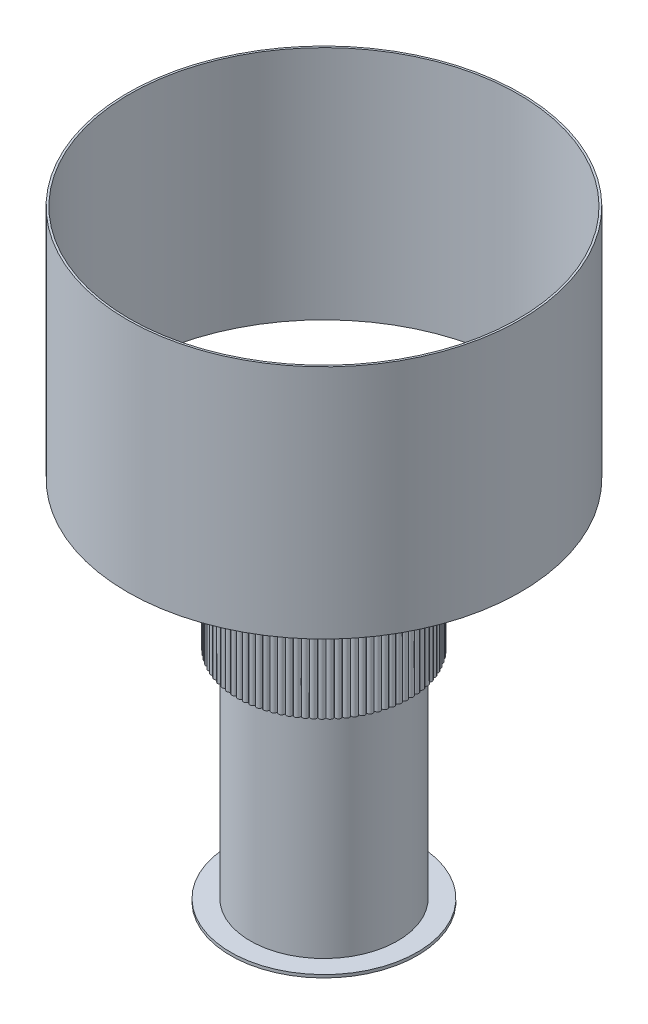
ISO-10303-21;
HEADER;
FILE_DESCRIPTION(('STEP AP214'),'2;1');
FILE_NAME('part.step','',(''),(''),'','','');
FILE_SCHEMA(('AUTOMOTIVE_DESIGN { 1 0 10303 214 1 1 1 1 }'));
ENDSEC;
DATA;
#1=APPLICATION_CONTEXT('core data for automotive mechanical design processes');
#2=APPLICATION_PROTOCOL_DEFINITION('international standard','automotive_design',2000,#1);
#3=PRODUCT_CONTEXT('',#1,'mechanical');
#4=PRODUCT('Part','Part','',(#3));
#5=PRODUCT_RELATED_PRODUCT_CATEGORY('part','',(#4));
#6=PRODUCT_DEFINITION_FORMATION('','',#4);
#7=PRODUCT_DEFINITION_CONTEXT('part definition',#1,'design');
#8=PRODUCT_DEFINITION('design','',#6,#7);
#9=PRODUCT_DEFINITION_SHAPE('','',#8);
#10=(LENGTH_UNIT() NAMED_UNIT(*) SI_UNIT(.MILLI.,.METRE.));
#11=(NAMED_UNIT(*) PLANE_ANGLE_UNIT() SI_UNIT($,.RADIAN.));
#12=(NAMED_UNIT(*) SI_UNIT($,.STERADIAN.) SOLID_ANGLE_UNIT());
#13=UNCERTAINTY_MEASURE_WITH_UNIT(LENGTH_MEASURE(1.E-05),#10,'distance_accuracy_value','');
#14=(GEOMETRIC_REPRESENTATION_CONTEXT(3) GLOBAL_UNCERTAINTY_ASSIGNED_CONTEXT((#13)) GLOBAL_UNIT_ASSIGNED_CONTEXT((#10,
#11,#12)) REPRESENTATION_CONTEXT('',''));
#15=CARTESIAN_POINT('',(0.,0.,0.));
#16=DIRECTION('',(0.,0.,1.));
#17=DIRECTION('',(1.,0.,0.));
#18=AXIS2_PLACEMENT_3D('',#15,#16,#17);
#19=CARTESIAN_POINT('',(0.,102.,0.));
#20=DIRECTION('',(0.,-1.,0.));
#21=DIRECTION('',(0.,0.,-1.));
#22=AXIS2_PLACEMENT_3D('',#19,#20,#21);
#23=CYLINDRICAL_SURFACE('',#22,15.);
#24=CARTESIAN_POINT('',(0.,102.,0.));
#25=DIRECTION('',(0.,1.,0.));
#26=DIRECTION('',(0.,0.,1.));
#27=AXIS2_PLACEMENT_3D('',#24,#25,#26);
#28=CIRCLE('',#27,15.);
#29=CARTESIAN_POINT('',(0.,102.,15.));
#30=VERTEX_POINT('',#29);
#31=EDGE_CURVE('E13',#30,#30,#28,.T.);
#32=ORIENTED_EDGE('',*,*,#31,.F.);
#33=EDGE_LOOP('',(#32));
#34=FACE_BOUND('',#33,.T.);
#35=CARTESIAN_POINT('',(0.,100.,0.));
#36=DIRECTION('',(0.,1.,0.));
#37=DIRECTION('',(0.,0.,1.));
#38=AXIS2_PLACEMENT_3D('',#35,#36,#37);
#39=CIRCLE('',#38,15.);
#40=CARTESIAN_POINT('',(0.,100.,15.));
#41=VERTEX_POINT('',#40);
#42=EDGE_CURVE('E56',#41,#41,#39,.T.);
#43=ORIENTED_EDGE('',*,*,#42,.T.);
#44=EDGE_LOOP('',(#43));
#45=FACE_BOUND('',#44,.T.);
#46=ADVANCED_FACE('F53',(#34,#45),#23,.T.);
#47=CARTESIAN_POINT('',(0.,102.,0.));
#48=DIRECTION('',(0.,1.,0.));
#49=DIRECTION('',(0.,0.,1.));
#50=AXIS2_PLACEMENT_3D('',#47,#48,#49);
#51=PLANE('',#50);
#52=ORIENTED_EDGE('',*,*,#31,.T.);
#53=EDGE_LOOP('',(#52));
#54=FACE_BOUND('',#53,.T.);
#55=ADVANCED_FACE('F68',(#54),#51,.T.);
#56=CARTESIAN_POINT('',(0.,100.,0.));
#57=DIRECTION('',(0.,1.,0.));
#58=DIRECTION('',(0.,0.,1.));
#59=AXIS2_PLACEMENT_3D('',#56,#57,#58);
#60=PLANE('',#59);
#61=ORIENTED_EDGE('',*,*,#42,.F.);
#62=EDGE_LOOP('',(#61));
#63=FACE_BOUND('',#62,.T.);
#64=ADVANCED_FACE('F66',(#63),#60,.F.);
#65=CLOSED_SHELL('',(#46,#55,#64));
#66=MANIFOLD_SOLID_BREP('B2',#65);
#67=CARTESIAN_POINT('',(60.6217782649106,-228.,-35.0000000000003));
#68=DIRECTION('',(0.,1.,0.));
#69=DIRECTION('',(0.,0.,1.));
#70=AXIS2_PLACEMENT_3D('',#67,#68,#69);
#71=CYLINDRICAL_SURFACE('',#70,5.00000000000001);
#72=CARTESIAN_POINT('',(60.6217782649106,-227.,-35.0000000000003));
#73=DIRECTION('',(0.,-1.,0.));
#74=DIRECTION('',(0.,0.,-1.));
#75=AXIS2_PLACEMENT_3D('',#72,#73,#74);
#76=CIRCLE('',#75,5.00000000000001);
#77=CARTESIAN_POINT('',(60.6217782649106,-227.,-40.0000000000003));
#78=VERTEX_POINT('',#77);
#79=EDGE_CURVE('E52',#78,#78,#76,.F.);
#80=ORIENTED_EDGE('',*,*,#79,.T.);
#81=EDGE_LOOP('',(#80));
#82=FACE_BOUND('',#81,.T.);
#83=CARTESIAN_POINT('',(60.6217782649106,-223.,-35.0000000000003));
#84=DIRECTION('',(0.,-1.,0.));
#85=DIRECTION('',(0.,0.,-1.));
#86=AXIS2_PLACEMENT_3D('',#83,#84,#85);
#87=CIRCLE('',#86,5.00000000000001);
#88=CARTESIAN_POINT('',(60.6217782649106,-223.,-40.0000000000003));
#89=VERTEX_POINT('',#88);
#90=EDGE_CURVE('E112',#89,#89,#87,.T.);
#91=ORIENTED_EDGE('',*,*,#90,.T.);
#92=EDGE_LOOP('',(#91));
#93=FACE_BOUND('',#92,.T.);
#94=ADVANCED_FACE('F101',(#82,#93),#71,.T.);
#95=CARTESIAN_POINT('',(60.6217782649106,-228.,-35.0000000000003));
#96=DIRECTION('',(0.,-1.,0.));
#97=DIRECTION('',(0.,0.,-1.));
#98=AXIS2_PLACEMENT_3D('',#95,#96,#97);
#99=PLANE('',#98);
#100=CARTESIAN_POINT('',(60.6217782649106,-228.,-35.0000000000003));
#101=DIRECTION('',(0.,-1.,0.));
#102=DIRECTION('',(0.,0.,-1.));
#103=AXIS2_PLACEMENT_3D('',#100,#101,#102);
#104=CIRCLE('',#103,4.00000000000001);
#105=CARTESIAN_POINT('',(60.6217782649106,-228.,-39.0000000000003));
#106=VERTEX_POINT('',#105);
#107=EDGE_CURVE('E108',#106,#106,#104,.T.);
#108=ORIENTED_EDGE('',*,*,#107,.T.);
#109=EDGE_LOOP('',(#108));
#110=FACE_BOUND('',#109,.T.);
#111=ADVANCED_FACE('F122',(#110),#99,.T.);
#112=CARTESIAN_POINT('',(60.6217782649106,-223.,-35.0000000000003));
#113=DIRECTION('',(0.,-1.,0.));
#114=DIRECTION('',(0.,0.,-1.));
#115=AXIS2_PLACEMENT_3D('',#112,#113,#114);
#116=PLANE('',#115);
#117=ORIENTED_EDGE('',*,*,#90,.F.);
#118=EDGE_LOOP('',(#117));
#119=FACE_BOUND('',#118,.T.);
#120=ADVANCED_FACE('F120',(#119),#116,.F.);
#121=CARTESIAN_POINT('',(60.6217782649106,-227.,-35.0000000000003));
#122=DIRECTION('',(0.,-1.,0.));
#123=DIRECTION('',(0.,0.,-1.));
#124=AXIS2_PLACEMENT_3D('',#121,#122,#123);
#125=TOROIDAL_SURFACE('',#124,4.00000000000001,1.);
#126=ORIENTED_EDGE('',*,*,#79,.F.);
#127=EDGE_LOOP('',(#126));
#128=FACE_BOUND('',#127,.T.);
#129=ORIENTED_EDGE('',*,*,#107,.F.);
#130=EDGE_LOOP('',(#129));
#131=FACE_BOUND('',#130,.T.);
#132=ADVANCED_FACE('F103',(#128,#131),#125,.T.);
#133=CLOSED_SHELL('',(#94,#111,#120,#132));
#134=MANIFOLD_SOLID_BREP('B8',#133);
#135=CARTESIAN_POINT('',(-60.6217782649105,-228.,-35.0000000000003));
#136=DIRECTION('',(0.,1.,0.));
#137=DIRECTION('',(0.,0.,1.));
#138=AXIS2_PLACEMENT_3D('',#135,#136,#137);
#139=CYLINDRICAL_SURFACE('',#138,5.);
#140=CARTESIAN_POINT('',(-60.6217782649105,-227.,-35.0000000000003));
#141=DIRECTION('',(0.,-1.,0.));
#142=DIRECTION('',(0.,0.,-1.));
#143=AXIS2_PLACEMENT_3D('',#140,#141,#142);
#144=CIRCLE('',#143,5.);
#145=CARTESIAN_POINT('',(-60.6217782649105,-227.,-40.0000000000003));
#146=VERTEX_POINT('',#145);
#147=EDGE_CURVE('E100',#146,#146,#144,.F.);
#148=ORIENTED_EDGE('',*,*,#147,.T.);
#149=EDGE_LOOP('',(#148));
#150=FACE_BOUND('',#149,.T.);
#151=CARTESIAN_POINT('',(-60.6217782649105,-223.,-35.0000000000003));
#152=DIRECTION('',(0.,-1.,0.));
#153=DIRECTION('',(0.,0.,-1.));
#154=AXIS2_PLACEMENT_3D('',#151,#152,#153);
#155=CIRCLE('',#154,5.);
#156=CARTESIAN_POINT('',(-60.6217782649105,-223.,-40.0000000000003));
#157=VERTEX_POINT('',#156);
#158=EDGE_CURVE('E175',#157,#157,#155,.T.);
#159=ORIENTED_EDGE('',*,*,#158,.T.);
#160=EDGE_LOOP('',(#159));
#161=FACE_BOUND('',#160,.T.);
#162=ADVANCED_FACE('F164',(#150,#161),#139,.T.);
#163=CARTESIAN_POINT('',(-60.6217782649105,-228.,-35.0000000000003));
#164=DIRECTION('',(0.,-1.,0.));
#165=DIRECTION('',(0.,0.,-1.));
#166=AXIS2_PLACEMENT_3D('',#163,#164,#165);
#167=PLANE('',#166);
#168=CARTESIAN_POINT('',(-60.6217782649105,-228.,-35.0000000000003));
#169=DIRECTION('',(0.,-1.,0.));
#170=DIRECTION('',(0.,0.,-1.));
#171=AXIS2_PLACEMENT_3D('',#168,#169,#170);
#172=CIRCLE('',#171,4.);
#173=CARTESIAN_POINT('',(-60.6217782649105,-228.,-39.0000000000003));
#174=VERTEX_POINT('',#173);
#175=EDGE_CURVE('E171',#174,#174,#172,.T.);
#176=ORIENTED_EDGE('',*,*,#175,.T.);
#177=EDGE_LOOP('',(#176));
#178=FACE_BOUND('',#177,.T.);
#179=ADVANCED_FACE('F185',(#178),#167,.T.);
#180=CARTESIAN_POINT('',(-60.6217782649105,-223.,-35.0000000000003));
#181=DIRECTION('',(0.,-1.,0.));
#182=DIRECTION('',(0.,0.,-1.));
#183=AXIS2_PLACEMENT_3D('',#180,#181,#182);
#184=PLANE('',#183);
#185=ORIENTED_EDGE('',*,*,#158,.F.);
#186=EDGE_LOOP('',(#185));
#187=FACE_BOUND('',#186,.T.);
#188=ADVANCED_FACE('F183',(#187),#184,.F.);
#189=CARTESIAN_POINT('',(-60.6217782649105,-227.,-35.0000000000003));
#190=DIRECTION('',(0.,-1.,0.));
#191=DIRECTION('',(0.,0.,-1.));
#192=AXIS2_PLACEMENT_3D('',#189,#190,#191);
#193=TOROIDAL_SURFACE('',#192,4.,1.);
#194=ORIENTED_EDGE('',*,*,#147,.F.);
#195=EDGE_LOOP('',(#194));
#196=FACE_BOUND('',#195,.T.);
#197=ORIENTED_EDGE('',*,*,#175,.F.);
#198=EDGE_LOOP('',(#197));
#199=FACE_BOUND('',#198,.T.);
#200=ADVANCED_FACE('F166',(#196,#199),#193,.T.);
#201=CLOSED_SHELL('',(#162,#179,#188,#200));
#202=MANIFOLD_SOLID_BREP('B47',#201);
#203=CARTESIAN_POINT('',(0.,-228.,70.));
#204=DIRECTION('',(0.,1.,0.));
#205=DIRECTION('',(0.,0.,1.));
#206=AXIS2_PLACEMENT_3D('',#203,#204,#205);
#207=CYLINDRICAL_SURFACE('',#206,5.);
#208=CARTESIAN_POINT('',(0.,-227.,70.));
#209=DIRECTION('',(0.,-1.,0.));
#210=DIRECTION('',(0.,0.,-1.));
#211=AXIS2_PLACEMENT_3D('',#208,#209,#210);
#212=CIRCLE('',#211,5.);
#213=CARTESIAN_POINT('',(0.,-227.,65.));
#214=VERTEX_POINT('',#213);
#215=EDGE_CURVE('E163',#214,#214,#212,.F.);
#216=ORIENTED_EDGE('',*,*,#215,.T.);
#217=EDGE_LOOP('',(#216));
#218=FACE_BOUND('',#217,.T.);
#219=CARTESIAN_POINT('',(0.,-223.,70.));
#220=DIRECTION('',(0.,-1.,0.));
#221=DIRECTION('',(0.,0.,-1.));
#222=AXIS2_PLACEMENT_3D('',#219,#220,#221);
#223=CIRCLE('',#222,5.);
#224=CARTESIAN_POINT('',(0.,-223.,65.));
#225=VERTEX_POINT('',#224);
#226=EDGE_CURVE('E238',#225,#225,#223,.T.);
#227=ORIENTED_EDGE('',*,*,#226,.T.);
#228=EDGE_LOOP('',(#227));
#229=FACE_BOUND('',#228,.T.);
#230=ADVANCED_FACE('F227',(#218,#229),#207,.T.);
#231=CARTESIAN_POINT('',(0.,-228.,70.));
#232=DIRECTION('',(0.,-1.,0.));
#233=DIRECTION('',(0.,0.,-1.));
#234=AXIS2_PLACEMENT_3D('',#231,#232,#233);
#235=PLANE('',#234);
#236=CARTESIAN_POINT('',(0.,-228.,70.));
#237=DIRECTION('',(0.,-1.,0.));
#238=DIRECTION('',(0.,0.,-1.));
#239=AXIS2_PLACEMENT_3D('',#236,#237,#238);
#240=CIRCLE('',#239,4.);
#241=CARTESIAN_POINT('',(0.,-228.,66.));
#242=VERTEX_POINT('',#241);
#243=EDGE_CURVE('E234',#242,#242,#240,.T.);
#244=ORIENTED_EDGE('',*,*,#243,.T.);
#245=EDGE_LOOP('',(#244));
#246=FACE_BOUND('',#245,.T.);
#247=ADVANCED_FACE('F248',(#246),#235,.T.);
#248=CARTESIAN_POINT('',(0.,-223.,70.));
#249=DIRECTION('',(0.,-1.,0.));
#250=DIRECTION('',(0.,0.,-1.));
#251=AXIS2_PLACEMENT_3D('',#248,#249,#250);
#252=PLANE('',#251);
#253=ORIENTED_EDGE('',*,*,#226,.F.);
#254=EDGE_LOOP('',(#253));
#255=FACE_BOUND('',#254,.T.);
#256=ADVANCED_FACE('F246',(#255),#252,.F.);
#257=CARTESIAN_POINT('',(0.,-227.,70.));
#258=DIRECTION('',(0.,-1.,0.));
#259=DIRECTION('',(0.,0.,-1.));
#260=AXIS2_PLACEMENT_3D('',#257,#258,#259);
#261=TOROIDAL_SURFACE('',#260,4.,1.);
#262=ORIENTED_EDGE('',*,*,#215,.F.);
#263=EDGE_LOOP('',(#262));
#264=FACE_BOUND('',#263,.T.);
#265=ORIENTED_EDGE('',*,*,#243,.F.);
#266=EDGE_LOOP('',(#265));
#267=FACE_BOUND('',#266,.T.);
#268=ADVANCED_FACE('F229',(#264,#267),#261,.T.);
#269=CLOSED_SHELL('',(#230,#247,#256,#268));
#270=MANIFOLD_SOLID_BREP('B95',#269);
#271=CARTESIAN_POINT('',(0.,-223.,0.));
#272=DIRECTION('',(0.,1.,0.));
#273=DIRECTION('',(0.,0.,1.));
#274=AXIS2_PLACEMENT_3D('',#271,#272,#273);
#275=CYLINDRICAL_SURFACE('',#274,95.);
#276=CARTESIAN_POINT('',(0.,-223.,0.));
#277=DIRECTION('',(0.,-1.,0.));
#278=DIRECTION('',(0.,0.,-1.));
#279=AXIS2_PLACEMENT_3D('',#276,#277,#278);
#280=CIRCLE('',#279,95.);
#281=CARTESIAN_POINT('',(0.,-223.,-95.));
#282=VERTEX_POINT('',#281);
#283=EDGE_CURVE('E226',#282,#282,#280,.T.);
#284=ORIENTED_EDGE('',*,*,#283,.F.);
#285=EDGE_LOOP('',(#284));
#286=FACE_BOUND('',#285,.T.);
#287=CARTESIAN_POINT('',(0.,-220.,0.));
#288=DIRECTION('',(0.,-1.,0.));
#289=DIRECTION('',(0.,0.,-1.));
#290=AXIS2_PLACEMENT_3D('',#287,#288,#289);
#291=CIRCLE('',#290,95.);
#292=CARTESIAN_POINT('',(0.,-220.,-95.));
#293=VERTEX_POINT('',#292);
#294=EDGE_CURVE('E293',#293,#293,#291,.T.);
#295=ORIENTED_EDGE('',*,*,#294,.T.);
#296=EDGE_LOOP('',(#295));
#297=FACE_BOUND('',#296,.T.);
#298=ADVANCED_FACE('F290',(#286,#297),#275,.T.);
#299=CARTESIAN_POINT('',(0.,-223.,0.));
#300=DIRECTION('',(0.,-1.,0.));
#301=DIRECTION('',(0.,0.,-1.));
#302=AXIS2_PLACEMENT_3D('',#299,#300,#301);
#303=PLANE('',#302);
#304=ORIENTED_EDGE('',*,*,#283,.T.);
#305=EDGE_LOOP('',(#304));
#306=FACE_BOUND('',#305,.T.);
#307=ADVANCED_FACE('F305',(#306),#303,.T.);
#308=CARTESIAN_POINT('',(0.,-220.,0.));
#309=DIRECTION('',(0.,-1.,0.));
#310=DIRECTION('',(0.,0.,-1.));
#311=AXIS2_PLACEMENT_3D('',#308,#309,#310);
#312=PLANE('',#311);
#313=ORIENTED_EDGE('',*,*,#294,.F.);
#314=EDGE_LOOP('',(#313));
#315=FACE_BOUND('',#314,.T.);
#316=ADVANCED_FACE('F303',(#315),#312,.F.);
#317=CLOSED_SHELL('',(#298,#307,#316));
#318=MANIFOLD_SOLID_BREP('B158',#317);
#319=CARTESIAN_POINT('',(0.,390.,0.));
#320=DIRECTION('',(0.,1.,0.));
#321=DIRECTION('',(0.,0.,1.));
#322=AXIS2_PLACEMENT_3D('',#319,#320,#321);
#323=PLANE('',#322);
#324=CARTESIAN_POINT('',(0.,390.,0.));
#325=DIRECTION('',(0.,1.,0.));
#326=DIRECTION('',(0.,0.,1.));
#327=AXIS2_PLACEMENT_3D('',#324,#325,#326);
#328=CIRCLE('',#327,200.);
#329=CARTESIAN_POINT('',(0.,390.,200.));
#330=VERTEX_POINT('',#329);
#331=EDGE_CURVE('E289',#330,#330,#328,.T.);
#332=ORIENTED_EDGE('',*,*,#331,.T.);
#333=EDGE_LOOP('',(#332));
#334=FACE_BOUND('',#333,.T.);
#335=CARTESIAN_POINT('',(0.,390.,0.));
#336=DIRECTION('',(0.,1.,0.));
#337=DIRECTION('',(0.,0.,1.));
#338=AXIS2_PLACEMENT_3D('',#335,#336,#337);
#339=CIRCLE('',#338,198.);
#340=CARTESIAN_POINT('',(0.,390.,198.));
#341=VERTEX_POINT('',#340);
#342=EDGE_CURVE('E351',#341,#341,#339,.T.);
#343=ORIENTED_EDGE('',*,*,#342,.F.);
#344=EDGE_LOOP('',(#343));
#345=FACE_BOUND('',#344,.T.);
#346=ADVANCED_FACE('F340',(#334,#345),#323,.T.);
#347=CARTESIAN_POINT('',(0.,150.,0.));
#348=DIRECTION('',(0.,1.,0.));
#349=DIRECTION('',(0.,0.,1.));
#350=AXIS2_PLACEMENT_3D('',#347,#348,#349);
#351=PLANE('',#350);
#352=CARTESIAN_POINT('',(0.,150.,0.));
#353=DIRECTION('',(0.,1.,0.));
#354=DIRECTION('',(0.,0.,1.));
#355=AXIS2_PLACEMENT_3D('',#352,#353,#354);
#356=CIRCLE('',#355,200.);
#357=CARTESIAN_POINT('',(0.,150.,200.));
#358=VERTEX_POINT('',#357);
#359=EDGE_CURVE('E344',#358,#358,#356,.T.);
#360=ORIENTED_EDGE('',*,*,#359,.F.);
#361=EDGE_LOOP('',(#360));
#362=FACE_BOUND('',#361,.T.);
#363=CARTESIAN_POINT('',(0.,150.,0.));
#364=DIRECTION('',(0.,1.,0.));
#365=DIRECTION('',(0.,0.,1.));
#366=AXIS2_PLACEMENT_3D('',#363,#364,#365);
#367=CIRCLE('',#366,198.);
#368=CARTESIAN_POINT('',(0.,150.,198.));
#369=VERTEX_POINT('',#368);
#370=EDGE_CURVE('E353',#369,#369,#367,.T.);
#371=ORIENTED_EDGE('',*,*,#370,.T.);
#372=EDGE_LOOP('',(#371));
#373=FACE_BOUND('',#372,.T.);
#374=ADVANCED_FACE('F363',(#362,#373),#351,.F.);
#375=CARTESIAN_POINT('',(0.,390.,0.));
#376=DIRECTION('',(0.,-1.,0.));
#377=DIRECTION('',(0.,0.,-1.));
#378=AXIS2_PLACEMENT_3D('',#375,#376,#377);
#379=CYLINDRICAL_SURFACE('',#378,200.);
#380=ORIENTED_EDGE('',*,*,#331,.F.);
#381=EDGE_LOOP('',(#380));
#382=FACE_BOUND('',#381,.T.);
#383=ORIENTED_EDGE('',*,*,#359,.T.);
#384=EDGE_LOOP('',(#383));
#385=FACE_BOUND('',#384,.T.);
#386=ADVANCED_FACE('F342',(#382,#385),#379,.T.);
#387=CARTESIAN_POINT('',(0.,390.,0.));
#388=DIRECTION('',(0.,-1.,0.));
#389=DIRECTION('',(0.,0.,-1.));
#390=AXIS2_PLACEMENT_3D('',#387,#388,#389);
#391=CYLINDRICAL_SURFACE('',#390,198.);
#392=ORIENTED_EDGE('',*,*,#342,.T.);
#393=EDGE_LOOP('',(#392));
#394=FACE_BOUND('',#393,.T.);
#395=ORIENTED_EDGE('',*,*,#370,.F.);
#396=EDGE_LOOP('',(#395));
#397=FACE_BOUND('',#396,.T.);
#398=ADVANCED_FACE('F359',(#394,#397),#391,.F.);
#399=CLOSED_SHELL('',(#346,#374,#386,#398));
#400=MANIFOLD_SOLID_BREP('B221',#399);
#401=CARTESIAN_POINT('',(0.,150.,0.));
#402=DIRECTION('',(0.,-1.,0.));
#403=DIRECTION('',(0.,0.,-1.));
#404=AXIS2_PLACEMENT_3D('',#401,#402,#403);
#405=CYLINDRICAL_SURFACE('',#404,6.);
#406=CARTESIAN_POINT('',(0.,150.,0.));
#407=DIRECTION('',(0.,1.,0.));
#408=DIRECTION('',(0.,0.,1.));
#409=AXIS2_PLACEMENT_3D('',#406,#407,#408);
#410=CIRCLE('',#409,6.);
#411=CARTESIAN_POINT('',(0.,150.,6.));
#412=VERTEX_POINT('',#411);
#413=EDGE_CURVE('E339',#412,#412,#410,.T.);
#414=ORIENTED_EDGE('',*,*,#413,.F.);
#415=EDGE_LOOP('',(#414));
#416=FACE_BOUND('',#415,.T.);
#417=CARTESIAN_POINT('',(0.,100.,0.));
#418=DIRECTION('',(0.,1.,0.));
#419=DIRECTION('',(0.,0.,1.));
#420=AXIS2_PLACEMENT_3D('',#417,#418,#419);
#421=CIRCLE('',#420,6.);
#422=CARTESIAN_POINT('',(0.,100.,6.));
#423=VERTEX_POINT('',#422);
#424=EDGE_CURVE('E420',#423,#423,#421,.T.);
#425=ORIENTED_EDGE('',*,*,#424,.T.);
#426=EDGE_LOOP('',(#425));
#427=FACE_BOUND('',#426,.T.);
#428=ADVANCED_FACE('F417',(#416,#427),#405,.T.);
#429=CARTESIAN_POINT('',(0.,150.,0.));
#430=DIRECTION('',(0.,1.,0.));
#431=DIRECTION('',(0.,0.,1.));
#432=AXIS2_PLACEMENT_3D('',#429,#430,#431);
#433=PLANE('',#432);
#434=ORIENTED_EDGE('',*,*,#413,.T.);
#435=EDGE_LOOP('',(#434));
#436=FACE_BOUND('',#435,.T.);
#437=ADVANCED_FACE('F432',(#436),#433,.T.);
#438=CARTESIAN_POINT('',(0.,100.,0.));
#439=DIRECTION('',(0.,1.,0.));
#440=DIRECTION('',(0.,0.,1.));
#441=AXIS2_PLACEMENT_3D('',#438,#439,#440);
#442=PLANE('',#441);
#443=ORIENTED_EDGE('',*,*,#424,.F.);
#444=EDGE_LOOP('',(#443));
#445=FACE_BOUND('',#444,.T.);
#446=ADVANCED_FACE('F430',(#445),#442,.F.);
#447=CLOSED_SHELL('',(#428,#437,#446));
#448=MANIFOLD_SOLID_BREP('B284',#447);
#449=CARTESIAN_POINT('',(0.,-220.,0.));
#450=DIRECTION('',(0.,-1.,0.));
#451=DIRECTION('',(0.,0.,-1.));
#452=AXIS2_PLACEMENT_3D('',#449,#450,#451);
#453=PLANE('',#452);
#454=CARTESIAN_POINT('',(0.,-220.,0.));
#455=DIRECTION('',(0.,-1.,0.));
#456=DIRECTION('',(0.,0.,-1.));
#457=AXIS2_PLACEMENT_3D('',#454,#455,#456);
#458=CIRCLE('',#457,75.);
#459=CARTESIAN_POINT('',(0.,-220.,-75.));
#460=VERTEX_POINT('',#459);
#461=EDGE_CURVE('E416',#460,#460,#458,.T.);
#462=ORIENTED_EDGE('',*,*,#461,.T.);
#463=EDGE_LOOP('',(#462));
#464=FACE_BOUND('',#463,.T.);
#465=CARTESIAN_POINT('',(0.,-220.,0.));
#466=DIRECTION('',(0.,-1.,0.));
#467=DIRECTION('',(0.,0.,-1.));
#468=AXIS2_PLACEMENT_3D('',#465,#466,#467);
#469=CIRCLE('',#468,71.);
#470=CARTESIAN_POINT('',(0.,-220.,-71.));
#471=VERTEX_POINT('',#470);
#472=EDGE_CURVE('E485',#471,#471,#469,.T.);
#473=ORIENTED_EDGE('',*,*,#472,.F.);
#474=EDGE_LOOP('',(#473));
#475=FACE_BOUND('',#474,.T.);
#476=ADVANCED_FACE('F474',(#464,#475),#453,.T.);
#477=CARTESIAN_POINT('',(0.,90.,0.));
#478=DIRECTION('',(0.,-1.,0.));
#479=DIRECTION('',(0.,0.,-1.));
#480=AXIS2_PLACEMENT_3D('',#477,#478,#479);
#481=PLANE('',#480);
#482=CARTESIAN_POINT('',(0.,90.,0.));
#483=DIRECTION('',(0.,-1.,0.));
#484=DIRECTION('',(0.,0.,-1.));
#485=AXIS2_PLACEMENT_3D('',#482,#483,#484);
#486=CIRCLE('',#485,75.);
#487=CARTESIAN_POINT('',(0.,90.,-75.));
#488=VERTEX_POINT('',#487);
#489=EDGE_CURVE('E478',#488,#488,#486,.T.);
#490=ORIENTED_EDGE('',*,*,#489,.F.);
#491=EDGE_LOOP('',(#490));
#492=FACE_BOUND('',#491,.T.);
#493=CARTESIAN_POINT('',(0.,90.,0.));
#494=DIRECTION('',(0.,-1.,0.));
#495=DIRECTION('',(0.,0.,-1.));
#496=AXIS2_PLACEMENT_3D('',#493,#494,#495);
#497=CIRCLE('',#496,71.);
#498=CARTESIAN_POINT('',(0.,90.,-71.));
#499=VERTEX_POINT('',#498);
#500=EDGE_CURVE('E487',#499,#499,#497,.T.);
#501=ORIENTED_EDGE('',*,*,#500,.T.);
#502=EDGE_LOOP('',(#501));
#503=FACE_BOUND('',#502,.T.);
#504=ADVANCED_FACE('F497',(#492,#503),#481,.F.);
#505=CARTESIAN_POINT('',(0.,-220.,0.));
#506=DIRECTION('',(0.,1.,0.));
#507=DIRECTION('',(0.,0.,1.));
#508=AXIS2_PLACEMENT_3D('',#505,#506,#507);
#509=CYLINDRICAL_SURFACE('',#508,75.);
#510=ORIENTED_EDGE('',*,*,#461,.F.);
#511=EDGE_LOOP('',(#510));
#512=FACE_BOUND('',#511,.T.);
#513=ORIENTED_EDGE('',*,*,#489,.T.);
#514=EDGE_LOOP('',(#513));
#515=FACE_BOUND('',#514,.T.);
#516=ADVANCED_FACE('F476',(#512,#515),#509,.T.);
#517=CARTESIAN_POINT('',(0.,-220.,0.));
#518=DIRECTION('',(0.,1.,0.));
#519=DIRECTION('',(0.,0.,1.));
#520=AXIS2_PLACEMENT_3D('',#517,#518,#519);
#521=CYLINDRICAL_SURFACE('',#520,71.);
#522=ORIENTED_EDGE('',*,*,#472,.T.);
#523=EDGE_LOOP('',(#522));
#524=FACE_BOUND('',#523,.T.);
#525=ORIENTED_EDGE('',*,*,#500,.F.);
#526=EDGE_LOOP('',(#525));
#527=FACE_BOUND('',#526,.T.);
#528=ADVANCED_FACE('F493',(#524,#527),#521,.F.);
#529=CLOSED_SHELL('',(#476,#504,#516,#528));
#530=MANIFOLD_SOLID_BREP('B334',#529);
#531=CARTESIAN_POINT('',(11.8297135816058,100.,-84.1727858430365));
#532=DIRECTION('',(0.,-1.,0.));
#533=DIRECTION('',(0.,0.,-1.));
#534=AXIS2_PLACEMENT_3D('',#531,#532,#533);
#535=CYLINDRICAL_SURFACE('',#534,2.99999999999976);
#536=CARTESIAN_POINT('',(11.8297135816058,0.,-84.1727858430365));
#537=DIRECTION('',(0.,1.,0.));
#538=DIRECTION('',(0.,0.,1.));
#539=AXIS2_PLACEMENT_3D('',#536,#537,#538);
#540=CIRCLE('',#539,2.99999999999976);
#541=CARTESIAN_POINT('',(14.8287870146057,0.,-84.0982302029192));
#542=VERTEX_POINT('',#541);
#543=CARTESIAN_POINT('',(8.92626884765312,0.,-84.9277750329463));
#544=VERTEX_POINT('',#543);
#545=EDGE_CURVE('E1130',#542,#544,#540,.T.);
#546=ORIENTED_EDGE('',*,*,#545,.T.);
#547=DIRECTION('',(0.,-1.,0.));
#548=VECTOR('',#547,1.);
#549=CARTESIAN_POINT('',(8.92626884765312,100.,-84.9277750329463));
#550=LINE('',#549,#548);
#551=CARTESIAN_POINT('',(8.92626884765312,100.,-84.9277750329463));
#552=VERTEX_POINT('',#551);
#553=EDGE_CURVE('E472',#552,#544,#550,.T.);
#554=ORIENTED_EDGE('',*,*,#553,.F.);
#555=CARTESIAN_POINT('',(11.8297135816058,100.,-84.1727858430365));
#556=DIRECTION('',(0.,1.,0.));
#557=DIRECTION('',(0.,0.,1.));
#558=AXIS2_PLACEMENT_3D('',#555,#556,#557);
#559=CIRCLE('',#558,2.99999999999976);
#560=CARTESIAN_POINT('',(14.8287870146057,100.,-84.0982302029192));
#561=VERTEX_POINT('',#560);
#562=EDGE_CURVE('E1309',#561,#552,#559,.T.);
#563=ORIENTED_EDGE('',*,*,#562,.F.);
#564=DIRECTION('',(0.,-1.,0.));
#565=VECTOR('',#564,1.);
#566=CARTESIAN_POINT('',(14.8287870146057,100.,-84.0982302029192));
#567=LINE('',#566,#565);
#568=EDGE_CURVE('E1126',#561,#542,#567,.T.);
#569=ORIENTED_EDGE('',*,*,#568,.T.);
#570=EDGE_LOOP('',(#546,#554,#563,#569));
#571=FACE_BOUND('',#570,.T.);
#572=ADVANCED_FACE('F541',(#571),#535,.T.);
#573=CARTESIAN_POINT('',(5.92930026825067,100.,-84.7929442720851));
#574=DIRECTION('',(0.,-1.,0.));
#575=DIRECTION('',(0.,0.,-1.));
#576=AXIS2_PLACEMENT_3D('',#573,#574,#575);
#577=CYLINDRICAL_SURFACE('',#576,3.);
#578=CARTESIAN_POINT('',(5.92930026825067,0.,-84.7929442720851));
#579=DIRECTION('',(0.,1.,0.));
#580=DIRECTION('',(0.,0.,1.));
#581=AXIS2_PLACEMENT_3D('',#578,#579,#580);
#582=CIRCLE('',#581,3.);
#583=CARTESIAN_POINT('',(2.98026279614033,0.,-85.3435602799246));
#584=VERTEX_POINT('',#583);
#585=EDGE_CURVE('E1133',#544,#584,#582,.T.);
#586=ORIENTED_EDGE('',*,*,#585,.T.);
#587=DIRECTION('',(0.,-1.,0.));
#588=VECTOR('',#587,1.);
#589=CARTESIAN_POINT('',(2.98026279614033,100.,-85.3435602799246));
#590=LINE('',#589,#588);
#591=CARTESIAN_POINT('',(2.98026279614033,100.,-85.3435602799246));
#592=VERTEX_POINT('',#591);
#593=EDGE_CURVE('E550',#592,#584,#590,.T.);
#594=ORIENTED_EDGE('',*,*,#593,.F.);
#595=CARTESIAN_POINT('',(5.92930026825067,100.,-84.7929442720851));
#596=DIRECTION('',(0.,1.,0.));
#597=DIRECTION('',(0.,0.,1.));
#598=AXIS2_PLACEMENT_3D('',#595,#596,#597);
#599=CIRCLE('',#598,3.);
#600=EDGE_CURVE('E847',#552,#592,#599,.T.);
#601=ORIENTED_EDGE('',*,*,#600,.F.);
#602=ORIENTED_EDGE('',*,*,#553,.T.);
#603=EDGE_LOOP('',(#586,#594,#601,#602));
#604=FACE_BOUND('',#603,.T.);
#605=ADVANCED_FACE('F1779',(#604),#577,.T.);
#606=CARTESIAN_POINT('',(0.,100.,-85.));
#607=DIRECTION('',(0.,-1.,0.));
#608=DIRECTION('',(0.,0.,-1.));
#609=AXIS2_PLACEMENT_3D('',#606,#607,#608);
#610=CYLINDRICAL_SURFACE('',#609,3.);
#611=CARTESIAN_POINT('',(0.,0.,-85.));
#612=DIRECTION('',(0.,1.,0.));
#613=DIRECTION('',(0.,0.,1.));
#614=AXIS2_PLACEMENT_3D('',#611,#612,#613);
#615=CIRCLE('',#614,3.);
#616=CARTESIAN_POINT('',(-2.98026279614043,0.,-85.3435602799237));
#617=VERTEX_POINT('',#616);
#618=EDGE_CURVE('E1136',#584,#617,#615,.T.);
#619=ORIENTED_EDGE('',*,*,#618,.T.);
#620=DIRECTION('',(0.,-1.,0.));
#621=VECTOR('',#620,1.);
#622=CARTESIAN_POINT('',(-2.98026279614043,100.,-85.3435602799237));
#623=LINE('',#622,#621);
#624=CARTESIAN_POINT('',(-2.98026279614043,100.,-85.3435602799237));
#625=VERTEX_POINT('',#624);
#626=EDGE_CURVE('E1562',#625,#617,#623,.T.);
#627=ORIENTED_EDGE('',*,*,#626,.F.);
#628=CARTESIAN_POINT('',(0.,100.,-85.));
#629=DIRECTION('',(0.,1.,0.));
#630=DIRECTION('',(0.,0.,1.));
#631=AXIS2_PLACEMENT_3D('',#628,#629,#630);
#632=CIRCLE('',#631,3.);
#633=EDGE_CURVE('E1571',#592,#625,#632,.T.);
#634=ORIENTED_EDGE('',*,*,#633,.F.);
#635=ORIENTED_EDGE('',*,*,#593,.T.);
#636=EDGE_LOOP('',(#619,#627,#634,#635));
#637=FACE_BOUND('',#636,.T.);
#638=ADVANCED_FACE('F1569',(#637),#610,.T.);
#639=CARTESIAN_POINT('',(-5.92930026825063,100.,-84.7929442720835));
#640=DIRECTION('',(0.,-1.,0.));
#641=DIRECTION('',(0.,0.,-1.));
#642=AXIS2_PLACEMENT_3D('',#639,#640,#641);
#643=CYLINDRICAL_SURFACE('',#642,3.);
#644=CARTESIAN_POINT('',(-5.92930026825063,0.,-84.7929442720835));
#645=DIRECTION('',(0.,1.,0.));
#646=DIRECTION('',(0.,0.,1.));
#647=AXIS2_PLACEMENT_3D('',#644,#645,#646);
#648=CIRCLE('',#647,3.);
#649=CARTESIAN_POINT('',(-8.92626884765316,0.,-84.9277750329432));
#650=VERTEX_POINT('',#649);
#651=EDGE_CURVE('E1138',#617,#650,#648,.T.);
#652=ORIENTED_EDGE('',*,*,#651,.T.);
#653=DIRECTION('',(0.,-1.,0.));
#654=VECTOR('',#653,1.);
#655=CARTESIAN_POINT('',(-8.92626884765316,100.,-84.9277750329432));
#656=LINE('',#655,#654);
#657=CARTESIAN_POINT('',(-8.92626884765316,100.,-84.9277750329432));
#658=VERTEX_POINT('',#657);
#659=EDGE_CURVE('E1559',#658,#650,#656,.T.);
#660=ORIENTED_EDGE('',*,*,#659,.F.);
#661=CARTESIAN_POINT('',(-5.92930026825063,100.,-84.7929442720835));
#662=DIRECTION('',(0.,1.,0.));
#663=DIRECTION('',(0.,0.,1.));
#664=AXIS2_PLACEMENT_3D('',#661,#662,#663);
#665=CIRCLE('',#664,3.);
#666=EDGE_CURVE('E1589',#625,#658,#665,.T.);
#667=ORIENTED_EDGE('',*,*,#666,.F.);
#668=ORIENTED_EDGE('',*,*,#626,.T.);
#669=EDGE_LOOP('',(#652,#660,#667,#668));
#670=FACE_BOUND('',#669,.T.);
#671=ADVANCED_FACE('F1580',(#670),#643,.T.);
#672=CARTESIAN_POINT('',(-11.8297135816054,100.,-84.1727858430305));
#673=DIRECTION('',(0.,-1.,0.));
#674=DIRECTION('',(0.,0.,-1.));
#675=AXIS2_PLACEMENT_3D('',#672,#673,#674);
#676=CYLINDRICAL_SURFACE('',#675,3.);
#677=CARTESIAN_POINT('',(-11.8297135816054,0.,-84.1727858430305));
#678=DIRECTION('',(0.,1.,0.));
#679=DIRECTION('',(0.,0.,1.));
#680=AXIS2_PLACEMENT_3D('',#677,#678,#679);
#681=CIRCLE('',#680,3.);
#682=CARTESIAN_POINT('',(-14.8287870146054,0.,-84.0982302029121));
#683=VERTEX_POINT('',#682);
#684=EDGE_CURVE('E1140',#650,#683,#681,.T.);
#685=ORIENTED_EDGE('',*,*,#684,.T.);
#686=DIRECTION('',(0.,-1.,0.));
#687=VECTOR('',#686,1.);
#688=CARTESIAN_POINT('',(-14.8287870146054,100.,-84.0982302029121));
#689=LINE('',#688,#687);
#690=CARTESIAN_POINT('',(-14.8287870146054,100.,-84.0982302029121));
#691=VERTEX_POINT('',#690);
#692=EDGE_CURVE('E1556',#691,#683,#689,.T.);
#693=ORIENTED_EDGE('',*,*,#692,.F.);
#694=CARTESIAN_POINT('',(-11.8297135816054,100.,-84.1727858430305));
#695=DIRECTION('',(0.,1.,0.));
#696=DIRECTION('',(0.,0.,1.));
#697=AXIS2_PLACEMENT_3D('',#694,#695,#696);
#698=CIRCLE('',#697,3.);
#699=EDGE_CURVE('E1586',#658,#691,#698,.T.);
#700=ORIENTED_EDGE('',*,*,#699,.F.);
#701=ORIENTED_EDGE('',*,*,#659,.T.);
#702=EDGE_LOOP('',(#685,#693,#700,#701));
#703=FACE_BOUND('',#702,.T.);
#704=ADVANCED_FACE('F1584',(#703),#676,.T.);
#705=CARTESIAN_POINT('',(-17.6724937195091,100.,-83.142546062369));
#706=DIRECTION('',(0.,-1.,0.));
#707=DIRECTION('',(0.,0.,-1.));
#708=AXIS2_PLACEMENT_3D('',#705,#706,#707);
#709=CYLINDRICAL_SURFACE('',#708,3.);
#710=CARTESIAN_POINT('',(-17.6724937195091,0.,-83.142546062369));
#711=DIRECTION('',(0.,1.,0.));
#712=DIRECTION('',(0.,0.,1.));
#713=AXIS2_PLACEMENT_3D('',#710,#711,#712);
#714=CIRCLE('',#713,3.);
#715=CARTESIAN_POINT('',(-20.6590608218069,0.,-82.8589672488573));
#716=VERTEX_POINT('',#715);
#717=EDGE_CURVE('E1142',#683,#716,#714,.T.);
#718=ORIENTED_EDGE('',*,*,#717,.T.);
#719=DIRECTION('',(0.,-1.,0.));
#720=VECTOR('',#719,1.);
#721=CARTESIAN_POINT('',(-20.6590608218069,100.,-82.8589672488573));
#722=LINE('',#721,#720);
#723=CARTESIAN_POINT('',(-20.6590608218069,100.,-82.8589672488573));
#724=VERTEX_POINT('',#723);
#725=EDGE_CURVE('E1553',#724,#716,#722,.T.);
#726=ORIENTED_EDGE('',*,*,#725,.F.);
#727=CARTESIAN_POINT('',(-17.6724937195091,100.,-83.142546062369));
#728=DIRECTION('',(0.,1.,0.));
#729=DIRECTION('',(0.,0.,1.));
#730=AXIS2_PLACEMENT_3D('',#727,#728,#729);
#731=CIRCLE('',#730,3.);
#732=EDGE_CURVE('E1588',#691,#724,#731,.T.);
#733=ORIENTED_EDGE('',*,*,#732,.F.);
#734=ORIENTED_EDGE('',*,*,#692,.T.);
#735=EDGE_LOOP('',(#718,#726,#733,#734));
#736=FACE_BOUND('',#735,.T.);
#737=ADVANCED_FACE('F1792',(#736),#709,.T.);
#738=CARTESIAN_POINT('',(-23.4291752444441,100.,-81.7072441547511));
#739=DIRECTION('',(0.,-1.,0.));
#740=DIRECTION('',(0.,0.,-1.));
#741=AXIS2_PLACEMENT_3D('',#738,#739,#740);
#742=CYLINDRICAL_SURFACE('',#741,3.);
#743=CARTESIAN_POINT('',(-23.4291752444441,0.,-81.7072441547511));
#744=DIRECTION('',(0.,1.,0.));
#745=DIRECTION('',(0.,0.,1.));
#746=AXIS2_PLACEMENT_3D('',#743,#744,#745);
#747=CIRCLE('',#746,3.);
#748=CARTESIAN_POINT('',(-26.3886857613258,0.,-81.2160237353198));
#749=VERTEX_POINT('',#748);
#750=EDGE_CURVE('E1144',#716,#749,#747,.T.);
#751=ORIENTED_EDGE('',*,*,#750,.T.);
#752=DIRECTION('',(0.,-1.,0.));
#753=VECTOR('',#752,1.);
#754=CARTESIAN_POINT('',(-26.3886857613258,100.,-81.2160237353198));
#755=LINE('',#754,#753);
#756=CARTESIAN_POINT('',(-26.3886857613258,100.,-81.2160237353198));
#757=VERTEX_POINT('',#756);
#758=EDGE_CURVE('E1550',#757,#749,#755,.T.);
#759=ORIENTED_EDGE('',*,*,#758,.F.);
#760=CARTESIAN_POINT('',(-23.4291752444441,100.,-81.7072441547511));
#761=DIRECTION('',(0.,1.,0.));
#762=DIRECTION('',(0.,0.,1.));
#763=AXIS2_PLACEMENT_3D('',#760,#761,#762);
#764=CIRCLE('',#763,3.);
#765=EDGE_CURVE('E1591',#724,#757,#764,.T.);
#766=ORIENTED_EDGE('',*,*,#765,.F.);
#767=ORIENTED_EDGE('',*,*,#725,.T.);
#768=EDGE_LOOP('',(#751,#759,#766,#767));
#769=FACE_BOUND('',#768,.T.);
#770=ADVANCED_FACE('F1795',(#769),#742,.T.);
#771=CARTESIAN_POINT('',(-29.0717121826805,100.,-79.8738727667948));
#772=DIRECTION('',(0.,-1.,0.));
#773=DIRECTION('',(0.,0.,-1.));
#774=AXIS2_PLACEMENT_3D('',#771,#772,#773);
#775=CYLINDRICAL_SURFACE('',#774,3.);
#776=CARTESIAN_POINT('',(-29.0717121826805,0.,-79.8738727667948));
#777=DIRECTION('',(0.,1.,0.));
#778=DIRECTION('',(0.,0.,1.));
#779=AXIS2_PLACEMENT_3D('',#776,#777,#778);
#780=CIRCLE('',#779,3.);
#781=CARTESIAN_POINT('',(-31.989747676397,0.,-79.1774039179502));
#782=VERTEX_POINT('',#781);
#783=EDGE_CURVE('E1146',#749,#782,#780,.T.);
#784=ORIENTED_EDGE('',*,*,#783,.T.);
#785=DIRECTION('',(0.,-1.,0.));
#786=VECTOR('',#785,1.);
#787=CARTESIAN_POINT('',(-31.989747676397,100.,-79.1774039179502));
#788=LINE('',#787,#786);
#789=CARTESIAN_POINT('',(-31.989747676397,100.,-79.1774039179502));
#790=VERTEX_POINT('',#789);
#791=EDGE_CURVE('E1547',#790,#782,#788,.T.);
#792=ORIENTED_EDGE('',*,*,#791,.F.);
#793=CARTESIAN_POINT('',(-29.0717121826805,100.,-79.8738727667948));
#794=DIRECTION('',(0.,1.,0.));
#795=DIRECTION('',(0.,0.,1.));
#796=AXIS2_PLACEMENT_3D('',#793,#794,#795);
#797=CIRCLE('',#796,3.);
#798=EDGE_CURVE('E1597',#757,#790,#797,.T.);
#799=ORIENTED_EDGE('',*,*,#798,.F.);
#800=ORIENTED_EDGE('',*,*,#758,.T.);
#801=EDGE_LOOP('',(#784,#792,#799,#800));
#802=FACE_BOUND('',#801,.T.);
#803=ADVANCED_FACE('F1799',(#802),#775,.T.);
#804=CARTESIAN_POINT('',(-34.5726146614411,100.,-77.6513638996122));
#805=DIRECTION('',(0.,-1.,0.));
#806=DIRECTION('',(0.,0.,-1.));
#807=AXIS2_PLACEMENT_3D('',#804,#805,#806);
#808=CYLINDRICAL_SURFACE('',#807,3.);
#809=CARTESIAN_POINT('',(-34.5726146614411,0.,-77.6513638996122));
#810=DIRECTION('',(0.,1.,0.));
#811=DIRECTION('',(0.,0.,1.));
#812=AXIS2_PLACEMENT_3D('',#809,#810,#811);
#813=CIRCLE('',#812,3.);
#814=CARTESIAN_POINT('',(-37.4349587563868,0.,-76.7530397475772));
#815=VERTEX_POINT('',#814);
#816=EDGE_CURVE('E1148',#782,#815,#813,.T.);
#817=ORIENTED_EDGE('',*,*,#816,.T.);
#818=DIRECTION('',(0.,-1.,0.));
#819=VECTOR('',#818,1.);
#820=CARTESIAN_POINT('',(-37.4349587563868,100.,-76.7530397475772));
#821=LINE('',#820,#819);
#822=CARTESIAN_POINT('',(-37.4349587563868,100.,-76.7530397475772));
#823=VERTEX_POINT('',#822);
#824=EDGE_CURVE('E1544',#823,#815,#821,.T.);
#825=ORIENTED_EDGE('',*,*,#824,.F.);
#826=CARTESIAN_POINT('',(-34.5726146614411,100.,-77.6513638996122));
#827=DIRECTION('',(0.,1.,0.));
#828=DIRECTION('',(0.,0.,1.));
#829=AXIS2_PLACEMENT_3D('',#826,#827,#828);
#830=CIRCLE('',#829,3.);
#831=EDGE_CURVE('E1599',#790,#823,#830,.T.);
#832=ORIENTED_EDGE('',*,*,#831,.F.);
#833=ORIENTED_EDGE('',*,*,#791,.T.);
#834=EDGE_LOOP('',(#817,#825,#832,#833));
#835=FACE_BOUND('',#834,.T.);
#836=ADVANCED_FACE('F1803',(#835),#808,.T.);
#837=CARTESIAN_POINT('',(-39.9050828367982,100.,-75.0505453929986));
#838=DIRECTION('',(0.,-1.,0.));
#839=DIRECTION('',(0.,0.,-1.));
#840=AXIS2_PLACEMENT_3D('',#837,#838,#839);
#841=CYLINDRICAL_SURFACE('',#840,3.);
#842=CARTESIAN_POINT('',(-39.9050828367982,0.,-75.0505453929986));
#843=DIRECTION('',(0.,1.,0.));
#844=DIRECTION('',(0.,0.,1.));
#845=AXIS2_PLACEMENT_3D('',#842,#843,#844);
#846=CIRCLE('',#845,3.);
#847=CARTESIAN_POINT('',(-42.6977904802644,0.,-73.9547424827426));
#848=VERTEX_POINT('',#847);
#849=EDGE_CURVE('E1150',#815,#848,#846,.T.);
#850=ORIENTED_EDGE('',*,*,#849,.T.);
#851=DIRECTION('',(0.,-1.,0.));
#852=VECTOR('',#851,1.);
#853=CARTESIAN_POINT('',(-42.6977904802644,100.,-73.9547424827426));
#854=LINE('',#853,#852);
#855=CARTESIAN_POINT('',(-42.6977904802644,100.,-73.9547424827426));
#856=VERTEX_POINT('',#855);
#857=EDGE_CURVE('E1541',#856,#848,#854,.T.);
#858=ORIENTED_EDGE('',*,*,#857,.F.);
#859=CARTESIAN_POINT('',(-39.9050828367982,100.,-75.0505453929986));
#860=DIRECTION('',(0.,1.,0.));
#861=DIRECTION('',(0.,0.,1.));
#862=AXIS2_PLACEMENT_3D('',#859,#860,#861);
#863=CIRCLE('',#862,3.);
#864=EDGE_CURVE('E1601',#823,#856,#863,.T.);
#865=ORIENTED_EDGE('',*,*,#864,.F.);
#866=ORIENTED_EDGE('',*,*,#824,.T.);
#867=EDGE_LOOP('',(#850,#858,#865,#866));
#868=FACE_BOUND('',#867,.T.);
#869=ADVANCED_FACE('F1807',(#868),#841,.T.);
#870=CARTESIAN_POINT('',(-45.0431374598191,100.,-72.0840881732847));
#871=DIRECTION('',(0.,-1.,0.));
#872=DIRECTION('',(0.,0.,-1.));
#873=AXIS2_PLACEMENT_3D('',#870,#871,#872);
#874=CYLINDRICAL_SURFACE('',#873,3.);
#875=CARTESIAN_POINT('',(-45.0431374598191,0.,-72.0840881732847));
#876=DIRECTION('',(0.,1.,0.));
#877=DIRECTION('',(0.,0.,1.));
#878=AXIS2_PLACEMENT_3D('',#875,#876,#877);
#879=CIRCLE('',#878,3.);
#880=CARTESIAN_POINT('',(-47.7526028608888,0.,-70.7961451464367));
#881=VERTEX_POINT('',#880);
#882=EDGE_CURVE('E1152',#848,#881,#879,.T.);
#883=ORIENTED_EDGE('',*,*,#882,.T.);
#884=DIRECTION('',(0.,-1.,0.));
#885=VECTOR('',#884,1.);
#886=CARTESIAN_POINT('',(-47.7526028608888,100.,-70.7961451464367));
#887=LINE('',#886,#885);
#888=CARTESIAN_POINT('',(-47.7526028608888,100.,-70.7961451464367));
#889=VERTEX_POINT('',#888);
#890=EDGE_CURVE('E1538',#889,#881,#887,.T.);
#891=ORIENTED_EDGE('',*,*,#890,.F.);
#892=CARTESIAN_POINT('',(-45.0431374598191,100.,-72.0840881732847));
#893=DIRECTION('',(0.,1.,0.));
#894=DIRECTION('',(0.,0.,1.));
#895=AXIS2_PLACEMENT_3D('',#892,#893,#894);
#896=CIRCLE('',#895,3.);
#897=EDGE_CURVE('E1603',#856,#889,#896,.T.);
#898=ORIENTED_EDGE('',*,*,#897,.F.);
#899=ORIENTED_EDGE('',*,*,#857,.T.);
#900=EDGE_LOOP('',(#883,#891,#898,#899));
#901=FACE_BOUND('',#900,.T.);
#902=ADVANCED_FACE('F1811',(#901),#874,.T.);
#903=CARTESIAN_POINT('',(-49.9617464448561,100.,-68.7664445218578));
#904=DIRECTION('',(0.,-1.,0.));
#905=DIRECTION('',(0.,0.,-1.));
#906=AXIS2_PLACEMENT_3D('',#903,#904,#905);
#907=CYLINDRICAL_SURFACE('',#906,2.99999999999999);
#908=CARTESIAN_POINT('',(-49.9617464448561,0.,-68.7664445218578));
#909=DIRECTION('',(0.,1.,0.));
#910=DIRECTION('',(0.,0.,1.));
#911=AXIS2_PLACEMENT_3D('',#908,#909,#910);
#912=CIRCLE('',#911,2.99999999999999);
#913=CARTESIAN_POINT('',(-52.5747693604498,0.,-67.2926361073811));
#914=VERTEX_POINT('',#913);
#915=EDGE_CURVE('E1154',#881,#914,#912,.T.);
#916=ORIENTED_EDGE('',*,*,#915,.T.);
#917=DIRECTION('',(0.,-1.,0.));
#918=VECTOR('',#917,1.);
#919=CARTESIAN_POINT('',(-52.5747693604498,100.,-67.2926361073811));
#920=LINE('',#919,#918);
#921=CARTESIAN_POINT('',(-52.5747693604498,100.,-67.2926361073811));
#922=VERTEX_POINT('',#921);
#923=EDGE_CURVE('E1535',#922,#914,#920,.T.);
#924=ORIENTED_EDGE('',*,*,#923,.F.);
#925=CARTESIAN_POINT('',(-49.9617464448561,100.,-68.7664445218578));
#926=DIRECTION('',(0.,1.,0.));
#927=DIRECTION('',(0.,0.,1.));
#928=AXIS2_PLACEMENT_3D('',#925,#926,#927);
#929=CIRCLE('',#928,2.99999999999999);
#930=EDGE_CURVE('E1605',#889,#922,#929,.T.);
#931=ORIENTED_EDGE('',*,*,#930,.F.);
#932=ORIENTED_EDGE('',*,*,#890,.T.);
#933=EDGE_LOOP('',(#916,#924,#931,#932));
#934=FACE_BOUND('',#933,.T.);
#935=ADVANCED_FACE('F1815',(#934),#907,.T.);
#936=CARTESIAN_POINT('',(-54.6369468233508,100.,-65.1137776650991));
#937=DIRECTION('',(0.,-1.,0.));
#938=DIRECTION('',(0.,0.,-1.));
#939=AXIS2_PLACEMENT_3D('',#936,#937,#938);
#940=CYLINDRICAL_SURFACE('',#939,3.);
#941=CARTESIAN_POINT('',(-54.6369468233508,0.,-65.1137776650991));
#942=DIRECTION('',(0.,1.,0.));
#943=DIRECTION('',(0.,0.,1.));
#944=AXIS2_PLACEMENT_3D('',#941,#942,#943);
#945=CIRCLE('',#944,3.);
#946=CARTESIAN_POINT('',(-57.1407968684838,0.,-63.4612841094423));
#947=VERTEX_POINT('',#946);
#948=EDGE_CURVE('E1156',#914,#947,#945,.T.);
#949=ORIENTED_EDGE('',*,*,#948,.T.);
#950=DIRECTION('',(0.,-1.,0.));
#951=VECTOR('',#950,1.);
#952=CARTESIAN_POINT('',(-57.1407968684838,100.,-63.4612841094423));
#953=LINE('',#952,#951);
#954=CARTESIAN_POINT('',(-57.1407968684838,100.,-63.4612841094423));
#955=VERTEX_POINT('',#954);
#956=EDGE_CURVE('E1532',#955,#947,#953,.T.);
#957=ORIENTED_EDGE('',*,*,#956,.F.);
#958=CARTESIAN_POINT('',(-54.6369468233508,100.,-65.1137776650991));
#959=DIRECTION('',(0.,1.,0.));
#960=DIRECTION('',(0.,0.,1.));
#961=AXIS2_PLACEMENT_3D('',#958,#959,#960);
#962=CIRCLE('',#961,3.);
#963=EDGE_CURVE('E1607',#922,#955,#962,.T.);
#964=ORIENTED_EDGE('',*,*,#963,.F.);
#965=ORIENTED_EDGE('',*,*,#923,.T.);
#966=EDGE_LOOP('',(#949,#957,#964,#965));
#967=FACE_BOUND('',#966,.T.);
#968=ADVANCED_FACE('F1819',(#967),#940,.T.);
#969=CARTESIAN_POINT('',(-59.0459614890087,100.,-61.1438830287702));
#970=DIRECTION('',(0.,-1.,0.));
#971=DIRECTION('',(0.,0.,-1.));
#972=AXIS2_PLACEMENT_3D('',#969,#970,#971);
#973=CYLINDRICAL_SURFACE('',#972,3.);
#974=CARTESIAN_POINT('',(-59.0459614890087,0.,-61.1438830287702));
#975=DIRECTION('',(0.,1.,0.));
#976=DIRECTION('',(0.,0.,1.));
#977=AXIS2_PLACEMENT_3D('',#974,#975,#976);
#978=CIRCLE('',#977,3.);
#979=CARTESIAN_POINT('',(-61.4284401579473,0.,-59.3207551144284));
#980=VERTEX_POINT('',#979);
#981=EDGE_CURVE('E1158',#947,#980,#978,.T.);
#982=ORIENTED_EDGE('',*,*,#981,.T.);
#983=DIRECTION('',(0.,-1.,0.));
#984=VECTOR('',#983,1.);
#985=CARTESIAN_POINT('',(-61.4284401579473,100.,-59.3207551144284));
#986=LINE('',#985,#984);
#987=CARTESIAN_POINT('',(-61.4284401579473,100.,-59.3207551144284));
#988=VERTEX_POINT('',#987);
#989=EDGE_CURVE('E1529',#988,#980,#986,.T.);
#990=ORIENTED_EDGE('',*,*,#989,.F.);
#991=CARTESIAN_POINT('',(-59.0459614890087,100.,-61.1438830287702));
#992=DIRECTION('',(0.,1.,0.));
#993=DIRECTION('',(0.,0.,1.));
#994=AXIS2_PLACEMENT_3D('',#991,#992,#993);
#995=CIRCLE('',#994,3.);
#996=EDGE_CURVE('E1609',#955,#988,#995,.T.);
#997=ORIENTED_EDGE('',*,*,#996,.F.);
#998=ORIENTED_EDGE('',*,*,#956,.T.);
#999=EDGE_LOOP('',(#982,#990,#997,#998));
#1000=FACE_BOUND('',#999,.T.);
#1001=ADVANCED_FACE('F1823',(#1000),#973,.T.);
#1002=CARTESIAN_POINT('',(-63.1673101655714,100.,-56.8761015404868));
#1003=DIRECTION('',(0.,-1.,0.));
#1004=DIRECTION('',(0.,0.,-1.));
#1005=AXIS2_PLACEMENT_3D('',#1002,#1003,#1004);
#1006=CYLINDRICAL_SURFACE('',#1005,3.);
#1007=CARTESIAN_POINT('',(-63.1673101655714,0.,-56.8761015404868));
#1008=DIRECTION('',(0.,1.,0.));
#1009=DIRECTION('',(0.,0.,1.));
#1010=AXIS2_PLACEMENT_3D('',#1007,#1008,#1009);
#1011=CIRCLE('',#1010,3.);
#1012=CARTESIAN_POINT('',(-65.4168102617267,0.,-54.8912213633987));
#1013=VERTEX_POINT('',#1012);
#1014=EDGE_CURVE('E1160',#980,#1013,#1011,.T.);
#1015=ORIENTED_EDGE('',*,*,#1014,.T.);
#1016=DIRECTION('',(0.,-1.,0.));
#1017=VECTOR('',#1016,1.);
#1018=CARTESIAN_POINT('',(-65.4168102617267,100.,-54.8912213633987));
#1019=LINE('',#1018,#1017);
#1020=CARTESIAN_POINT('',(-65.4168102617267,100.,-54.8912213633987));
#1021=VERTEX_POINT('',#1020);
#1022=EDGE_CURVE('E1526',#1021,#1013,#1019,.T.);
#1023=ORIENTED_EDGE('',*,*,#1022,.F.);
#1024=CARTESIAN_POINT('',(-63.1673101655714,100.,-56.8761015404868));
#1025=DIRECTION('',(0.,1.,0.));
#1026=DIRECTION('',(0.,0.,1.));
#1027=AXIS2_PLACEMENT_3D('',#1024,#1025,#1026);
#1028=CIRCLE('',#1027,3.);
#1029=EDGE_CURVE('E1611',#988,#1021,#1028,.T.);
#1030=ORIENTED_EDGE('',*,*,#1029,.F.);
#1031=ORIENTED_EDGE('',*,*,#989,.T.);
#1032=EDGE_LOOP('',(#1015,#1023,#1030,#1031));
#1033=FACE_BOUND('',#1032,.T.);
#1034=ADVANCED_FACE('F1827',(#1033),#1006,.T.);
#1035=CARTESIAN_POINT('',(-66.980914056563,100.,-52.3312254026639));
#1036=DIRECTION('',(0.,-1.,0.));
#1037=DIRECTION('',(0.,0.,-1.));
#1038=AXIS2_PLACEMENT_3D('',#1035,#1036,#1037);
#1039=CYLINDRICAL_SURFACE('',#1038,3.);
#1040=CARTESIAN_POINT('',(-66.980914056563,0.,-52.3312254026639));
#1041=DIRECTION('',(0.,1.,0.));
#1042=DIRECTION('',(0.,0.,1.));
#1043=AXIS2_PLACEMENT_3D('',#1040,#1041,#1042);
#1044=CIRCLE('',#1043,3.);
#1045=CARTESIAN_POINT('',(-69.086476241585,0.,-50.1942630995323));
#1046=VERTEX_POINT('',#1045);
#1047=EDGE_CURVE('E1162',#1013,#1046,#1044,.T.);
#1048=ORIENTED_EDGE('',*,*,#1047,.T.);
#1049=DIRECTION('',(0.,-1.,0.));
#1050=VECTOR('',#1049,1.);
#1051=CARTESIAN_POINT('',(-69.086476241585,100.,-50.1942630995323));
#1052=LINE('',#1051,#1050);
#1053=CARTESIAN_POINT('',(-69.086476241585,100.,-50.1942630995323));
#1054=VERTEX_POINT('',#1053);
#1055=EDGE_CURVE('E1523',#1054,#1046,#1052,.T.);
#1056=ORIENTED_EDGE('',*,*,#1055,.F.);
#1057=CARTESIAN_POINT('',(-66.980914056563,100.,-52.3312254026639));
#1058=DIRECTION('',(0.,1.,0.));
#1059=DIRECTION('',(0.,0.,1.));
#1060=AXIS2_PLACEMENT_3D('',#1057,#1058,#1059);
#1061=CIRCLE('',#1060,3.);
#1062=EDGE_CURVE('E1613',#1021,#1054,#1061,.T.);
#1063=ORIENTED_EDGE('',*,*,#1062,.F.);
#1064=ORIENTED_EDGE('',*,*,#1022,.T.);
#1065=EDGE_LOOP('',(#1048,#1056,#1063,#1064));
#1066=FACE_BOUND('',#1065,.T.);
#1067=ADVANCED_FACE('F1831',(#1066),#1039,.T.);
#1068=CARTESIAN_POINT('',(-70.468193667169,100.,-47.5313967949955));
#1069=DIRECTION('',(0.,-1.,0.));
#1070=DIRECTION('',(0.,0.,-1.));
#1071=AXIS2_PLACEMENT_3D('',#1068,#1069,#1070);
#1072=CYLINDRICAL_SURFACE('',#1071,3.);
#1073=CARTESIAN_POINT('',(-70.468193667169,0.,-47.5313967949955));
#1074=DIRECTION('',(0.,1.,0.));
#1075=DIRECTION('',(0.,0.,1.));
#1076=AXIS2_PLACEMENT_3D('',#1073,#1074,#1075);
#1077=CIRCLE('',#1076,3.);
#1078=CARTESIAN_POINT('',(-72.4195598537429,0.,-45.2527634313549));
#1079=VERTEX_POINT('',#1078);
#1080=EDGE_CURVE('E1164',#1046,#1079,#1077,.T.);
#1081=ORIENTED_EDGE('',*,*,#1080,.T.);
#1082=DIRECTION('',(0.,-1.,0.));
#1083=VECTOR('',#1082,1.);
#1084=CARTESIAN_POINT('',(-72.4195598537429,100.,-45.2527634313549));
#1085=LINE('',#1084,#1083);
#1086=CARTESIAN_POINT('',(-72.4195598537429,100.,-45.2527634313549));
#1087=VERTEX_POINT('',#1086);
#1088=EDGE_CURVE('E1520',#1087,#1079,#1085,.T.);
#1089=ORIENTED_EDGE('',*,*,#1088,.F.);
#1090=CARTESIAN_POINT('',(-70.468193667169,100.,-47.5313967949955));
#1091=DIRECTION('',(0.,1.,0.));
#1092=DIRECTION('',(0.,0.,1.));
#1093=AXIS2_PLACEMENT_3D('',#1090,#1091,#1092);
#1094=CIRCLE('',#1093,3.);
#1095=EDGE_CURVE('E1615',#1054,#1087,#1094,.T.);
#1096=ORIENTED_EDGE('',*,*,#1095,.F.);
#1097=ORIENTED_EDGE('',*,*,#1055,.T.);
#1098=EDGE_LOOP('',(#1081,#1089,#1096,#1097));
#1099=FACE_BOUND('',#1098,.T.);
#1100=ADVANCED_FACE('F1835',(#1099),#1072,.T.);
#1101=CARTESIAN_POINT('',(-73.6121593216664,100.,-42.4999999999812));
#1102=DIRECTION('',(0.,-1.,0.));
#1103=DIRECTION('',(0.,0.,-1.));
#1104=AXIS2_PLACEMENT_3D('',#1101,#1102,#1103);
#1105=CYLINDRICAL_SURFACE('',#1104,2.99999999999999);
#1106=CARTESIAN_POINT('',(-73.6121593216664,0.,-42.4999999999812));
#1107=DIRECTION('',(0.,1.,0.));
#1108=DIRECTION('',(0.,0.,1.));
#1109=AXIS2_PLACEMENT_3D('',#1106,#1107,#1108);
#1110=CIRCLE('',#1109,2.99999999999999);
#1111=CARTESIAN_POINT('',(-75.3998226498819,0.,-40.0907968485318));
#1112=VERTEX_POINT('',#1111);
#1113=EDGE_CURVE('E1166',#1079,#1112,#1110,.T.);
#1114=ORIENTED_EDGE('',*,*,#1113,.T.);
#1115=DIRECTION('',(0.,-1.,0.));
#1116=VECTOR('',#1115,1.);
#1117=CARTESIAN_POINT('',(-75.3998226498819,100.,-40.0907968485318));
#1118=LINE('',#1117,#1116);
#1119=CARTESIAN_POINT('',(-75.3998226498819,100.,-40.0907968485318));
#1120=VERTEX_POINT('',#1119);
#1121=EDGE_CURVE('E1517',#1120,#1112,#1118,.T.);
#1122=ORIENTED_EDGE('',*,*,#1121,.F.);
#1123=CARTESIAN_POINT('',(-73.6121593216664,100.,-42.4999999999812));
#1124=DIRECTION('',(0.,1.,0.));
#1125=DIRECTION('',(0.,0.,1.));
#1126=AXIS2_PLACEMENT_3D('',#1123,#1124,#1125);
#1127=CIRCLE('',#1126,2.99999999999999);
#1128=EDGE_CURVE('E1617',#1087,#1120,#1127,.T.);
#1129=ORIENTED_EDGE('',*,*,#1128,.F.);
#1130=ORIENTED_EDGE('',*,*,#1088,.T.);
#1131=EDGE_LOOP('',(#1114,#1122,#1129,#1130));
#1132=FACE_BOUND('',#1131,.T.);
#1133=ADVANCED_FACE('F1839',(#1132),#1105,.T.);
#1134=CARTESIAN_POINT('',(-76.397493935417,100.,-37.2615474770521));
#1135=DIRECTION('',(0.,-1.,0.));
#1136=DIRECTION('',(0.,0.,-1.));
#1137=AXIS2_PLACEMENT_3D('',#1134,#1135,#1136);
#1138=CYLINDRICAL_SURFACE('',#1137,3.);
#1139=CARTESIAN_POINT('',(-76.397493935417,0.,-37.2615474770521));
#1140=DIRECTION('',(0.,1.,0.));
#1141=DIRECTION('',(0.,0.,1.));
#1142=AXIS2_PLACEMENT_3D('',#1139,#1140,#1141);
#1143=CIRCLE('',#1142,3.);
#1144=CARTESIAN_POINT('',(-78.0127450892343,0.,-34.7335119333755));
#1145=VERTEX_POINT('',#1144);
#1146=EDGE_CURVE('E1168',#1112,#1145,#1143,.T.);
#1147=ORIENTED_EDGE('',*,*,#1146,.T.);
#1148=DIRECTION('',(0.,-1.,0.));
#1149=VECTOR('',#1148,1.);
#1150=CARTESIAN_POINT('',(-78.0127450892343,100.,-34.7335119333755));
#1151=LINE('',#1150,#1149);
#1152=CARTESIAN_POINT('',(-78.0127450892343,100.,-34.7335119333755));
#1153=VERTEX_POINT('',#1152);
#1154=EDGE_CURVE('E1514',#1153,#1145,#1151,.T.);
#1155=ORIENTED_EDGE('',*,*,#1154,.F.);
#1156=CARTESIAN_POINT('',(-76.397493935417,100.,-37.2615474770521));
#1157=DIRECTION('',(0.,1.,0.));
#1158=DIRECTION('',(0.,0.,1.));
#1159=AXIS2_PLACEMENT_3D('',#1156,#1157,#1158);
#1160=CIRCLE('',#1159,3.);
#1161=EDGE_CURVE('E1619',#1120,#1153,#1160,.T.);
#1162=ORIENTED_EDGE('',*,*,#1161,.F.);
#1163=ORIENTED_EDGE('',*,*,#1121,.T.);
#1164=EDGE_LOOP('',(#1147,#1155,#1162,#1163));
#1165=FACE_BOUND('',#1164,.T.);
#1166=ADVANCED_FACE('F1843',(#1165),#1138,.T.);
#1167=CARTESIAN_POINT('',(-78.8106276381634,100.,-31.8415604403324));
#1168=DIRECTION('',(0.,-1.,0.));
#1169=DIRECTION('',(0.,0.,-1.));
#1170=AXIS2_PLACEMENT_3D('',#1167,#1168,#1169);
#1171=CYLINDRICAL_SURFACE('',#1170,2.99999999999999);
#1172=CARTESIAN_POINT('',(-78.8106276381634,0.,-31.8415604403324));
#1173=DIRECTION('',(0.,1.,0.));
#1174=DIRECTION('',(0.,0.,1.));
#1175=AXIS2_PLACEMENT_3D('',#1172,#1173,#1174);
#1176=CIRCLE('',#1175,2.99999999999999);
#1177=CARTESIAN_POINT('',(-80.2455972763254,0.,-29.2070088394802));
#1178=VERTEX_POINT('',#1177);
#1179=EDGE_CURVE('E1170',#1145,#1178,#1176,.T.);
#1180=ORIENTED_EDGE('',*,*,#1179,.T.);
#1181=DIRECTION('',(0.,-1.,0.));
#1182=VECTOR('',#1181,1.);
#1183=CARTESIAN_POINT('',(-80.2455972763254,100.,-29.2070088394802));
#1184=LINE('',#1183,#1182);
#1185=CARTESIAN_POINT('',(-80.2455972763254,100.,-29.2070088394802));
#1186=VERTEX_POINT('',#1185);
#1187=EDGE_CURVE('E1511',#1186,#1178,#1184,.T.);
#1188=ORIENTED_EDGE('',*,*,#1187,.F.);
#1189=CARTESIAN_POINT('',(-78.8106276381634,100.,-31.8415604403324));
#1190=DIRECTION('',(0.,1.,0.));
#1191=DIRECTION('',(0.,0.,1.));
#1192=AXIS2_PLACEMENT_3D('',#1189,#1190,#1191);
#1193=CIRCLE('',#1192,2.99999999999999);
#1194=EDGE_CURVE('E1621',#1153,#1186,#1193,.T.);
#1195=ORIENTED_EDGE('',*,*,#1194,.F.);
#1196=ORIENTED_EDGE('',*,*,#1154,.T.);
#1197=EDGE_LOOP('',(#1180,#1188,#1195,#1196));
#1198=FACE_BOUND('',#1197,.T.);
#1199=ADVANCED_FACE('F1847',(#1198),#1171,.T.);
#1200=CARTESIAN_POINT('',(-80.839803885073,100.,-26.2664445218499));
#1201=DIRECTION('',(0.,-1.,0.));
#1202=DIRECTION('',(0.,0.,-1.));
#1203=AXIS2_PLACEMENT_3D('',#1200,#1201,#1202);
#1204=CYLINDRICAL_SURFACE('',#1203,3.);
#1205=CARTESIAN_POINT('',(-80.839803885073,0.,-26.2664445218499));
#1206=DIRECTION('',(0.,1.,0.));
#1207=DIRECTION('',(0.,0.,1.));
#1208=AXIS2_PLACEMENT_3D('',#1205,#1206,#1207);
#1209=CIRCLE('',#1208,3.);
#1210=CARTESIAN_POINT('',(-82.0875009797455,0.,-23.5382121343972));
#1211=VERTEX_POINT('',#1210);
#1212=EDGE_CURVE('E1172',#1178,#1211,#1209,.T.);
#1213=ORIENTED_EDGE('',*,*,#1212,.T.);
#1214=DIRECTION('',(0.,-1.,0.));
#1215=VECTOR('',#1214,1.);
#1216=CARTESIAN_POINT('',(-82.0875009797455,100.,-23.5382121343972));
#1217=LINE('',#1216,#1215);
#1218=CARTESIAN_POINT('',(-82.0875009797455,100.,-23.5382121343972));
#1219=VERTEX_POINT('',#1218);
#1220=EDGE_CURVE('E1508',#1219,#1211,#1217,.T.);
#1221=ORIENTED_EDGE('',*,*,#1220,.F.);
#1222=CARTESIAN_POINT('',(-80.839803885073,100.,-26.2664445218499));
#1223=DIRECTION('',(0.,1.,0.));
#1224=DIRECTION('',(0.,0.,1.));
#1225=AXIS2_PLACEMENT_3D('',#1222,#1223,#1224);
#1226=CIRCLE('',#1225,3.);
#1227=EDGE_CURVE('E1623',#1186,#1219,#1226,.T.);
#1228=ORIENTED_EDGE('',*,*,#1227,.F.);
#1229=ORIENTED_EDGE('',*,*,#1187,.T.);
#1230=EDGE_LOOP('',(#1213,#1221,#1228,#1229));
#1231=FACE_BOUND('',#1230,.T.);
#1232=ADVANCED_FACE('F1851',(#1231),#1204,.T.);
#1233=CARTESIAN_POINT('',(-82.4751367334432,100.,-20.5633611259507));
#1234=DIRECTION('',(0.,-1.,0.));
#1235=DIRECTION('',(0.,0.,-1.));
#1236=AXIS2_PLACEMENT_3D('',#1233,#1234,#1235);
#1237=CYLINDRICAL_SURFACE('',#1236,3.);
#1238=CARTESIAN_POINT('',(-82.4751367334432,0.,-20.5633611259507));
#1239=DIRECTION('',(0.,1.,0.));
#1240=DIRECTION('',(0.,0.,1.));
#1241=AXIS2_PLACEMENT_3D('',#1238,#1239,#1240);
#1242=CIRCLE('',#1241,3.);
#1243=CARTESIAN_POINT('',(-83.5294826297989,0.,-17.7547396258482));
#1244=VERTEX_POINT('',#1243);
#1245=EDGE_CURVE('E1174',#1211,#1244,#1242,.T.);
#1246=ORIENTED_EDGE('',*,*,#1245,.T.);
#1247=DIRECTION('',(0.,-1.,0.));
#1248=VECTOR('',#1247,1.);
#1249=CARTESIAN_POINT('',(-83.5294826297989,100.,-17.7547396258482));
#1250=LINE('',#1249,#1248);
#1251=CARTESIAN_POINT('',(-83.5294826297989,100.,-17.7547396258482));
#1252=VERTEX_POINT('',#1251);
#1253=EDGE_CURVE('E1505',#1252,#1244,#1250,.T.);
#1254=ORIENTED_EDGE('',*,*,#1253,.F.);
#1255=CARTESIAN_POINT('',(-82.4751367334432,100.,-20.5633611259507));
#1256=DIRECTION('',(0.,1.,0.));
#1257=DIRECTION('',(0.,0.,1.));
#1258=AXIS2_PLACEMENT_3D('',#1255,#1256,#1257);
#1259=CIRCLE('',#1258,3.);
#1260=EDGE_CURVE('E1625',#1219,#1252,#1259,.T.);
#1261=ORIENTED_EDGE('',*,*,#1260,.F.);
#1262=ORIENTED_EDGE('',*,*,#1220,.T.);
#1263=EDGE_LOOP('',(#1246,#1254,#1261,#1262));
#1264=FACE_BOUND('',#1263,.T.);
#1265=ADVANCED_FACE('F1855',(#1264),#1237,.T.);
#1266=CARTESIAN_POINT('',(-83.7086590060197,100.,-14.7600951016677));
#1267=DIRECTION('',(0.,-1.,0.));
#1268=DIRECTION('',(0.,0.,-1.));
#1269=AXIS2_PLACEMENT_3D('',#1266,#1267,#1268);
#1270=CYLINDRICAL_SURFACE('',#1269,3.);
#1271=CARTESIAN_POINT('',(-83.7086590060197,0.,-14.7600951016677));
#1272=DIRECTION('',(0.,1.,0.));
#1273=DIRECTION('',(0.,0.,1.));
#1274=AXIS2_PLACEMENT_3D('',#1271,#1272,#1273);
#1275=CIRCLE('',#1274,3.);
#1276=CARTESIAN_POINT('',(-84.5645170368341,0.,-11.8847678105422));
#1277=VERTEX_POINT('',#1276);
#1278=EDGE_CURVE('E1176',#1244,#1277,#1275,.T.);
#1279=ORIENTED_EDGE('',*,*,#1278,.T.);
#1280=DIRECTION('',(0.,-1.,0.));
#1281=VECTOR('',#1280,1.);
#1282=CARTESIAN_POINT('',(-84.5645170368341,100.,-11.8847678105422));
#1283=LINE('',#1282,#1281);
#1284=CARTESIAN_POINT('',(-84.5645170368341,100.,-11.8847678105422));
#1285=VERTEX_POINT('',#1284);
#1286=EDGE_CURVE('E1502',#1285,#1277,#1283,.T.);
#1287=ORIENTED_EDGE('',*,*,#1286,.F.);
#1288=CARTESIAN_POINT('',(-83.7086590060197,100.,-14.7600951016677));
#1289=DIRECTION('',(0.,1.,0.));
#1290=DIRECTION('',(0.,0.,1.));
#1291=AXIS2_PLACEMENT_3D('',#1288,#1289,#1290);
#1292=CIRCLE('',#1291,3.);
#1293=EDGE_CURVE('E1627',#1252,#1285,#1292,.T.);
#1294=ORIENTED_EDGE('',*,*,#1293,.F.);
#1295=ORIENTED_EDGE('',*,*,#1253,.T.);
#1296=EDGE_LOOP('',(#1279,#1287,#1294,#1295));
#1297=FACE_BOUND('',#1296,.T.);
#1298=ADVANCED_FACE('F1859',(#1297),#1270,.T.);
#1299=CARTESIAN_POINT('',(-84.5343611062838,100.,-8.8849193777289));
#1300=DIRECTION('',(0.,-1.,0.));
#1301=DIRECTION('',(0.,0.,-1.));
#1302=AXIS2_PLACEMENT_3D('',#1299,#1300,#1301);
#1303=CYLINDRICAL_SURFACE('',#1302,3.);
#1304=CARTESIAN_POINT('',(-84.5343611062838,0.,-8.8849193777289));
#1305=DIRECTION('',(0.,1.,0.));
#1306=DIRECTION('',(0.,0.,1.));
#1307=AXIS2_PLACEMENT_3D('',#1304,#1305,#1306);
#1308=CIRCLE('',#1307,3.);
#1309=CARTESIAN_POINT('',(-85.1875616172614,0.,-5.95689460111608));
#1310=VERTEX_POINT('',#1309);
#1311=EDGE_CURVE('E1178',#1277,#1310,#1308,.T.);
#1312=ORIENTED_EDGE('',*,*,#1311,.T.);
#1313=DIRECTION('',(0.,-1.,0.));
#1314=VECTOR('',#1313,1.);
#1315=CARTESIAN_POINT('',(-85.1875616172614,100.,-5.95689460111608));
#1316=LINE('',#1315,#1314);
#1317=CARTESIAN_POINT('',(-85.1875616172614,100.,-5.95689460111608));
#1318=VERTEX_POINT('',#1317);
#1319=EDGE_CURVE('E1499',#1318,#1310,#1316,.T.);
#1320=ORIENTED_EDGE('',*,*,#1319,.F.);
#1321=CARTESIAN_POINT('',(-84.5343611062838,100.,-8.8849193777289));
#1322=DIRECTION('',(0.,1.,0.));
#1323=DIRECTION('',(0.,0.,1.));
#1324=AXIS2_PLACEMENT_3D('',#1321,#1322,#1323);
#1325=CIRCLE('',#1324,3.);
#1326=EDGE_CURVE('E1629',#1285,#1318,#1325,.T.);
#1327=ORIENTED_EDGE('',*,*,#1326,.F.);
#1328=ORIENTED_EDGE('',*,*,#1286,.T.);
#1329=EDGE_LOOP('',(#1312,#1320,#1327,#1328));
#1330=FACE_BOUND('',#1329,.T.);
#1331=ADVANCED_FACE('F1863',(#1330),#1303,.T.);
#1332=CARTESIAN_POINT('',(-84.9482202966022,100.,-2.9664572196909));
#1333=DIRECTION('',(0.,-1.,0.));
#1334=DIRECTION('',(0.,0.,-1.));
#1335=AXIS2_PLACEMENT_3D('',#1332,#1333,#1334);
#1336=CYLINDRICAL_SURFACE('',#1335,3.);
#1337=CARTESIAN_POINT('',(-84.9482202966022,0.,-2.9664572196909));
#1338=DIRECTION('',(0.,1.,0.));
#1339=DIRECTION('',(0.,0.,1.));
#1340=AXIS2_PLACEMENT_3D('',#1337,#1338,#1339);
#1341=CIRCLE('',#1340,3.);
#1342=CARTESIAN_POINT('',(-85.3955809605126,0.,2.18050404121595E-11));
#1343=VERTEX_POINT('',#1342);
#1344=EDGE_CURVE('E1180',#1310,#1343,#1341,.T.);
#1345=ORIENTED_EDGE('',*,*,#1344,.T.);
#1346=DIRECTION('',(0.,-1.,0.));
#1347=VECTOR('',#1346,1.);
#1348=CARTESIAN_POINT('',(-85.3955809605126,100.,2.18050404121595E-11));
#1349=LINE('',#1348,#1347);
#1350=CARTESIAN_POINT('',(-85.3955809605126,100.,2.18050404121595E-11));
#1351=VERTEX_POINT('',#1350);
#1352=EDGE_CURVE('E1496',#1351,#1343,#1349,.T.);
#1353=ORIENTED_EDGE('',*,*,#1352,.F.);
#1354=CARTESIAN_POINT('',(-84.9482202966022,100.,-2.9664572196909));
#1355=DIRECTION('',(0.,1.,0.));
#1356=DIRECTION('',(0.,0.,1.));
#1357=AXIS2_PLACEMENT_3D('',#1354,#1355,#1356);
#1358=CIRCLE('',#1357,3.);
#1359=EDGE_CURVE('E1631',#1318,#1351,#1358,.T.);
#1360=ORIENTED_EDGE('',*,*,#1359,.F.);
#1361=ORIENTED_EDGE('',*,*,#1319,.T.);
#1362=EDGE_LOOP('',(#1345,#1353,#1360,#1361));
#1363=FACE_BOUND('',#1362,.T.);
#1364=ADVANCED_FACE('F1867',(#1363),#1336,.T.);
#1365=CARTESIAN_POINT('',(-84.9482202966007,100.,2.96645721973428));
#1366=DIRECTION('',(0.,-1.,0.));
#1367=DIRECTION('',(0.,0.,-1.));
#1368=AXIS2_PLACEMENT_3D('',#1365,#1366,#1367);
#1369=CYLINDRICAL_SURFACE('',#1368,3.);
#1370=CARTESIAN_POINT('',(-84.9482202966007,0.,2.96645721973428));
#1371=DIRECTION('',(0.,1.,0.));
#1372=DIRECTION('',(0.,0.,1.));
#1373=AXIS2_PLACEMENT_3D('',#1370,#1371,#1372);
#1374=CIRCLE('',#1373,3.);
#1375=CARTESIAN_POINT('',(-85.1875616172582,0.,5.9568946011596));
#1376=VERTEX_POINT('',#1375);
#1377=EDGE_CURVE('E1182',#1343,#1376,#1374,.T.);
#1378=ORIENTED_EDGE('',*,*,#1377,.T.);
#1379=DIRECTION('',(0.,-1.,0.));
#1380=VECTOR('',#1379,1.);
#1381=CARTESIAN_POINT('',(-85.1875616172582,100.,5.9568946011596));
#1382=LINE('',#1381,#1380);
#1383=CARTESIAN_POINT('',(-85.1875616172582,100.,5.9568946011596));
#1384=VERTEX_POINT('',#1383);
#1385=EDGE_CURVE('E1493',#1384,#1376,#1382,.T.);
#1386=ORIENTED_EDGE('',*,*,#1385,.F.);
#1387=CARTESIAN_POINT('',(-84.9482202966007,100.,2.96645721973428));
#1388=DIRECTION('',(0.,1.,0.));
#1389=DIRECTION('',(0.,0.,1.));
#1390=AXIS2_PLACEMENT_3D('',#1387,#1388,#1389);
#1391=CIRCLE('',#1390,3.);
#1392=EDGE_CURVE('E1633',#1351,#1384,#1391,.T.);
#1393=ORIENTED_EDGE('',*,*,#1392,.F.);
#1394=ORIENTED_EDGE('',*,*,#1352,.T.);
#1395=EDGE_LOOP('',(#1378,#1386,#1393,#1394));
#1396=FACE_BOUND('',#1395,.T.);
#1397=ADVANCED_FACE('F1871',(#1396),#1369,.T.);
#1398=CARTESIAN_POINT('',(-84.5343611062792,100.,8.88491937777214));
#1399=DIRECTION('',(0.,-1.,0.));
#1400=DIRECTION('',(0.,0.,-1.));
#1401=AXIS2_PLACEMENT_3D('',#1398,#1399,#1400);
#1402=CYLINDRICAL_SURFACE('',#1401,3.00000000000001);
#1403=CARTESIAN_POINT('',(-84.5343611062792,0.,8.88491937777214));
#1404=DIRECTION('',(0.,1.,0.));
#1405=DIRECTION('',(0.,0.,1.));
#1406=AXIS2_PLACEMENT_3D('',#1403,#1404,#1405);
#1407=CIRCLE('',#1406,3.00000000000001);
#1408=CARTESIAN_POINT('',(-84.564517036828,0.,11.8847678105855));
#1409=VERTEX_POINT('',#1408);
#1410=EDGE_CURVE('E1184',#1376,#1409,#1407,.T.);
#1411=ORIENTED_EDGE('',*,*,#1410,.T.);
#1412=DIRECTION('',(0.,-1.,0.));
#1413=VECTOR('',#1412,1.);
#1414=CARTESIAN_POINT('',(-84.564517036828,100.,11.8847678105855));
#1415=LINE('',#1414,#1413);
#1416=CARTESIAN_POINT('',(-84.564517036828,100.,11.8847678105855));
#1417=VERTEX_POINT('',#1416);
#1418=EDGE_CURVE('E1490',#1417,#1409,#1415,.T.);
#1419=ORIENTED_EDGE('',*,*,#1418,.F.);
#1420=CARTESIAN_POINT('',(-84.5343611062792,100.,8.88491937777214));
#1421=DIRECTION('',(0.,1.,0.));
#1422=DIRECTION('',(0.,0.,1.));
#1423=AXIS2_PLACEMENT_3D('',#1420,#1421,#1422);
#1424=CIRCLE('',#1423,3.00000000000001);
#1425=EDGE_CURVE('E1635',#1384,#1417,#1424,.T.);
#1426=ORIENTED_EDGE('',*,*,#1425,.F.);
#1427=ORIENTED_EDGE('',*,*,#1385,.T.);
#1428=EDGE_LOOP('',(#1411,#1419,#1426,#1427));
#1429=FACE_BOUND('',#1428,.T.);
#1430=ADVANCED_FACE('F1875',(#1429),#1402,.T.);
#1431=CARTESIAN_POINT('',(-83.7086590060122,100.,14.7600951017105));
#1432=DIRECTION('',(0.,-1.,0.));
#1433=DIRECTION('',(0.,0.,-1.));
#1434=AXIS2_PLACEMENT_3D('',#1431,#1432,#1433);
#1435=CYLINDRICAL_SURFACE('',#1434,2.99999999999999);
#1436=CARTESIAN_POINT('',(-83.7086590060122,0.,14.7600951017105));
#1437=DIRECTION('',(0.,1.,0.));
#1438=DIRECTION('',(0.,0.,1.));
#1439=AXIS2_PLACEMENT_3D('',#1436,#1437,#1438);
#1440=CIRCLE('',#1439,2.99999999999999);
#1441=CARTESIAN_POINT('',(-83.5294826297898,0.,17.7547396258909));
#1442=VERTEX_POINT('',#1441);
#1443=EDGE_CURVE('E1186',#1409,#1442,#1440,.T.);
#1444=ORIENTED_EDGE('',*,*,#1443,.T.);
#1445=DIRECTION('',(0.,-1.,0.));
#1446=VECTOR('',#1445,1.);
#1447=CARTESIAN_POINT('',(-83.5294826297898,100.,17.7547396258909));
#1448=LINE('',#1447,#1446);
#1449=CARTESIAN_POINT('',(-83.5294826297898,100.,17.7547396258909));
#1450=VERTEX_POINT('',#1449);
#1451=EDGE_CURVE('E1487',#1450,#1442,#1448,.T.);
#1452=ORIENTED_EDGE('',*,*,#1451,.F.);
#1453=CARTESIAN_POINT('',(-83.7086590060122,100.,14.7600951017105));
#1454=DIRECTION('',(0.,1.,0.));
#1455=DIRECTION('',(0.,0.,1.));
#1456=AXIS2_PLACEMENT_3D('',#1453,#1454,#1455);
#1457=CIRCLE('',#1456,2.99999999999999);
#1458=EDGE_CURVE('E1637',#1417,#1450,#1457,.T.);
#1459=ORIENTED_EDGE('',*,*,#1458,.F.);
#1460=ORIENTED_EDGE('',*,*,#1418,.T.);
#1461=EDGE_LOOP('',(#1444,#1452,#1459,#1460));
#1462=FACE_BOUND('',#1461,.T.);
#1463=ADVANCED_FACE('F1879',(#1462),#1435,.T.);
#1464=CARTESIAN_POINT('',(-82.4751367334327,100.,20.5633611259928));
#1465=DIRECTION('',(0.,-1.,0.));
#1466=DIRECTION('',(0.,0.,-1.));
#1467=AXIS2_PLACEMENT_3D('',#1464,#1465,#1466);
#1468=CYLINDRICAL_SURFACE('',#1467,2.99999999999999);
#1469=CARTESIAN_POINT('',(-82.4751367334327,0.,20.5633611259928));
#1470=DIRECTION('',(0.,1.,0.));
#1471=DIRECTION('',(0.,0.,1.));
#1472=AXIS2_PLACEMENT_3D('',#1469,#1470,#1471);
#1473=CIRCLE('',#1472,2.99999999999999);
#1474=CARTESIAN_POINT('',(-82.0875009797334,0.,23.5382121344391));
#1475=VERTEX_POINT('',#1474);
#1476=EDGE_CURVE('E1188',#1442,#1475,#1473,.T.);
#1477=ORIENTED_EDGE('',*,*,#1476,.T.);
#1478=DIRECTION('',(0.,-1.,0.));
#1479=VECTOR('',#1478,1.);
#1480=CARTESIAN_POINT('',(-82.0875009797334,100.,23.5382121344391));
#1481=LINE('',#1480,#1479);
#1482=CARTESIAN_POINT('',(-82.0875009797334,100.,23.5382121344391));
#1483=VERTEX_POINT('',#1482);
#1484=EDGE_CURVE('E1484',#1483,#1475,#1481,.T.);
#1485=ORIENTED_EDGE('',*,*,#1484,.F.);
#1486=CARTESIAN_POINT('',(-82.4751367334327,100.,20.5633611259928));
#1487=DIRECTION('',(0.,1.,0.));
#1488=DIRECTION('',(0.,0.,1.));
#1489=AXIS2_PLACEMENT_3D('',#1486,#1487,#1488);
#1490=CIRCLE('',#1489,2.99999999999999);
#1491=EDGE_CURVE('E1639',#1450,#1483,#1490,.T.);
#1492=ORIENTED_EDGE('',*,*,#1491,.F.);
#1493=ORIENTED_EDGE('',*,*,#1451,.T.);
#1494=EDGE_LOOP('',(#1477,#1485,#1492,#1493));
#1495=FACE_BOUND('',#1494,.T.);
#1496=ADVANCED_FACE('F1883',(#1495),#1468,.T.);
#1497=CARTESIAN_POINT('',(-80.8398038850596,100.,26.2664445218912));
#1498=DIRECTION('',(0.,-1.,0.));
#1499=DIRECTION('',(0.,0.,-1.));
#1500=AXIS2_PLACEMENT_3D('',#1497,#1498,#1499);
#1501=CYLINDRICAL_SURFACE('',#1500,2.99999999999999);
#1502=CARTESIAN_POINT('',(-80.8398038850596,0.,26.2664445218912));
#1503=DIRECTION('',(0.,1.,0.));
#1504=DIRECTION('',(0.,0.,1.));
#1505=AXIS2_PLACEMENT_3D('',#1502,#1503,#1504);
#1506=CIRCLE('',#1505,2.99999999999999);
#1507=CARTESIAN_POINT('',(-80.2455972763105,0.,29.2070088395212));
#1508=VERTEX_POINT('',#1507);
#1509=EDGE_CURVE('E1190',#1475,#1508,#1506,.T.);
#1510=ORIENTED_EDGE('',*,*,#1509,.T.);
#1511=DIRECTION('',(0.,-1.,0.));
#1512=VECTOR('',#1511,1.);
#1513=CARTESIAN_POINT('',(-80.2455972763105,100.,29.2070088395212));
#1514=LINE('',#1513,#1512);
#1515=CARTESIAN_POINT('',(-80.2455972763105,100.,29.2070088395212));
#1516=VERTEX_POINT('',#1515);
#1517=EDGE_CURVE('E1481',#1516,#1508,#1514,.T.);
#1518=ORIENTED_EDGE('',*,*,#1517,.F.);
#1519=CARTESIAN_POINT('',(-80.8398038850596,100.,26.2664445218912));
#1520=DIRECTION('',(0.,1.,0.));
#1521=DIRECTION('',(0.,0.,1.));
#1522=AXIS2_PLACEMENT_3D('',#1519,#1520,#1521);
#1523=CIRCLE('',#1522,2.99999999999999);
#1524=EDGE_CURVE('E1641',#1483,#1516,#1523,.T.);
#1525=ORIENTED_EDGE('',*,*,#1524,.F.);
#1526=ORIENTED_EDGE('',*,*,#1484,.T.);
#1527=EDGE_LOOP('',(#1510,#1518,#1525,#1526));
#1528=FACE_BOUND('',#1527,.T.);
#1529=ADVANCED_FACE('F1887',(#1528),#1501,.T.);
#1530=CARTESIAN_POINT('',(-78.8106276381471,100.,31.8415604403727));
#1531=DIRECTION('',(0.,-1.,0.));
#1532=DIRECTION('',(0.,0.,-1.));
#1533=AXIS2_PLACEMENT_3D('',#1530,#1531,#1532);
#1534=CYLINDRICAL_SURFACE('',#1533,3.);
#1535=CARTESIAN_POINT('',(-78.8106276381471,0.,31.8415604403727));
#1536=DIRECTION('',(0.,1.,0.));
#1537=DIRECTION('',(0.,0.,1.));
#1538=AXIS2_PLACEMENT_3D('',#1535,#1536,#1537);
#1539=CIRCLE('',#1538,3.);
#1540=CARTESIAN_POINT('',(-78.0127450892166,0.,34.7335119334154));
#1541=VERTEX_POINT('',#1540);
#1542=EDGE_CURVE('E1192',#1508,#1541,#1539,.T.);
#1543=ORIENTED_EDGE('',*,*,#1542,.T.);
#1544=DIRECTION('',(0.,-1.,0.));
#1545=VECTOR('',#1544,1.);
#1546=CARTESIAN_POINT('',(-78.0127450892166,100.,34.7335119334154));
#1547=LINE('',#1546,#1545);
#1548=CARTESIAN_POINT('',(-78.0127450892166,100.,34.7335119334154));
#1549=VERTEX_POINT('',#1548);
#1550=EDGE_CURVE('E1478',#1549,#1541,#1547,.T.);
#1551=ORIENTED_EDGE('',*,*,#1550,.F.);
#1552=CARTESIAN_POINT('',(-78.8106276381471,100.,31.8415604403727));
#1553=DIRECTION('',(0.,1.,0.));
#1554=DIRECTION('',(0.,0.,1.));
#1555=AXIS2_PLACEMENT_3D('',#1552,#1553,#1554);
#1556=CIRCLE('',#1555,3.);
#1557=EDGE_CURVE('E1643',#1516,#1549,#1556,.T.);
#1558=ORIENTED_EDGE('',*,*,#1557,.F.);
#1559=ORIENTED_EDGE('',*,*,#1517,.T.);
#1560=EDGE_LOOP('',(#1543,#1551,#1558,#1559));
#1561=FACE_BOUND('',#1560,.T.);
#1562=ADVANCED_FACE('F1891',(#1561),#1534,.T.);
#1563=CARTESIAN_POINT('',(-76.3974939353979,100.,37.2615474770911));
#1564=DIRECTION('',(0.,-1.,0.));
#1565=DIRECTION('',(0.,0.,-1.));
#1566=AXIS2_PLACEMENT_3D('',#1563,#1564,#1565);
#1567=CYLINDRICAL_SURFACE('',#1566,3.00000000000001);
#1568=CARTESIAN_POINT('',(-76.3974939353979,0.,37.2615474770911));
#1569=DIRECTION('',(0.,1.,0.));
#1570=DIRECTION('',(0.,0.,1.));
#1571=AXIS2_PLACEMENT_3D('',#1568,#1569,#1570);
#1572=CIRCLE('',#1571,3.00000000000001);
#1573=CARTESIAN_POINT('',(-75.3998226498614,0.,40.0907968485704));
#1574=VERTEX_POINT('',#1573);
#1575=EDGE_CURVE('E1194',#1541,#1574,#1572,.T.);
#1576=ORIENTED_EDGE('',*,*,#1575,.T.);
#1577=DIRECTION('',(0.,-1.,0.));
#1578=VECTOR('',#1577,1.);
#1579=CARTESIAN_POINT('',(-75.3998226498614,100.,40.0907968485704));
#1580=LINE('',#1579,#1578);
#1581=CARTESIAN_POINT('',(-75.3998226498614,100.,40.0907968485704));
#1582=VERTEX_POINT('',#1581);
#1583=EDGE_CURVE('E1475',#1582,#1574,#1580,.T.);
#1584=ORIENTED_EDGE('',*,*,#1583,.F.);
#1585=CARTESIAN_POINT('',(-76.3974939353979,100.,37.2615474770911));
#1586=DIRECTION('',(0.,1.,0.));
#1587=DIRECTION('',(0.,0.,1.));
#1588=AXIS2_PLACEMENT_3D('',#1585,#1586,#1587);
#1589=CIRCLE('',#1588,3.00000000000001);
#1590=EDGE_CURVE('E1645',#1549,#1582,#1589,.T.);
#1591=ORIENTED_EDGE('',*,*,#1590,.F.);
#1592=ORIENTED_EDGE('',*,*,#1550,.T.);
#1593=EDGE_LOOP('',(#1576,#1584,#1591,#1592));
#1594=FACE_BOUND('',#1593,.T.);
#1595=ADVANCED_FACE('F1895',(#1594),#1567,.T.);
#1596=CARTESIAN_POINT('',(-73.6121593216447,100.,42.5000000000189));
#1597=DIRECTION('',(0.,-1.,0.));
#1598=DIRECTION('',(0.,0.,-1.));
#1599=AXIS2_PLACEMENT_3D('',#1596,#1597,#1598);
#1600=CYLINDRICAL_SURFACE('',#1599,2.99999999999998);
#1601=CARTESIAN_POINT('',(-73.6121593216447,0.,42.5000000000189));
#1602=DIRECTION('',(0.,1.,0.));
#1603=DIRECTION('',(0.,0.,1.));
#1604=AXIS2_PLACEMENT_3D('',#1601,#1602,#1603);
#1605=CIRCLE('',#1604,2.99999999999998);
#1606=CARTESIAN_POINT('',(-72.4195598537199,0.,45.252763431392));
#1607=VERTEX_POINT('',#1606);
#1608=EDGE_CURVE('E1196',#1574,#1607,#1605,.T.);
#1609=ORIENTED_EDGE('',*,*,#1608,.T.);
#1610=DIRECTION('',(0.,-1.,0.));
#1611=VECTOR('',#1610,1.);
#1612=CARTESIAN_POINT('',(-72.4195598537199,100.,45.252763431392));
#1613=LINE('',#1612,#1611);
#1614=CARTESIAN_POINT('',(-72.4195598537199,100.,45.252763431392));
#1615=VERTEX_POINT('',#1614);
#1616=EDGE_CURVE('E1472',#1615,#1607,#1613,.T.);
#1617=ORIENTED_EDGE('',*,*,#1616,.F.);
#1618=CARTESIAN_POINT('',(-73.6121593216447,100.,42.5000000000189));
#1619=DIRECTION('',(0.,1.,0.));
#1620=DIRECTION('',(0.,0.,1.));
#1621=AXIS2_PLACEMENT_3D('',#1618,#1619,#1620);
#1622=CIRCLE('',#1621,2.99999999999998);
#1623=EDGE_CURVE('E1647',#1582,#1615,#1622,.T.);
#1624=ORIENTED_EDGE('',*,*,#1623,.F.);
#1625=ORIENTED_EDGE('',*,*,#1583,.T.);
#1626=EDGE_LOOP('',(#1609,#1617,#1624,#1625));
#1627=FACE_BOUND('',#1626,.T.);
#1628=ADVANCED_FACE('F1899',(#1627),#1600,.T.);
#1629=CARTESIAN_POINT('',(-70.4681936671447,100.,47.5313967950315));
#1630=DIRECTION('',(0.,-1.,0.));
#1631=DIRECTION('',(0.,0.,-1.));
#1632=AXIS2_PLACEMENT_3D('',#1629,#1630,#1631);
#1633=CYLINDRICAL_SURFACE('',#1632,2.99999999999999);
#1634=CARTESIAN_POINT('',(-70.4681936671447,0.,47.5313967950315));
#1635=DIRECTION('',(0.,1.,0.));
#1636=DIRECTION('',(0.,0.,1.));
#1637=AXIS2_PLACEMENT_3D('',#1634,#1635,#1636);
#1638=CIRCLE('',#1637,2.99999999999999);
#1639=CARTESIAN_POINT('',(-69.0864762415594,0.,50.1942630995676));
#1640=VERTEX_POINT('',#1639);
#1641=EDGE_CURVE('E1198',#1607,#1640,#1638,.T.);
#1642=ORIENTED_EDGE('',*,*,#1641,.T.);
#1643=DIRECTION('',(0.,-1.,0.));
#1644=VECTOR('',#1643,1.);
#1645=CARTESIAN_POINT('',(-69.0864762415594,100.,50.1942630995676));
#1646=LINE('',#1645,#1644);
#1647=CARTESIAN_POINT('',(-69.0864762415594,100.,50.1942630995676));
#1648=VERTEX_POINT('',#1647);
#1649=EDGE_CURVE('E1469',#1648,#1640,#1646,.T.);
#1650=ORIENTED_EDGE('',*,*,#1649,.F.);
#1651=CARTESIAN_POINT('',(-70.4681936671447,100.,47.5313967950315));
#1652=DIRECTION('',(0.,1.,0.));
#1653=DIRECTION('',(0.,0.,1.));
#1654=AXIS2_PLACEMENT_3D('',#1651,#1652,#1653);
#1655=CIRCLE('',#1654,2.99999999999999);
#1656=EDGE_CURVE('E1649',#1615,#1648,#1655,.T.);
#1657=ORIENTED_EDGE('',*,*,#1656,.F.);
#1658=ORIENTED_EDGE('',*,*,#1616,.T.);
#1659=EDGE_LOOP('',(#1642,#1650,#1657,#1658));
#1660=FACE_BOUND('',#1659,.T.);
#1661=ADVANCED_FACE('F1903',(#1660),#1633,.T.);
#1662=CARTESIAN_POINT('',(-66.9809140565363,100.,52.3312254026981));
#1663=DIRECTION('',(0.,-1.,0.));
#1664=DIRECTION('',(0.,0.,-1.));
#1665=AXIS2_PLACEMENT_3D('',#1662,#1663,#1664);
#1666=CYLINDRICAL_SURFACE('',#1665,2.99999999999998);
#1667=CARTESIAN_POINT('',(-66.9809140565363,0.,52.3312254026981));
#1668=DIRECTION('',(0.,1.,0.));
#1669=DIRECTION('',(0.,0.,1.));
#1670=AXIS2_PLACEMENT_3D('',#1667,#1668,#1669);
#1671=CIRCLE('',#1670,2.99999999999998);
#1672=CARTESIAN_POINT('',(-65.4168102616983,0.,54.8912213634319));
#1673=VERTEX_POINT('',#1672);
#1674=EDGE_CURVE('E1200',#1640,#1673,#1671,.T.);
#1675=ORIENTED_EDGE('',*,*,#1674,.T.);
#1676=DIRECTION('',(0.,-1.,0.));
#1677=VECTOR('',#1676,1.);
#1678=CARTESIAN_POINT('',(-65.4168102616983,100.,54.8912213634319));
#1679=LINE('',#1678,#1677);
#1680=CARTESIAN_POINT('',(-65.4168102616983,100.,54.8912213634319));
#1681=VERTEX_POINT('',#1680);
#1682=EDGE_CURVE('E1466',#1681,#1673,#1679,.T.);
#1683=ORIENTED_EDGE('',*,*,#1682,.F.);
#1684=CARTESIAN_POINT('',(-66.9809140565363,100.,52.3312254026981));
#1685=DIRECTION('',(0.,1.,0.));
#1686=DIRECTION('',(0.,0.,1.));
#1687=AXIS2_PLACEMENT_3D('',#1684,#1685,#1686);
#1688=CIRCLE('',#1687,2.99999999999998);
#1689=EDGE_CURVE('E1651',#1648,#1681,#1688,.T.);
#1690=ORIENTED_EDGE('',*,*,#1689,.F.);
#1691=ORIENTED_EDGE('',*,*,#1649,.T.);
#1692=EDGE_LOOP('',(#1675,#1683,#1690,#1691));
#1693=FACE_BOUND('',#1692,.T.);
#1694=ADVANCED_FACE('F1907',(#1693),#1666,.T.);
#1695=CARTESIAN_POINT('',(-63.1673101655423,100.,56.8761015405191));
#1696=DIRECTION('',(0.,-1.,0.));
#1697=DIRECTION('',(0.,0.,-1.));
#1698=AXIS2_PLACEMENT_3D('',#1695,#1696,#1697);
#1699=CYLINDRICAL_SURFACE('',#1698,2.99999999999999);
#1700=CARTESIAN_POINT('',(-63.1673101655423,0.,56.8761015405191));
#1701=DIRECTION('',(0.,1.,0.));
#1702=DIRECTION('',(0.,0.,1.));
#1703=AXIS2_PLACEMENT_3D('',#1700,#1701,#1702);
#1704=CIRCLE('',#1703,2.99999999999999);
#1705=CARTESIAN_POINT('',(-61.4284401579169,0.,59.3207551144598));
#1706=VERTEX_POINT('',#1705);
#1707=EDGE_CURVE('E1202',#1673,#1706,#1704,.T.);
#1708=ORIENTED_EDGE('',*,*,#1707,.T.);
#1709=DIRECTION('',(0.,-1.,0.));
#1710=VECTOR('',#1709,1.);
#1711=CARTESIAN_POINT('',(-61.4284401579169,100.,59.3207551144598));
#1712=LINE('',#1711,#1710);
#1713=CARTESIAN_POINT('',(-61.4284401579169,100.,59.3207551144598));
#1714=VERTEX_POINT('',#1713);
#1715=EDGE_CURVE('E1463',#1714,#1706,#1712,.T.);
#1716=ORIENTED_EDGE('',*,*,#1715,.F.);
#1717=CARTESIAN_POINT('',(-63.1673101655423,100.,56.8761015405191));
#1718=DIRECTION('',(0.,1.,0.));
#1719=DIRECTION('',(0.,0.,1.));
#1720=AXIS2_PLACEMENT_3D('',#1717,#1718,#1719);
#1721=CIRCLE('',#1720,2.99999999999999);
#1722=EDGE_CURVE('E1653',#1681,#1714,#1721,.T.);
#1723=ORIENTED_EDGE('',*,*,#1722,.F.);
#1724=ORIENTED_EDGE('',*,*,#1682,.T.);
#1725=EDGE_LOOP('',(#1708,#1716,#1723,#1724));
#1726=FACE_BOUND('',#1725,.T.);
#1727=ADVANCED_FACE('F1911',(#1726),#1699,.T.);
#1728=CARTESIAN_POINT('',(-59.0459614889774,100.,61.1438830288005));
#1729=DIRECTION('',(0.,-1.,0.));
#1730=DIRECTION('',(0.,0.,-1.));
#1731=AXIS2_PLACEMENT_3D('',#1728,#1729,#1730);
#1732=CYLINDRICAL_SURFACE('',#1731,2.99999999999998);
#1733=CARTESIAN_POINT('',(-59.0459614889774,0.,61.1438830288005));
#1734=DIRECTION('',(0.,1.,0.));
#1735=DIRECTION('',(0.,0.,1.));
#1736=AXIS2_PLACEMENT_3D('',#1733,#1734,#1735);
#1737=CIRCLE('',#1736,2.99999999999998);
#1738=CARTESIAN_POINT('',(-57.1407968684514,0.,63.4612841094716));
#1739=VERTEX_POINT('',#1738);
#1740=EDGE_CURVE('E1204',#1706,#1739,#1737,.T.);
#1741=ORIENTED_EDGE('',*,*,#1740,.T.);
#1742=DIRECTION('',(0.,-1.,0.));
#1743=VECTOR('',#1742,1.);
#1744=CARTESIAN_POINT('',(-57.1407968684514,100.,63.4612841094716));
#1745=LINE('',#1744,#1743);
#1746=CARTESIAN_POINT('',(-57.1407968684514,100.,63.4612841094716));
#1747=VERTEX_POINT('',#1746);
#1748=EDGE_CURVE('E1460',#1747,#1739,#1745,.T.);
#1749=ORIENTED_EDGE('',*,*,#1748,.F.);
#1750=CARTESIAN_POINT('',(-59.0459614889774,100.,61.1438830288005));
#1751=DIRECTION('',(0.,1.,0.));
#1752=DIRECTION('',(0.,0.,1.));
#1753=AXIS2_PLACEMENT_3D('',#1750,#1751,#1752);
#1754=CIRCLE('',#1753,2.99999999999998);
#1755=EDGE_CURVE('E1655',#1714,#1747,#1754,.T.);
#1756=ORIENTED_EDGE('',*,*,#1755,.F.);
#1757=ORIENTED_EDGE('',*,*,#1715,.T.);
#1758=EDGE_LOOP('',(#1741,#1749,#1756,#1757));
#1759=FACE_BOUND('',#1758,.T.);
#1760=ADVANCED_FACE('F1915',(#1759),#1732,.T.);
#1761=CARTESIAN_POINT('',(-54.6369468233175,100.,65.1137776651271));
#1762=DIRECTION('',(0.,-1.,0.));
#1763=DIRECTION('',(0.,0.,-1.));
#1764=AXIS2_PLACEMENT_3D('',#1761,#1762,#1763);
#1765=CYLINDRICAL_SURFACE('',#1764,3.00000000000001);
#1766=CARTESIAN_POINT('',(-54.6369468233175,0.,65.1137776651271));
#1767=DIRECTION('',(0.,1.,0.));
#1768=DIRECTION('',(0.,0.,1.));
#1769=AXIS2_PLACEMENT_3D('',#1766,#1767,#1768);
#1770=CIRCLE('',#1769,3.00000000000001);
#1771=CARTESIAN_POINT('',(-52.5747693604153,0.,67.2926361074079));
#1772=VERTEX_POINT('',#1771);
#1773=EDGE_CURVE('E1206',#1739,#1772,#1770,.T.);
#1774=ORIENTED_EDGE('',*,*,#1773,.T.);
#1775=DIRECTION('',(0.,-1.,0.));
#1776=VECTOR('',#1775,1.);
#1777=CARTESIAN_POINT('',(-52.5747693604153,100.,67.2926361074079));
#1778=LINE('',#1777,#1776);
#1779=CARTESIAN_POINT('',(-52.5747693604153,100.,67.2926361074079));
#1780=VERTEX_POINT('',#1779);
#1781=EDGE_CURVE('E1457',#1780,#1772,#1778,.T.);
#1782=ORIENTED_EDGE('',*,*,#1781,.F.);
#1783=CARTESIAN_POINT('',(-54.6369468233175,100.,65.1137776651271));
#1784=DIRECTION('',(0.,1.,0.));
#1785=DIRECTION('',(0.,0.,1.));
#1786=AXIS2_PLACEMENT_3D('',#1783,#1784,#1785);
#1787=CIRCLE('',#1786,3.00000000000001);
#1788=EDGE_CURVE('E1657',#1747,#1780,#1787,.T.);
#1789=ORIENTED_EDGE('',*,*,#1788,.F.);
#1790=ORIENTED_EDGE('',*,*,#1748,.T.);
#1791=EDGE_LOOP('',(#1774,#1782,#1789,#1790));
#1792=FACE_BOUND('',#1791,.T.);
#1793=ADVANCED_FACE('F1919',(#1792),#1765,.T.);
#1794=CARTESIAN_POINT('',(-49.9617464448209,100.,68.7664445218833));
#1795=DIRECTION('',(0.,-1.,0.));
#1796=DIRECTION('',(0.,0.,-1.));
#1797=AXIS2_PLACEMENT_3D('',#1794,#1795,#1796);
#1798=CYLINDRICAL_SURFACE('',#1797,2.99999999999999);
#1799=CARTESIAN_POINT('',(-49.9617464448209,0.,68.7664445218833));
#1800=DIRECTION('',(0.,1.,0.));
#1801=DIRECTION('',(0.,0.,1.));
#1802=AXIS2_PLACEMENT_3D('',#1799,#1800,#1801);
#1803=CIRCLE('',#1802,2.99999999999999);
#1804=CARTESIAN_POINT('',(-47.7526028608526,0.,70.7961451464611));
#1805=VERTEX_POINT('',#1804);
#1806=EDGE_CURVE('E1208',#1772,#1805,#1803,.T.);
#1807=ORIENTED_EDGE('',*,*,#1806,.T.);
#1808=DIRECTION('',(0.,-1.,0.));
#1809=VECTOR('',#1808,1.);
#1810=CARTESIAN_POINT('',(-47.7526028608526,100.,70.7961451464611));
#1811=LINE('',#1810,#1809);
#1812=CARTESIAN_POINT('',(-47.7526028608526,100.,70.7961451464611));
#1813=VERTEX_POINT('',#1812);
#1814=EDGE_CURVE('E1454',#1813,#1805,#1811,.T.);
#1815=ORIENTED_EDGE('',*,*,#1814,.F.);
#1816=CARTESIAN_POINT('',(-49.9617464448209,100.,68.7664445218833));
#1817=DIRECTION('',(0.,1.,0.));
#1818=DIRECTION('',(0.,0.,1.));
#1819=AXIS2_PLACEMENT_3D('',#1816,#1817,#1818);
#1820=CIRCLE('',#1819,2.99999999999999);
#1821=EDGE_CURVE('E1659',#1780,#1813,#1820,.T.);
#1822=ORIENTED_EDGE('',*,*,#1821,.F.);
#1823=ORIENTED_EDGE('',*,*,#1781,.T.);
#1824=EDGE_LOOP('',(#1807,#1815,#1822,#1823));
#1825=FACE_BOUND('',#1824,.T.);
#1826=ADVANCED_FACE('F1923',(#1825),#1798,.T.);
#1827=CARTESIAN_POINT('',(-45.0431374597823,100.,72.0840881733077));
#1828=DIRECTION('',(0.,-1.,0.));
#1829=DIRECTION('',(0.,0.,-1.));
#1830=AXIS2_PLACEMENT_3D('',#1827,#1828,#1829);
#1831=CYLINDRICAL_SURFACE('',#1830,3.);
#1832=CARTESIAN_POINT('',(-45.0431374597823,0.,72.0840881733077));
#1833=DIRECTION('',(0.,1.,0.));
#1834=DIRECTION('',(0.,0.,1.));
#1835=AXIS2_PLACEMENT_3D('',#1832,#1833,#1834);
#1836=CIRCLE('',#1835,3.);
#1837=CARTESIAN_POINT('',(-42.6977904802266,0.,73.9547424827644));
#1838=VERTEX_POINT('',#1837);
#1839=EDGE_CURVE('E1210',#1805,#1838,#1836,.T.);
#1840=ORIENTED_EDGE('',*,*,#1839,.T.);
#1841=DIRECTION('',(0.,-1.,0.));
#1842=VECTOR('',#1841,1.);
#1843=CARTESIAN_POINT('',(-42.6977904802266,100.,73.9547424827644));
#1844=LINE('',#1843,#1842);
#1845=CARTESIAN_POINT('',(-42.6977904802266,100.,73.9547424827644));
#1846=VERTEX_POINT('',#1845);
#1847=EDGE_CURVE('E1451',#1846,#1838,#1844,.T.);
#1848=ORIENTED_EDGE('',*,*,#1847,.F.);
#1849=CARTESIAN_POINT('',(-45.0431374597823,100.,72.0840881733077));
#1850=DIRECTION('',(0.,1.,0.));
#1851=DIRECTION('',(0.,0.,1.));
#1852=AXIS2_PLACEMENT_3D('',#1849,#1850,#1851);
#1853=CIRCLE('',#1852,3.);
#1854=EDGE_CURVE('E1661',#1813,#1846,#1853,.T.);
#1855=ORIENTED_EDGE('',*,*,#1854,.F.);
#1856=ORIENTED_EDGE('',*,*,#1814,.T.);
#1857=EDGE_LOOP('',(#1840,#1848,#1855,#1856));
#1858=FACE_BOUND('',#1857,.T.);
#1859=ADVANCED_FACE('F1927',(#1858),#1831,.T.);
#1860=CARTESIAN_POINT('',(-39.9050828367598,100.,75.050545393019));
#1861=DIRECTION('',(0.,-1.,0.));
#1862=DIRECTION('',(0.,0.,-1.));
#1863=AXIS2_PLACEMENT_3D('',#1860,#1861,#1862);
#1864=CYLINDRICAL_SURFACE('',#1863,2.99999999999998);
#1865=CARTESIAN_POINT('',(-39.9050828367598,0.,75.050545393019));
#1866=DIRECTION('',(0.,1.,0.));
#1867=DIRECTION('',(0.,0.,1.));
#1868=AXIS2_PLACEMENT_3D('',#1865,#1866,#1867);
#1869=CIRCLE('',#1868,2.99999999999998);
#1870=CARTESIAN_POINT('',(-37.4349587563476,0.,76.7530397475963));
#1871=VERTEX_POINT('',#1870);
#1872=EDGE_CURVE('E1212',#1838,#1871,#1869,.T.);
#1873=ORIENTED_EDGE('',*,*,#1872,.T.);
#1874=DIRECTION('',(0.,-1.,0.));
#1875=VECTOR('',#1874,1.);
#1876=CARTESIAN_POINT('',(-37.4349587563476,100.,76.7530397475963));
#1877=LINE('',#1876,#1875);
#1878=CARTESIAN_POINT('',(-37.4349587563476,100.,76.7530397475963));
#1879=VERTEX_POINT('',#1878);
#1880=EDGE_CURVE('E1448',#1879,#1871,#1877,.T.);
#1881=ORIENTED_EDGE('',*,*,#1880,.F.);
#1882=CARTESIAN_POINT('',(-39.9050828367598,100.,75.050545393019));
#1883=DIRECTION('',(0.,1.,0.));
#1884=DIRECTION('',(0.,0.,1.));
#1885=AXIS2_PLACEMENT_3D('',#1882,#1883,#1884);
#1886=CIRCLE('',#1885,2.99999999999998);
#1887=EDGE_CURVE('E1663',#1846,#1879,#1886,.T.);
#1888=ORIENTED_EDGE('',*,*,#1887,.F.);
#1889=ORIENTED_EDGE('',*,*,#1847,.T.);
#1890=EDGE_LOOP('',(#1873,#1881,#1888,#1889));
#1891=FACE_BOUND('',#1890,.T.);
#1892=ADVANCED_FACE('F1931',(#1891),#1864,.T.);
#1893=CARTESIAN_POINT('',(-34.5726146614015,100.,77.6513638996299));
#1894=DIRECTION('',(0.,-1.,0.));
#1895=DIRECTION('',(0.,0.,-1.));
#1896=AXIS2_PLACEMENT_3D('',#1893,#1894,#1895);
#1897=CYLINDRICAL_SURFACE('',#1896,3.);
#1898=CARTESIAN_POINT('',(-34.5726146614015,0.,77.6513638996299));
#1899=DIRECTION('',(0.,1.,0.));
#1900=DIRECTION('',(0.,0.,1.));
#1901=AXIS2_PLACEMENT_3D('',#1898,#1899,#1900);
#1902=CIRCLE('',#1901,3.);
#1903=CARTESIAN_POINT('',(-31.9897476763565,0.,79.1774039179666));
#1904=VERTEX_POINT('',#1903);
#1905=EDGE_CURVE('E1214',#1871,#1904,#1902,.T.);
#1906=ORIENTED_EDGE('',*,*,#1905,.T.);
#1907=DIRECTION('',(0.,-1.,0.));
#1908=VECTOR('',#1907,1.);
#1909=CARTESIAN_POINT('',(-31.9897476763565,100.,79.1774039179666));
#1910=LINE('',#1909,#1908);
#1911=CARTESIAN_POINT('',(-31.9897476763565,100.,79.1774039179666));
#1912=VERTEX_POINT('',#1911);
#1913=EDGE_CURVE('E1445',#1912,#1904,#1910,.T.);
#1914=ORIENTED_EDGE('',*,*,#1913,.F.);
#1915=CARTESIAN_POINT('',(-34.5726146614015,100.,77.6513638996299));
#1916=DIRECTION('',(0.,1.,0.));
#1917=DIRECTION('',(0.,0.,1.));
#1918=AXIS2_PLACEMENT_3D('',#1915,#1916,#1917);
#1919=CIRCLE('',#1918,3.);
#1920=EDGE_CURVE('E1665',#1879,#1912,#1919,.T.);
#1921=ORIENTED_EDGE('',*,*,#1920,.F.);
#1922=ORIENTED_EDGE('',*,*,#1880,.T.);
#1923=EDGE_LOOP('',(#1906,#1914,#1921,#1922));
#1924=FACE_BOUND('',#1923,.T.);
#1925=ADVANCED_FACE('F1935',(#1924),#1897,.T.);
#1926=CARTESIAN_POINT('',(-29.0717121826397,100.,79.8738727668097));
#1927=DIRECTION('',(0.,-1.,0.));
#1928=DIRECTION('',(0.,0.,-1.));
#1929=AXIS2_PLACEMENT_3D('',#1926,#1927,#1928);
#1930=CYLINDRICAL_SURFACE('',#1929,3.);
#1931=CARTESIAN_POINT('',(-29.0717121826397,0.,79.8738727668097));
#1932=DIRECTION('',(0.,1.,0.));
#1933=DIRECTION('',(0.,0.,1.));
#1934=AXIS2_PLACEMENT_3D('',#1931,#1932,#1933);
#1935=CIRCLE('',#1934,3.);
#1936=CARTESIAN_POINT('',(-26.3886857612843,0.,81.2160237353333));
#1937=VERTEX_POINT('',#1936);
#1938=EDGE_CURVE('E1216',#1904,#1937,#1935,.T.);
#1939=ORIENTED_EDGE('',*,*,#1938,.T.);
#1940=DIRECTION('',(0.,-1.,0.));
#1941=VECTOR('',#1940,1.);
#1942=CARTESIAN_POINT('',(-26.3886857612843,100.,81.2160237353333));
#1943=LINE('',#1942,#1941);
#1944=CARTESIAN_POINT('',(-26.3886857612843,100.,81.2160237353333));
#1945=VERTEX_POINT('',#1944);
#1946=EDGE_CURVE('E1442',#1945,#1937,#1943,.T.);
#1947=ORIENTED_EDGE('',*,*,#1946,.F.);
#1948=CARTESIAN_POINT('',(-29.0717121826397,100.,79.8738727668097));
#1949=DIRECTION('',(0.,1.,0.));
#1950=DIRECTION('',(0.,0.,1.));
#1951=AXIS2_PLACEMENT_3D('',#1948,#1949,#1950);
#1952=CIRCLE('',#1951,3.);
#1953=EDGE_CURVE('E1667',#1912,#1945,#1952,.T.);
#1954=ORIENTED_EDGE('',*,*,#1953,.F.);
#1955=ORIENTED_EDGE('',*,*,#1913,.T.);
#1956=EDGE_LOOP('',(#1939,#1947,#1954,#1955));
#1957=FACE_BOUND('',#1956,.T.);
#1958=ADVANCED_FACE('F1939',(#1957),#1930,.T.);
#1959=CARTESIAN_POINT('',(-23.4291752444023,100.,81.7072441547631));
#1960=DIRECTION('',(0.,-1.,0.));
#1961=DIRECTION('',(0.,0.,-1.));
#1962=AXIS2_PLACEMENT_3D('',#1959,#1960,#1961);
#1963=CYLINDRICAL_SURFACE('',#1962,3.);
#1964=CARTESIAN_POINT('',(-23.4291752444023,0.,81.7072441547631));
#1965=DIRECTION('',(0.,1.,0.));
#1966=DIRECTION('',(0.,0.,1.));
#1967=AXIS2_PLACEMENT_3D('',#1964,#1965,#1966);
#1968=CIRCLE('',#1967,3.);
#1969=CARTESIAN_POINT('',(-20.6590608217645,0.,82.8589672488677));
#1970=VERTEX_POINT('',#1969);
#1971=EDGE_CURVE('E1218',#1937,#1970,#1968,.T.);
#1972=ORIENTED_EDGE('',*,*,#1971,.T.);
#1973=DIRECTION('',(0.,-1.,0.));
#1974=VECTOR('',#1973,1.);
#1975=CARTESIAN_POINT('',(-20.6590608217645,100.,82.8589672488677));
#1976=LINE('',#1975,#1974);
#1977=CARTESIAN_POINT('',(-20.6590608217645,100.,82.8589672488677));
#1978=VERTEX_POINT('',#1977);
#1979=EDGE_CURVE('E1439',#1978,#1970,#1976,.T.);
#1980=ORIENTED_EDGE('',*,*,#1979,.F.);
#1981=CARTESIAN_POINT('',(-23.4291752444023,100.,81.7072441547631));
#1982=DIRECTION('',(0.,1.,0.));
#1983=DIRECTION('',(0.,0.,1.));
#1984=AXIS2_PLACEMENT_3D('',#1981,#1982,#1983);
#1985=CIRCLE('',#1984,3.);
#1986=EDGE_CURVE('E1669',#1945,#1978,#1985,.T.);
#1987=ORIENTED_EDGE('',*,*,#1986,.F.);
#1988=ORIENTED_EDGE('',*,*,#1946,.T.);
#1989=EDGE_LOOP('',(#1972,#1980,#1987,#1988));
#1990=FACE_BOUND('',#1989,.T.);
#1991=ADVANCED_FACE('F1943',(#1990),#1963,.T.);
#1992=CARTESIAN_POINT('',(-17.6724937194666,100.,83.142546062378));
#1993=DIRECTION('',(0.,-1.,0.));
#1994=DIRECTION('',(0.,0.,-1.));
#1995=AXIS2_PLACEMENT_3D('',#1992,#1993,#1994);
#1996=CYLINDRICAL_SURFACE('',#1995,3.);
#1997=CARTESIAN_POINT('',(-17.6724937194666,0.,83.142546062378));
#1998=DIRECTION('',(0.,1.,0.));
#1999=DIRECTION('',(0.,0.,1.));
#2000=AXIS2_PLACEMENT_3D('',#1997,#1998,#1999);
#2001=CIRCLE('',#2000,3.);
#2002=CARTESIAN_POINT('',(-14.8287870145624,0.,84.0982302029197));
#2003=VERTEX_POINT('',#2002);
#2004=EDGE_CURVE('E1220',#1970,#2003,#2001,.T.);
#2005=ORIENTED_EDGE('',*,*,#2004,.T.);
#2006=DIRECTION('',(0.,-1.,0.));
#2007=VECTOR('',#2006,1.);
#2008=CARTESIAN_POINT('',(-14.8287870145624,100.,84.0982302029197));
#2009=LINE('',#2008,#2007);
#2010=CARTESIAN_POINT('',(-14.8287870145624,100.,84.0982302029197));
#2011=VERTEX_POINT('',#2010);
#2012=EDGE_CURVE('E1436',#2011,#2003,#2009,.T.);
#2013=ORIENTED_EDGE('',*,*,#2012,.F.);
#2014=CARTESIAN_POINT('',(-17.6724937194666,100.,83.142546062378));
#2015=DIRECTION('',(0.,1.,0.));
#2016=DIRECTION('',(0.,0.,1.));
#2017=AXIS2_PLACEMENT_3D('',#2014,#2015,#2016);
#2018=CIRCLE('',#2017,3.);
#2019=EDGE_CURVE('E1671',#1978,#2011,#2018,.T.);
#2020=ORIENTED_EDGE('',*,*,#2019,.F.);
#2021=ORIENTED_EDGE('',*,*,#1979,.T.);
#2022=EDGE_LOOP('',(#2005,#2013,#2020,#2021));
#2023=FACE_BOUND('',#2022,.T.);
#2024=ADVANCED_FACE('F1947',(#2023),#1996,.T.);
#2025=CARTESIAN_POINT('',(-11.8297135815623,100.,84.1727858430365));
#2026=DIRECTION('',(0.,-1.,0.));
#2027=DIRECTION('',(0.,0.,-1.));
#2028=AXIS2_PLACEMENT_3D('',#2025,#2026,#2027);
#2029=CYLINDRICAL_SURFACE('',#2028,3.);
#2030=CARTESIAN_POINT('',(-11.8297135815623,0.,84.1727858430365));
#2031=DIRECTION('',(0.,1.,0.));
#2032=DIRECTION('',(0.,0.,1.));
#2033=AXIS2_PLACEMENT_3D('',#2030,#2031,#2032);
#2034=CIRCLE('',#2033,3.);
#2035=CARTESIAN_POINT('',(-8.92626884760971,0.,84.9277750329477));
#2036=VERTEX_POINT('',#2035);
#2037=EDGE_CURVE('E1222',#2003,#2036,#2034,.T.);
#2038=ORIENTED_EDGE('',*,*,#2037,.T.);
#2039=DIRECTION('',(0.,-1.,0.));
#2040=VECTOR('',#2039,1.);
#2041=CARTESIAN_POINT('',(-8.92626884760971,100.,84.9277750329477));
#2042=LINE('',#2041,#2040);
#2043=CARTESIAN_POINT('',(-8.92626884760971,100.,84.9277750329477));
#2044=VERTEX_POINT('',#2043);
#2045=EDGE_CURVE('E1433',#2044,#2036,#2042,.T.);
#2046=ORIENTED_EDGE('',*,*,#2045,.F.);
#2047=CARTESIAN_POINT('',(-11.8297135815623,100.,84.1727858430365));
#2048=DIRECTION('',(0.,1.,0.));
#2049=DIRECTION('',(0.,0.,1.));
#2050=AXIS2_PLACEMENT_3D('',#2047,#2048,#2049);
#2051=CIRCLE('',#2050,3.);
#2052=EDGE_CURVE('E1673',#2011,#2044,#2051,.T.);
#2053=ORIENTED_EDGE('',*,*,#2052,.F.);
#2054=ORIENTED_EDGE('',*,*,#2012,.T.);
#2055=EDGE_LOOP('',(#2038,#2046,#2053,#2054));
#2056=FACE_BOUND('',#2055,.T.);
#2057=ADVANCED_FACE('F1951',(#2056),#2029,.T.);
#2058=CARTESIAN_POINT('',(-5.92930026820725,100.,84.7929442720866));
#2059=DIRECTION('',(0.,-1.,0.));
#2060=DIRECTION('',(0.,0.,-1.));
#2061=AXIS2_PLACEMENT_3D('',#2058,#2059,#2060);
#2062=CYLINDRICAL_SURFACE('',#2061,3.);
#2063=CARTESIAN_POINT('',(-5.92930026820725,0.,84.7929442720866));
#2064=DIRECTION('',(0.,1.,0.));
#2065=DIRECTION('',(0.,0.,1.));
#2066=AXIS2_PLACEMENT_3D('',#2063,#2064,#2065);
#2067=CIRCLE('',#2066,3.);
#2068=CARTESIAN_POINT('',(-2.98026279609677,0.,85.3435602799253));
#2069=VERTEX_POINT('',#2068);
#2070=EDGE_CURVE('E1224',#2036,#2069,#2067,.T.);
#2071=ORIENTED_EDGE('',*,*,#2070,.T.);
#2072=DIRECTION('',(0.,-1.,0.));
#2073=VECTOR('',#2072,1.);
#2074=CARTESIAN_POINT('',(-2.98026279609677,100.,85.3435602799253));
#2075=LINE('',#2074,#2073);
#2076=CARTESIAN_POINT('',(-2.98026279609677,100.,85.3435602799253));
#2077=VERTEX_POINT('',#2076);
#2078=EDGE_CURVE('E1430',#2077,#2069,#2075,.T.);
#2079=ORIENTED_EDGE('',*,*,#2078,.F.);
#2080=CARTESIAN_POINT('',(-5.92930026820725,100.,84.7929442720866));
#2081=DIRECTION('',(0.,1.,0.));
#2082=DIRECTION('',(0.,0.,1.));
#2083=AXIS2_PLACEMENT_3D('',#2080,#2081,#2082);
#2084=CIRCLE('',#2083,3.);
#2085=EDGE_CURVE('E1675',#2044,#2077,#2084,.T.);
#2086=ORIENTED_EDGE('',*,*,#2085,.F.);
#2087=ORIENTED_EDGE('',*,*,#2045,.T.);
#2088=EDGE_LOOP('',(#2071,#2079,#2086,#2087));
#2089=FACE_BOUND('',#2088,.T.);
#2090=ADVANCED_FACE('F1955',(#2089),#2062,.T.);
#2091=CARTESIAN_POINT('',(4.34643964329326E-11,100.,85.));
#2092=DIRECTION('',(0.,-1.,0.));
#2093=DIRECTION('',(0.,0.,-1.));
#2094=AXIS2_PLACEMENT_3D('',#2091,#2092,#2093);
#2095=CYLINDRICAL_SURFACE('',#2094,3.);
#2096=CARTESIAN_POINT('',(4.34643964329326E-11,0.,85.));
#2097=DIRECTION('',(0.,1.,0.));
#2098=DIRECTION('',(0.,0.,1.));
#2099=AXIS2_PLACEMENT_3D('',#2096,#2097,#2098);
#2100=CIRCLE('',#2099,3.);
#2101=CARTESIAN_POINT('',(2.98026279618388,0.,85.3435602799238));
#2102=VERTEX_POINT('',#2101);
#2103=EDGE_CURVE('E1226',#2069,#2102,#2100,.T.);
#2104=ORIENTED_EDGE('',*,*,#2103,.T.);
#2105=DIRECTION('',(0.,-1.,0.));
#2106=VECTOR('',#2105,1.);
#2107=CARTESIAN_POINT('',(2.98026279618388,100.,85.3435602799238));
#2108=LINE('',#2107,#2106);
#2109=CARTESIAN_POINT('',(2.98026279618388,100.,85.3435602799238));
#2110=VERTEX_POINT('',#2109);
#2111=EDGE_CURVE('E1427',#2110,#2102,#2108,.T.);
#2112=ORIENTED_EDGE('',*,*,#2111,.F.);
#2113=CARTESIAN_POINT('',(4.34643964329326E-11,100.,85.));
#2114=DIRECTION('',(0.,1.,0.));
#2115=DIRECTION('',(0.,0.,1.));
#2116=AXIS2_PLACEMENT_3D('',#2113,#2114,#2115);
#2117=CIRCLE('',#2116,3.);
#2118=EDGE_CURVE('E1677',#2077,#2110,#2117,.T.);
#2119=ORIENTED_EDGE('',*,*,#2118,.F.);
#2120=ORIENTED_EDGE('',*,*,#2078,.T.);
#2121=EDGE_LOOP('',(#2104,#2112,#2119,#2120));
#2122=FACE_BOUND('',#2121,.T.);
#2123=ADVANCED_FACE('F1959',(#2122),#2095,.T.);
#2124=CARTESIAN_POINT('',(5.92930026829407,100.,84.7929442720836));
#2125=DIRECTION('',(0.,-1.,0.));
#2126=DIRECTION('',(0.,0.,-1.));
#2127=AXIS2_PLACEMENT_3D('',#2124,#2125,#2126);
#2128=CYLINDRICAL_SURFACE('',#2127,3.);
#2129=CARTESIAN_POINT('',(5.92930026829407,0.,84.7929442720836));
#2130=DIRECTION('',(0.,1.,0.));
#2131=DIRECTION('',(0.,0.,1.));
#2132=AXIS2_PLACEMENT_3D('',#2129,#2130,#2131);
#2133=CIRCLE('',#2132,3.);
#2134=CARTESIAN_POINT('',(8.92626884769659,0.,84.9277750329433));
#2135=VERTEX_POINT('',#2134);
#2136=EDGE_CURVE('E1228',#2102,#2135,#2133,.T.);
#2137=ORIENTED_EDGE('',*,*,#2136,.T.);
#2138=DIRECTION('',(0.,-1.,0.));
#2139=VECTOR('',#2138,1.);
#2140=CARTESIAN_POINT('',(8.92626884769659,100.,84.9277750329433));
#2141=LINE('',#2140,#2139);
#2142=CARTESIAN_POINT('',(8.92626884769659,100.,84.9277750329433));
#2143=VERTEX_POINT('',#2142);
#2144=EDGE_CURVE('E1424',#2143,#2135,#2141,.T.);
#2145=ORIENTED_EDGE('',*,*,#2144,.F.);
#2146=CARTESIAN_POINT('',(5.92930026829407,100.,84.7929442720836));
#2147=DIRECTION('',(0.,1.,0.));
#2148=DIRECTION('',(0.,0.,1.));
#2149=AXIS2_PLACEMENT_3D('',#2146,#2147,#2148);
#2150=CIRCLE('',#2149,3.);
#2151=EDGE_CURVE('E1679',#2110,#2143,#2150,.T.);
#2152=ORIENTED_EDGE('',*,*,#2151,.F.);
#2153=ORIENTED_EDGE('',*,*,#2111,.T.);
#2154=EDGE_LOOP('',(#2137,#2145,#2152,#2153));
#2155=FACE_BOUND('',#2154,.T.);
#2156=ADVANCED_FACE('F1963',(#2155),#2128,.T.);
#2157=CARTESIAN_POINT('',(11.8297135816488,100.,84.1727858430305));
#2158=DIRECTION('',(0.,-1.,0.));
#2159=DIRECTION('',(0.,0.,-1.));
#2160=AXIS2_PLACEMENT_3D('',#2157,#2158,#2159);
#2161=CYLINDRICAL_SURFACE('',#2160,3.);
#2162=CARTESIAN_POINT('',(11.8297135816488,0.,84.1727858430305));
#2163=DIRECTION('',(0.,1.,0.));
#2164=DIRECTION('',(0.,0.,1.));
#2165=AXIS2_PLACEMENT_3D('',#2162,#2163,#2164);
#2166=CIRCLE('',#2165,3.);
#2167=CARTESIAN_POINT('',(14.8287870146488,0.,84.0982302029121));
#2168=VERTEX_POINT('',#2167);
#2169=EDGE_CURVE('E1230',#2135,#2168,#2166,.T.);
#2170=ORIENTED_EDGE('',*,*,#2169,.T.);
#2171=DIRECTION('',(0.,-1.,0.));
#2172=VECTOR('',#2171,1.);
#2173=CARTESIAN_POINT('',(14.8287870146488,100.,84.0982302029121));
#2174=LINE('',#2173,#2172);
#2175=CARTESIAN_POINT('',(14.8287870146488,100.,84.0982302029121));
#2176=VERTEX_POINT('',#2175);
#2177=EDGE_CURVE('E1421',#2176,#2168,#2174,.T.);
#2178=ORIENTED_EDGE('',*,*,#2177,.F.);
#2179=CARTESIAN_POINT('',(11.8297135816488,100.,84.1727858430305));
#2180=DIRECTION('',(0.,1.,0.));
#2181=DIRECTION('',(0.,0.,1.));
#2182=AXIS2_PLACEMENT_3D('',#2179,#2180,#2181);
#2183=CIRCLE('',#2182,3.);
#2184=EDGE_CURVE('E1681',#2143,#2176,#2183,.T.);
#2185=ORIENTED_EDGE('',*,*,#2184,.F.);
#2186=ORIENTED_EDGE('',*,*,#2144,.T.);
#2187=EDGE_LOOP('',(#2170,#2178,#2185,#2186));
#2188=FACE_BOUND('',#2187,.T.);
#2189=ADVANCED_FACE('F1967',(#2188),#2161,.T.);
#2190=CARTESIAN_POINT('',(17.6724937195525,100.,83.142546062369));
#2191=DIRECTION('',(0.,-1.,0.));
#2192=DIRECTION('',(0.,0.,-1.));
#2193=AXIS2_PLACEMENT_3D('',#2190,#2191,#2192);
#2194=CYLINDRICAL_SURFACE('',#2193,3.);
#2195=CARTESIAN_POINT('',(17.6724937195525,0.,83.142546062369));
#2196=DIRECTION('',(0.,1.,0.));
#2197=DIRECTION('',(0.,0.,1.));
#2198=AXIS2_PLACEMENT_3D('',#2195,#2196,#2197);
#2199=CIRCLE('',#2198,3.);
#2200=CARTESIAN_POINT('',(20.6590608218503,0.,82.8589672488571));
#2201=VERTEX_POINT('',#2200);
#2202=EDGE_CURVE('E1232',#2168,#2201,#2199,.T.);
#2203=ORIENTED_EDGE('',*,*,#2202,.T.);
#2204=DIRECTION('',(0.,-1.,0.));
#2205=VECTOR('',#2204,1.);
#2206=CARTESIAN_POINT('',(20.6590608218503,100.,82.8589672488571));
#2207=LINE('',#2206,#2205);
#2208=CARTESIAN_POINT('',(20.6590608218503,100.,82.8589672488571));
#2209=VERTEX_POINT('',#2208);
#2210=EDGE_CURVE('E1418',#2209,#2201,#2207,.T.);
#2211=ORIENTED_EDGE('',*,*,#2210,.F.);
#2212=CARTESIAN_POINT('',(17.6724937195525,100.,83.142546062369));
#2213=DIRECTION('',(0.,1.,0.));
#2214=DIRECTION('',(0.,0.,1.));
#2215=AXIS2_PLACEMENT_3D('',#2212,#2213,#2214);
#2216=CIRCLE('',#2215,3.);
#2217=EDGE_CURVE('E1683',#2176,#2209,#2216,.T.);
#2218=ORIENTED_EDGE('',*,*,#2217,.F.);
#2219=ORIENTED_EDGE('',*,*,#2177,.T.);
#2220=EDGE_LOOP('',(#2203,#2211,#2218,#2219));
#2221=FACE_BOUND('',#2220,.T.);
#2222=ADVANCED_FACE('F1971',(#2221),#2194,.T.);
#2223=CARTESIAN_POINT('',(23.4291752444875,100.,81.7072441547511));
#2224=DIRECTION('',(0.,-1.,0.));
#2225=DIRECTION('',(0.,0.,-1.));
#2226=AXIS2_PLACEMENT_3D('',#2223,#2224,#2225);
#2227=CYLINDRICAL_SURFACE('',#2226,3.);
#2228=CARTESIAN_POINT('',(23.4291752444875,0.,81.7072441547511));
#2229=DIRECTION('',(0.,1.,0.));
#2230=DIRECTION('',(0.,0.,1.));
#2231=AXIS2_PLACEMENT_3D('',#2228,#2229,#2230);
#2232=CIRCLE('',#2231,3.);
#2233=CARTESIAN_POINT('',(26.3886857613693,0.,81.2160237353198));
#2234=VERTEX_POINT('',#2233);
#2235=EDGE_CURVE('E1234',#2201,#2234,#2232,.T.);
#2236=ORIENTED_EDGE('',*,*,#2235,.T.);
#2237=DIRECTION('',(0.,-1.,0.));
#2238=VECTOR('',#2237,1.);
#2239=CARTESIAN_POINT('',(26.3886857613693,100.,81.2160237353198));
#2240=LINE('',#2239,#2238);
#2241=CARTESIAN_POINT('',(26.3886857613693,100.,81.2160237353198));
#2242=VERTEX_POINT('',#2241);
#2243=EDGE_CURVE('E1415',#2242,#2234,#2240,.T.);
#2244=ORIENTED_EDGE('',*,*,#2243,.F.);
#2245=CARTESIAN_POINT('',(23.4291752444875,100.,81.7072441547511));
#2246=DIRECTION('',(0.,1.,0.));
#2247=DIRECTION('',(0.,0.,1.));
#2248=AXIS2_PLACEMENT_3D('',#2245,#2246,#2247);
#2249=CIRCLE('',#2248,3.);
#2250=EDGE_CURVE('E1685',#2209,#2242,#2249,.T.);
#2251=ORIENTED_EDGE('',*,*,#2250,.F.);
#2252=ORIENTED_EDGE('',*,*,#2210,.T.);
#2253=EDGE_LOOP('',(#2236,#2244,#2251,#2252));
#2254=FACE_BOUND('',#2253,.T.);
#2255=ADVANCED_FACE('F1975',(#2254),#2227,.T.);
#2256=CARTESIAN_POINT('',(29.071712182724,100.,79.8738727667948));
#2257=DIRECTION('',(0.,-1.,0.));
#2258=DIRECTION('',(0.,0.,-1.));
#2259=AXIS2_PLACEMENT_3D('',#2256,#2257,#2258);
#2260=CYLINDRICAL_SURFACE('',#2259,3.);
#2261=CARTESIAN_POINT('',(29.071712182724,0.,79.8738727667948));
#2262=DIRECTION('',(0.,1.,0.));
#2263=DIRECTION('',(0.,0.,1.));
#2264=AXIS2_PLACEMENT_3D('',#2261,#2262,#2263);
#2265=CIRCLE('',#2264,3.);
#2266=CARTESIAN_POINT('',(31.9897476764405,0.,79.1774039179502));
#2267=VERTEX_POINT('',#2266);
#2268=EDGE_CURVE('E1236',#2234,#2267,#2265,.T.);
#2269=ORIENTED_EDGE('',*,*,#2268,.T.);
#2270=DIRECTION('',(0.,-1.,0.));
#2271=VECTOR('',#2270,1.);
#2272=CARTESIAN_POINT('',(31.9897476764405,100.,79.1774039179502));
#2273=LINE('',#2272,#2271);
#2274=CARTESIAN_POINT('',(31.9897476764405,100.,79.1774039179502));
#2275=VERTEX_POINT('',#2274);
#2276=EDGE_CURVE('E1412',#2275,#2267,#2273,.T.);
#2277=ORIENTED_EDGE('',*,*,#2276,.F.);
#2278=CARTESIAN_POINT('',(29.071712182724,100.,79.8738727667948));
#2279=DIRECTION('',(0.,1.,0.));
#2280=DIRECTION('',(0.,0.,1.));
#2281=AXIS2_PLACEMENT_3D('',#2278,#2279,#2280);
#2282=CIRCLE('',#2281,3.);
#2283=EDGE_CURVE('E1687',#2242,#2275,#2282,.T.);
#2284=ORIENTED_EDGE('',*,*,#2283,.F.);
#2285=ORIENTED_EDGE('',*,*,#2243,.T.);
#2286=EDGE_LOOP('',(#2269,#2277,#2284,#2285));
#2287=FACE_BOUND('',#2286,.T.);
#2288=ADVANCED_FACE('F1979',(#2287),#2260,.T.);
#2289=CARTESIAN_POINT('',(34.5726146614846,100.,77.6513638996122));
#2290=DIRECTION('',(0.,-1.,0.));
#2291=DIRECTION('',(0.,0.,-1.));
#2292=AXIS2_PLACEMENT_3D('',#2289,#2290,#2291);
#2293=CYLINDRICAL_SURFACE('',#2292,3.);
#2294=CARTESIAN_POINT('',(34.5726146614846,0.,77.6513638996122));
#2295=DIRECTION('',(0.,1.,0.));
#2296=DIRECTION('',(0.,0.,1.));
#2297=AXIS2_PLACEMENT_3D('',#2294,#2295,#2296);
#2298=CIRCLE('',#2297,3.);
#2299=CARTESIAN_POINT('',(37.4349587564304,0.,76.7530397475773));
#2300=VERTEX_POINT('',#2299);
#2301=EDGE_CURVE('E1238',#2267,#2300,#2298,.T.);
#2302=ORIENTED_EDGE('',*,*,#2301,.T.);
#2303=DIRECTION('',(0.,-1.,0.));
#2304=VECTOR('',#2303,1.);
#2305=CARTESIAN_POINT('',(37.4349587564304,100.,76.7530397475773));
#2306=LINE('',#2305,#2304);
#2307=CARTESIAN_POINT('',(37.4349587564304,100.,76.7530397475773));
#2308=VERTEX_POINT('',#2307);
#2309=EDGE_CURVE('E1409',#2308,#2300,#2306,.T.);
#2310=ORIENTED_EDGE('',*,*,#2309,.F.);
#2311=CARTESIAN_POINT('',(34.5726146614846,100.,77.6513638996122));
#2312=DIRECTION('',(0.,1.,0.));
#2313=DIRECTION('',(0.,0.,1.));
#2314=AXIS2_PLACEMENT_3D('',#2311,#2312,#2313);
#2315=CIRCLE('',#2314,3.);
#2316=EDGE_CURVE('E1689',#2275,#2308,#2315,.T.);
#2317=ORIENTED_EDGE('',*,*,#2316,.F.);
#2318=ORIENTED_EDGE('',*,*,#2276,.T.);
#2319=EDGE_LOOP('',(#2302,#2310,#2317,#2318));
#2320=FACE_BOUND('',#2319,.T.);
#2321=ADVANCED_FACE('F1983',(#2320),#2293,.T.);
#2322=CARTESIAN_POINT('',(39.9050828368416,100.,75.0505453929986));
#2323=DIRECTION('',(0.,-1.,0.));
#2324=DIRECTION('',(0.,0.,-1.));
#2325=AXIS2_PLACEMENT_3D('',#2322,#2323,#2324);
#2326=CYLINDRICAL_SURFACE('',#2325,3.);
#2327=CARTESIAN_POINT('',(39.9050828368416,0.,75.0505453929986));
#2328=DIRECTION('',(0.,1.,0.));
#2329=DIRECTION('',(0.,0.,1.));
#2330=AXIS2_PLACEMENT_3D('',#2327,#2328,#2329);
#2331=CIRCLE('',#2330,3.);
#2332=CARTESIAN_POINT('',(42.6977904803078,0.,73.9547424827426));
#2333=VERTEX_POINT('',#2332);
#2334=EDGE_CURVE('E1240',#2300,#2333,#2331,.T.);
#2335=ORIENTED_EDGE('',*,*,#2334,.T.);
#2336=DIRECTION('',(0.,-1.,0.));
#2337=VECTOR('',#2336,1.);
#2338=CARTESIAN_POINT('',(42.6977904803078,100.,73.9547424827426));
#2339=LINE('',#2338,#2337);
#2340=CARTESIAN_POINT('',(42.6977904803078,100.,73.9547424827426));
#2341=VERTEX_POINT('',#2340);
#2342=EDGE_CURVE('E1406',#2341,#2333,#2339,.T.);
#2343=ORIENTED_EDGE('',*,*,#2342,.F.);
#2344=CARTESIAN_POINT('',(39.9050828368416,100.,75.0505453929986));
#2345=DIRECTION('',(0.,1.,0.));
#2346=DIRECTION('',(0.,0.,1.));
#2347=AXIS2_PLACEMENT_3D('',#2344,#2345,#2346);
#2348=CIRCLE('',#2347,3.);
#2349=EDGE_CURVE('E1691',#2308,#2341,#2348,.T.);
#2350=ORIENTED_EDGE('',*,*,#2349,.F.);
#2351=ORIENTED_EDGE('',*,*,#2309,.T.);
#2352=EDGE_LOOP('',(#2335,#2343,#2350,#2351));
#2353=FACE_BOUND('',#2352,.T.);
#2354=ADVANCED_FACE('F1987',(#2353),#2326,.T.);
#2355=CARTESIAN_POINT('',(45.0431374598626,100.,72.0840881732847));
#2356=DIRECTION('',(0.,-1.,0.));
#2357=DIRECTION('',(0.,0.,-1.));
#2358=AXIS2_PLACEMENT_3D('',#2355,#2356,#2357);
#2359=CYLINDRICAL_SURFACE('',#2358,3.);
#2360=CARTESIAN_POINT('',(45.0431374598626,0.,72.0840881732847));
#2361=DIRECTION('',(0.,1.,0.));
#2362=DIRECTION('',(0.,0.,1.));
#2363=AXIS2_PLACEMENT_3D('',#2360,#2361,#2362);
#2364=CIRCLE('',#2363,3.);
#2365=CARTESIAN_POINT('',(47.7526028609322,0.,70.7961451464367));
#2366=VERTEX_POINT('',#2365);
#2367=EDGE_CURVE('E1242',#2333,#2366,#2364,.T.);
#2368=ORIENTED_EDGE('',*,*,#2367,.T.);
#2369=DIRECTION('',(0.,-1.,0.));
#2370=VECTOR('',#2369,1.);
#2371=CARTESIAN_POINT('',(47.7526028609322,100.,70.7961451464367));
#2372=LINE('',#2371,#2370);
#2373=CARTESIAN_POINT('',(47.7526028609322,100.,70.7961451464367));
#2374=VERTEX_POINT('',#2373);
#2375=EDGE_CURVE('E1403',#2374,#2366,#2372,.T.);
#2376=ORIENTED_EDGE('',*,*,#2375,.F.);
#2377=CARTESIAN_POINT('',(45.0431374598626,100.,72.0840881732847));
#2378=DIRECTION('',(0.,1.,0.));
#2379=DIRECTION('',(0.,0.,1.));
#2380=AXIS2_PLACEMENT_3D('',#2377,#2378,#2379);
#2381=CIRCLE('',#2380,3.);
#2382=EDGE_CURVE('E1693',#2341,#2374,#2381,.T.);
#2383=ORIENTED_EDGE('',*,*,#2382,.F.);
#2384=ORIENTED_EDGE('',*,*,#2342,.T.);
#2385=EDGE_LOOP('',(#2368,#2376,#2383,#2384));
#2386=FACE_BOUND('',#2385,.T.);
#2387=ADVANCED_FACE('F1991',(#2386),#2359,.T.);
#2388=CARTESIAN_POINT('',(49.9617464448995,100.,68.7664445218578));
#2389=DIRECTION('',(0.,-1.,0.));
#2390=DIRECTION('',(0.,0.,-1.));
#2391=AXIS2_PLACEMENT_3D('',#2388,#2389,#2390);
#2392=CYLINDRICAL_SURFACE('',#2391,3.);
#2393=CARTESIAN_POINT('',(49.9617464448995,0.,68.7664445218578));
#2394=DIRECTION('',(0.,1.,0.));
#2395=DIRECTION('',(0.,0.,1.));
#2396=AXIS2_PLACEMENT_3D('',#2393,#2394,#2395);
#2397=CIRCLE('',#2396,3.);
#2398=CARTESIAN_POINT('',(52.5747693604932,0.,67.2926361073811));
#2399=VERTEX_POINT('',#2398);
#2400=EDGE_CURVE('E1244',#2366,#2399,#2397,.T.);
#2401=ORIENTED_EDGE('',*,*,#2400,.T.);
#2402=DIRECTION('',(0.,-1.,0.));
#2403=VECTOR('',#2402,1.);
#2404=CARTESIAN_POINT('',(52.5747693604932,100.,67.2926361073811));
#2405=LINE('',#2404,#2403);
#2406=CARTESIAN_POINT('',(52.5747693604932,100.,67.2926361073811));
#2407=VERTEX_POINT('',#2406);
#2408=EDGE_CURVE('E1400',#2407,#2399,#2405,.T.);
#2409=ORIENTED_EDGE('',*,*,#2408,.F.);
#2410=CARTESIAN_POINT('',(49.9617464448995,100.,68.7664445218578));
#2411=DIRECTION('',(0.,1.,0.));
#2412=DIRECTION('',(0.,0.,1.));
#2413=AXIS2_PLACEMENT_3D('',#2410,#2411,#2412);
#2414=CIRCLE('',#2413,3.);
#2415=EDGE_CURVE('E1695',#2374,#2407,#2414,.T.);
#2416=ORIENTED_EDGE('',*,*,#2415,.F.);
#2417=ORIENTED_EDGE('',*,*,#2375,.T.);
#2418=EDGE_LOOP('',(#2401,#2409,#2416,#2417));
#2419=FACE_BOUND('',#2418,.T.);
#2420=ADVANCED_FACE('F1995',(#2419),#2392,.T.);
#2421=CARTESIAN_POINT('',(54.6369468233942,100.,65.1137776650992));
#2422=DIRECTION('',(0.,-1.,0.));
#2423=DIRECTION('',(0.,0.,-1.));
#2424=AXIS2_PLACEMENT_3D('',#2421,#2422,#2423);
#2425=CYLINDRICAL_SURFACE('',#2424,2.99999999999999);
#2426=CARTESIAN_POINT('',(54.6369468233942,0.,65.1137776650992));
#2427=DIRECTION('',(0.,1.,0.));
#2428=DIRECTION('',(0.,0.,1.));
#2429=AXIS2_PLACEMENT_3D('',#2426,#2427,#2428);
#2430=CIRCLE('',#2429,2.99999999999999);
#2431=CARTESIAN_POINT('',(57.1407968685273,0.,63.4612841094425));
#2432=VERTEX_POINT('',#2431);
#2433=EDGE_CURVE('E1246',#2399,#2432,#2430,.T.);
#2434=ORIENTED_EDGE('',*,*,#2433,.T.);
#2435=DIRECTION('',(0.,-1.,0.));
#2436=VECTOR('',#2435,1.);
#2437=CARTESIAN_POINT('',(57.1407968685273,100.,63.4612841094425));
#2438=LINE('',#2437,#2436);
#2439=CARTESIAN_POINT('',(57.1407968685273,100.,63.4612841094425));
#2440=VERTEX_POINT('',#2439);
#2441=EDGE_CURVE('E1397',#2440,#2432,#2438,.T.);
#2442=ORIENTED_EDGE('',*,*,#2441,.F.);
#2443=CARTESIAN_POINT('',(54.6369468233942,100.,65.1137776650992));
#2444=DIRECTION('',(0.,1.,0.));
#2445=DIRECTION('',(0.,0.,1.));
#2446=AXIS2_PLACEMENT_3D('',#2443,#2444,#2445);
#2447=CIRCLE('',#2446,2.99999999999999);
#2448=EDGE_CURVE('E1697',#2407,#2440,#2447,.T.);
#2449=ORIENTED_EDGE('',*,*,#2448,.F.);
#2450=ORIENTED_EDGE('',*,*,#2408,.T.);
#2451=EDGE_LOOP('',(#2434,#2442,#2449,#2450));
#2452=FACE_BOUND('',#2451,.T.);
#2453=ADVANCED_FACE('F1999',(#2452),#2425,.T.);
#2454=CARTESIAN_POINT('',(59.0459614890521,100.,61.1438830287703));
#2455=DIRECTION('',(0.,-1.,0.));
#2456=DIRECTION('',(0.,0.,-1.));
#2457=AXIS2_PLACEMENT_3D('',#2454,#2455,#2456);
#2458=CYLINDRICAL_SURFACE('',#2457,3.);
#2459=CARTESIAN_POINT('',(59.0459614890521,0.,61.1438830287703));
#2460=DIRECTION('',(0.,1.,0.));
#2461=DIRECTION('',(0.,0.,1.));
#2462=AXIS2_PLACEMENT_3D('',#2459,#2460,#2461);
#2463=CIRCLE('',#2462,3.);
#2464=CARTESIAN_POINT('',(61.4284401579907,0.,59.3207551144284));
#2465=VERTEX_POINT('',#2464);
#2466=EDGE_CURVE('E1248',#2432,#2465,#2463,.T.);
#2467=ORIENTED_EDGE('',*,*,#2466,.T.);
#2468=DIRECTION('',(0.,-1.,0.));
#2469=VECTOR('',#2468,1.);
#2470=CARTESIAN_POINT('',(61.4284401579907,100.,59.3207551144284));
#2471=LINE('',#2470,#2469);
#2472=CARTESIAN_POINT('',(61.4284401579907,100.,59.3207551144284));
#2473=VERTEX_POINT('',#2472);
#2474=EDGE_CURVE('E1394',#2473,#2465,#2471,.T.);
#2475=ORIENTED_EDGE('',*,*,#2474,.F.);
#2476=CARTESIAN_POINT('',(59.0459614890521,100.,61.1438830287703));
#2477=DIRECTION('',(0.,1.,0.));
#2478=DIRECTION('',(0.,0.,1.));
#2479=AXIS2_PLACEMENT_3D('',#2476,#2477,#2478);
#2480=CIRCLE('',#2479,3.);
#2481=EDGE_CURVE('E1699',#2440,#2473,#2480,.T.);
#2482=ORIENTED_EDGE('',*,*,#2481,.F.);
#2483=ORIENTED_EDGE('',*,*,#2441,.T.);
#2484=EDGE_LOOP('',(#2467,#2475,#2482,#2483));
#2485=FACE_BOUND('',#2484,.T.);
#2486=ADVANCED_FACE('F2003',(#2485),#2458,.T.);
#2487=CARTESIAN_POINT('',(63.1673101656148,100.,56.8761015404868));
#2488=DIRECTION('',(0.,-1.,0.));
#2489=DIRECTION('',(0.,0.,-1.));
#2490=AXIS2_PLACEMENT_3D('',#2487,#2488,#2489);
#2491=CYLINDRICAL_SURFACE('',#2490,2.99999999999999);
#2492=CARTESIAN_POINT('',(63.1673101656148,0.,56.8761015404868));
#2493=DIRECTION('',(0.,1.,0.));
#2494=DIRECTION('',(0.,0.,1.));
#2495=AXIS2_PLACEMENT_3D('',#2492,#2493,#2494);
#2496=CIRCLE('',#2495,2.99999999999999);
#2497=CARTESIAN_POINT('',(65.4168102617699,0.,54.8912213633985));
#2498=VERTEX_POINT('',#2497);
#2499=EDGE_CURVE('E1250',#2465,#2498,#2496,.T.);
#2500=ORIENTED_EDGE('',*,*,#2499,.T.);
#2501=DIRECTION('',(0.,-1.,0.));
#2502=VECTOR('',#2501,1.);
#2503=CARTESIAN_POINT('',(65.4168102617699,100.,54.8912213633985));
#2504=LINE('',#2503,#2502);
#2505=CARTESIAN_POINT('',(65.4168102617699,100.,54.8912213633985));
#2506=VERTEX_POINT('',#2505);
#2507=EDGE_CURVE('E1391',#2506,#2498,#2504,.T.);
#2508=ORIENTED_EDGE('',*,*,#2507,.F.);
#2509=CARTESIAN_POINT('',(63.1673101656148,100.,56.8761015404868));
#2510=DIRECTION('',(0.,1.,0.));
#2511=DIRECTION('',(0.,0.,1.));
#2512=AXIS2_PLACEMENT_3D('',#2509,#2510,#2511);
#2513=CIRCLE('',#2512,2.99999999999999);
#2514=EDGE_CURVE('E1701',#2473,#2506,#2513,.T.);
#2515=ORIENTED_EDGE('',*,*,#2514,.F.);
#2516=ORIENTED_EDGE('',*,*,#2474,.T.);
#2517=EDGE_LOOP('',(#2500,#2508,#2515,#2516));
#2518=FACE_BOUND('',#2517,.T.);
#2519=ADVANCED_FACE('F2007',(#2518),#2491,.T.);
#2520=CARTESIAN_POINT('',(66.9809140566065,100.,52.3312254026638));
#2521=DIRECTION('',(0.,-1.,0.));
#2522=DIRECTION('',(0.,0.,-1.));
#2523=AXIS2_PLACEMENT_3D('',#2520,#2521,#2522);
#2524=CYLINDRICAL_SURFACE('',#2523,3.00000000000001);
#2525=CARTESIAN_POINT('',(66.9809140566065,0.,52.3312254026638));
#2526=DIRECTION('',(0.,1.,0.));
#2527=DIRECTION('',(0.,0.,1.));
#2528=AXIS2_PLACEMENT_3D('',#2525,#2526,#2527);
#2529=CIRCLE('',#2528,3.00000000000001);
#2530=CARTESIAN_POINT('',(69.0864762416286,0.,50.1942630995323));
#2531=VERTEX_POINT('',#2530);
#2532=EDGE_CURVE('E1252',#2498,#2531,#2529,.T.);
#2533=ORIENTED_EDGE('',*,*,#2532,.T.);
#2534=DIRECTION('',(0.,-1.,0.));
#2535=VECTOR('',#2534,1.);
#2536=CARTESIAN_POINT('',(69.0864762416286,100.,50.1942630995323));
#2537=LINE('',#2536,#2535);
#2538=CARTESIAN_POINT('',(69.0864762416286,100.,50.1942630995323));
#2539=VERTEX_POINT('',#2538);
#2540=EDGE_CURVE('E1388',#2539,#2531,#2537,.T.);
#2541=ORIENTED_EDGE('',*,*,#2540,.F.);
#2542=CARTESIAN_POINT('',(66.9809140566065,100.,52.3312254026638));
#2543=DIRECTION('',(0.,1.,0.));
#2544=DIRECTION('',(0.,0.,1.));
#2545=AXIS2_PLACEMENT_3D('',#2542,#2543,#2544);
#2546=CIRCLE('',#2545,3.00000000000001);
#2547=EDGE_CURVE('E1703',#2506,#2539,#2546,.T.);
#2548=ORIENTED_EDGE('',*,*,#2547,.F.);
#2549=ORIENTED_EDGE('',*,*,#2507,.T.);
#2550=EDGE_LOOP('',(#2533,#2541,#2548,#2549));
#2551=FACE_BOUND('',#2550,.T.);
#2552=ADVANCED_FACE('F2011',(#2551),#2524,.T.);
#2553=CARTESIAN_POINT('',(70.4681936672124,100.,47.5313967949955));
#2554=DIRECTION('',(0.,-1.,0.));
#2555=DIRECTION('',(0.,0.,-1.));
#2556=AXIS2_PLACEMENT_3D('',#2553,#2554,#2555);
#2557=CYLINDRICAL_SURFACE('',#2556,2.99999999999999);
#2558=CARTESIAN_POINT('',(70.4681936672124,0.,47.5313967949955));
#2559=DIRECTION('',(0.,1.,0.));
#2560=DIRECTION('',(0.,0.,1.));
#2561=AXIS2_PLACEMENT_3D('',#2558,#2559,#2560);
#2562=CIRCLE('',#2561,2.99999999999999);
#2563=CARTESIAN_POINT('',(72.4195598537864,0.,45.2527634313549));
#2564=VERTEX_POINT('',#2563);
#2565=EDGE_CURVE('E1254',#2531,#2564,#2562,.T.);
#2566=ORIENTED_EDGE('',*,*,#2565,.T.);
#2567=DIRECTION('',(0.,-1.,0.));
#2568=VECTOR('',#2567,1.);
#2569=CARTESIAN_POINT('',(72.4195598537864,100.,45.2527634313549));
#2570=LINE('',#2569,#2568);
#2571=CARTESIAN_POINT('',(72.4195598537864,100.,45.2527634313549));
#2572=VERTEX_POINT('',#2571);
#2573=EDGE_CURVE('E1385',#2572,#2564,#2570,.T.);
#2574=ORIENTED_EDGE('',*,*,#2573,.F.);
#2575=CARTESIAN_POINT('',(70.4681936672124,100.,47.5313967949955));
#2576=DIRECTION('',(0.,1.,0.));
#2577=DIRECTION('',(0.,0.,1.));
#2578=AXIS2_PLACEMENT_3D('',#2575,#2576,#2577);
#2579=CIRCLE('',#2578,2.99999999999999);
#2580=EDGE_CURVE('E1705',#2539,#2572,#2579,.T.);
#2581=ORIENTED_EDGE('',*,*,#2580,.F.);
#2582=ORIENTED_EDGE('',*,*,#2540,.T.);
#2583=EDGE_LOOP('',(#2566,#2574,#2581,#2582));
#2584=FACE_BOUND('',#2583,.T.);
#2585=ADVANCED_FACE('F2015',(#2584),#2557,.T.);
#2586=CARTESIAN_POINT('',(73.6121593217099,100.,42.4999999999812));
#2587=DIRECTION('',(0.,-1.,0.));
#2588=DIRECTION('',(0.,0.,-1.));
#2589=AXIS2_PLACEMENT_3D('',#2586,#2587,#2588);
#2590=CYLINDRICAL_SURFACE('',#2589,3.);
#2591=CARTESIAN_POINT('',(73.6121593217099,0.,42.4999999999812));
#2592=DIRECTION('',(0.,1.,0.));
#2593=DIRECTION('',(0.,0.,1.));
#2594=AXIS2_PLACEMENT_3D('',#2591,#2592,#2593);
#2595=CIRCLE('',#2594,3.);
#2596=CARTESIAN_POINT('',(75.3998226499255,0.,40.0907968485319));
#2597=VERTEX_POINT('',#2596);
#2598=EDGE_CURVE('E1256',#2564,#2597,#2595,.T.);
#2599=ORIENTED_EDGE('',*,*,#2598,.T.);
#2600=DIRECTION('',(0.,-1.,0.));
#2601=VECTOR('',#2600,1.);
#2602=CARTESIAN_POINT('',(75.3998226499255,100.,40.0907968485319));
#2603=LINE('',#2602,#2601);
#2604=CARTESIAN_POINT('',(75.3998226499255,100.,40.0907968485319));
#2605=VERTEX_POINT('',#2604);
#2606=EDGE_CURVE('E1382',#2605,#2597,#2603,.T.);
#2607=ORIENTED_EDGE('',*,*,#2606,.F.);
#2608=CARTESIAN_POINT('',(73.6121593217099,100.,42.4999999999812));
#2609=DIRECTION('',(0.,1.,0.));
#2610=DIRECTION('',(0.,0.,1.));
#2611=AXIS2_PLACEMENT_3D('',#2608,#2609,#2610);
#2612=CIRCLE('',#2611,3.);
#2613=EDGE_CURVE('E1707',#2572,#2605,#2612,.T.);
#2614=ORIENTED_EDGE('',*,*,#2613,.F.);
#2615=ORIENTED_EDGE('',*,*,#2573,.T.);
#2616=EDGE_LOOP('',(#2599,#2607,#2614,#2615));
#2617=FACE_BOUND('',#2616,.T.);
#2618=ADVANCED_FACE('F2019',(#2617),#2590,.T.);
#2619=CARTESIAN_POINT('',(76.3974939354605,100.,37.2615474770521));
#2620=DIRECTION('',(0.,-1.,0.));
#2621=DIRECTION('',(0.,0.,-1.));
#2622=AXIS2_PLACEMENT_3D('',#2619,#2620,#2621);
#2623=CYLINDRICAL_SURFACE('',#2622,3.);
#2624=CARTESIAN_POINT('',(76.3974939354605,0.,37.2615474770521));
#2625=DIRECTION('',(0.,1.,0.));
#2626=DIRECTION('',(0.,0.,1.));
#2627=AXIS2_PLACEMENT_3D('',#2624,#2625,#2626);
#2628=CIRCLE('',#2627,3.);
#2629=CARTESIAN_POINT('',(78.0127450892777,0.,34.7335119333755));
#2630=VERTEX_POINT('',#2629);
#2631=EDGE_CURVE('E1258',#2597,#2630,#2628,.T.);
#2632=ORIENTED_EDGE('',*,*,#2631,.T.);
#2633=DIRECTION('',(0.,-1.,0.));
#2634=VECTOR('',#2633,1.);
#2635=CARTESIAN_POINT('',(78.0127450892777,100.,34.7335119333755));
#2636=LINE('',#2635,#2634);
#2637=CARTESIAN_POINT('',(78.0127450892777,100.,34.7335119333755));
#2638=VERTEX_POINT('',#2637);
#2639=EDGE_CURVE('E1379',#2638,#2630,#2636,.T.);
#2640=ORIENTED_EDGE('',*,*,#2639,.F.);
#2641=CARTESIAN_POINT('',(76.3974939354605,100.,37.2615474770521));
#2642=DIRECTION('',(0.,1.,0.));
#2643=DIRECTION('',(0.,0.,1.));
#2644=AXIS2_PLACEMENT_3D('',#2641,#2642,#2643);
#2645=CIRCLE('',#2644,3.);
#2646=EDGE_CURVE('E1709',#2605,#2638,#2645,.T.);
#2647=ORIENTED_EDGE('',*,*,#2646,.F.);
#2648=ORIENTED_EDGE('',*,*,#2606,.T.);
#2649=EDGE_LOOP('',(#2632,#2640,#2647,#2648));
#2650=FACE_BOUND('',#2649,.T.);
#2651=ADVANCED_FACE('F2023',(#2650),#2623,.T.);
#2652=CARTESIAN_POINT('',(78.8106276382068,100.,31.8415604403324));
#2653=DIRECTION('',(0.,-1.,0.));
#2654=DIRECTION('',(0.,0.,-1.));
#2655=AXIS2_PLACEMENT_3D('',#2652,#2653,#2654);
#2656=CYLINDRICAL_SURFACE('',#2655,3.);
#2657=CARTESIAN_POINT('',(78.8106276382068,0.,31.8415604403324));
#2658=DIRECTION('',(0.,1.,0.));
#2659=DIRECTION('',(0.,0.,1.));
#2660=AXIS2_PLACEMENT_3D('',#2657,#2658,#2659);
#2661=CIRCLE('',#2660,3.);
#2662=CARTESIAN_POINT('',(80.2455972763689,0.,29.2070088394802));
#2663=VERTEX_POINT('',#2662);
#2664=EDGE_CURVE('E1260',#2630,#2663,#2661,.T.);
#2665=ORIENTED_EDGE('',*,*,#2664,.T.);
#2666=DIRECTION('',(0.,-1.,0.));
#2667=VECTOR('',#2666,1.);
#2668=CARTESIAN_POINT('',(80.2455972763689,100.,29.2070088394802));
#2669=LINE('',#2668,#2667);
#2670=CARTESIAN_POINT('',(80.2455972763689,100.,29.2070088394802));
#2671=VERTEX_POINT('',#2670);
#2672=EDGE_CURVE('E1376',#2671,#2663,#2669,.T.);
#2673=ORIENTED_EDGE('',*,*,#2672,.F.);
#2674=CARTESIAN_POINT('',(78.8106276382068,100.,31.8415604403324));
#2675=DIRECTION('',(0.,1.,0.));
#2676=DIRECTION('',(0.,0.,1.));
#2677=AXIS2_PLACEMENT_3D('',#2674,#2675,#2676);
#2678=CIRCLE('',#2677,3.);
#2679=EDGE_CURVE('E1711',#2638,#2671,#2678,.T.);
#2680=ORIENTED_EDGE('',*,*,#2679,.F.);
#2681=ORIENTED_EDGE('',*,*,#2639,.T.);
#2682=EDGE_LOOP('',(#2665,#2673,#2680,#2681));
#2683=FACE_BOUND('',#2682,.T.);
#2684=ADVANCED_FACE('F2027',(#2683),#2656,.T.);
#2685=CARTESIAN_POINT('',(80.8398038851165,100.,26.2664445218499));
#2686=DIRECTION('',(0.,-1.,0.));
#2687=DIRECTION('',(0.,0.,-1.));
#2688=AXIS2_PLACEMENT_3D('',#2685,#2686,#2687);
#2689=CYLINDRICAL_SURFACE('',#2688,3.);
#2690=CARTESIAN_POINT('',(80.8398038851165,0.,26.2664445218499));
#2691=DIRECTION('',(0.,1.,0.));
#2692=DIRECTION('',(0.,0.,1.));
#2693=AXIS2_PLACEMENT_3D('',#2690,#2691,#2692);
#2694=CIRCLE('',#2693,3.);
#2695=CARTESIAN_POINT('',(82.0875009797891,0.,23.5382121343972));
#2696=VERTEX_POINT('',#2695);
#2697=EDGE_CURVE('E1262',#2663,#2696,#2694,.T.);
#2698=ORIENTED_EDGE('',*,*,#2697,.T.);
#2699=DIRECTION('',(0.,-1.,0.));
#2700=VECTOR('',#2699,1.);
#2701=CARTESIAN_POINT('',(82.0875009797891,100.,23.5382121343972));
#2702=LINE('',#2701,#2700);
#2703=CARTESIAN_POINT('',(82.0875009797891,100.,23.5382121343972));
#2704=VERTEX_POINT('',#2703);
#2705=EDGE_CURVE('E1373',#2704,#2696,#2702,.T.);
#2706=ORIENTED_EDGE('',*,*,#2705,.F.);
#2707=CARTESIAN_POINT('',(80.8398038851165,100.,26.2664445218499));
#2708=DIRECTION('',(0.,1.,0.));
#2709=DIRECTION('',(0.,0.,1.));
#2710=AXIS2_PLACEMENT_3D('',#2707,#2708,#2709);
#2711=CIRCLE('',#2710,3.);
#2712=EDGE_CURVE('E1713',#2671,#2704,#2711,.T.);
#2713=ORIENTED_EDGE('',*,*,#2712,.F.);
#2714=ORIENTED_EDGE('',*,*,#2672,.T.);
#2715=EDGE_LOOP('',(#2698,#2706,#2713,#2714));
#2716=FACE_BOUND('',#2715,.T.);
#2717=ADVANCED_FACE('F2031',(#2716),#2689,.T.);
#2718=CARTESIAN_POINT('',(82.4751367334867,100.,20.5633611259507));
#2719=DIRECTION('',(0.,-1.,0.));
#2720=DIRECTION('',(0.,0.,-1.));
#2721=AXIS2_PLACEMENT_3D('',#2718,#2719,#2720);
#2722=CYLINDRICAL_SURFACE('',#2721,3.);
#2723=CARTESIAN_POINT('',(82.4751367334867,0.,20.5633611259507));
#2724=DIRECTION('',(0.,1.,0.));
#2725=DIRECTION('',(0.,0.,1.));
#2726=AXIS2_PLACEMENT_3D('',#2723,#2724,#2725);
#2727=CIRCLE('',#2726,3.);
#2728=CARTESIAN_POINT('',(83.5294826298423,0.,17.7547396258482));
#2729=VERTEX_POINT('',#2728);
#2730=EDGE_CURVE('E1264',#2696,#2729,#2727,.T.);
#2731=ORIENTED_EDGE('',*,*,#2730,.T.);
#2732=DIRECTION('',(0.,-1.,0.));
#2733=VECTOR('',#2732,1.);
#2734=CARTESIAN_POINT('',(83.5294826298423,100.,17.7547396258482));
#2735=LINE('',#2734,#2733);
#2736=CARTESIAN_POINT('',(83.5294826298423,100.,17.7547396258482));
#2737=VERTEX_POINT('',#2736);
#2738=EDGE_CURVE('E1370',#2737,#2729,#2735,.T.);
#2739=ORIENTED_EDGE('',*,*,#2738,.F.);
#2740=CARTESIAN_POINT('',(82.4751367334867,100.,20.5633611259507));
#2741=DIRECTION('',(0.,1.,0.));
#2742=DIRECTION('',(0.,0.,1.));
#2743=AXIS2_PLACEMENT_3D('',#2740,#2741,#2742);
#2744=CIRCLE('',#2743,3.);
#2745=EDGE_CURVE('E1715',#2704,#2737,#2744,.T.);
#2746=ORIENTED_EDGE('',*,*,#2745,.F.);
#2747=ORIENTED_EDGE('',*,*,#2705,.T.);
#2748=EDGE_LOOP('',(#2731,#2739,#2746,#2747));
#2749=FACE_BOUND('',#2748,.T.);
#2750=ADVANCED_FACE('F2035',(#2749),#2722,.T.);
#2751=CARTESIAN_POINT('',(83.7086590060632,100.,14.7600951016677));
#2752=DIRECTION('',(0.,-1.,0.));
#2753=DIRECTION('',(0.,0.,-1.));
#2754=AXIS2_PLACEMENT_3D('',#2751,#2752,#2753);
#2755=CYLINDRICAL_SURFACE('',#2754,3.);
#2756=CARTESIAN_POINT('',(83.7086590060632,0.,14.7600951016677));
#2757=DIRECTION('',(0.,1.,0.));
#2758=DIRECTION('',(0.,0.,1.));
#2759=AXIS2_PLACEMENT_3D('',#2756,#2757,#2758);
#2760=CIRCLE('',#2759,3.);
#2761=CARTESIAN_POINT('',(84.5645170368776,0.,11.8847678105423));
#2762=VERTEX_POINT('',#2761);
#2763=EDGE_CURVE('E1266',#2729,#2762,#2760,.T.);
#2764=ORIENTED_EDGE('',*,*,#2763,.T.);
#2765=DIRECTION('',(0.,-1.,0.));
#2766=VECTOR('',#2765,1.);
#2767=CARTESIAN_POINT('',(84.5645170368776,100.,11.8847678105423));
#2768=LINE('',#2767,#2766);
#2769=CARTESIAN_POINT('',(84.5645170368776,100.,11.8847678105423));
#2770=VERTEX_POINT('',#2769);
#2771=EDGE_CURVE('E1367',#2770,#2762,#2768,.T.);
#2772=ORIENTED_EDGE('',*,*,#2771,.F.);
#2773=CARTESIAN_POINT('',(83.7086590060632,100.,14.7600951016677));
#2774=DIRECTION('',(0.,1.,0.));
#2775=DIRECTION('',(0.,0.,1.));
#2776=AXIS2_PLACEMENT_3D('',#2773,#2774,#2775);
#2777=CIRCLE('',#2776,3.);
#2778=EDGE_CURVE('E1717',#2737,#2770,#2777,.T.);
#2779=ORIENTED_EDGE('',*,*,#2778,.F.);
#2780=ORIENTED_EDGE('',*,*,#2738,.T.);
#2781=EDGE_LOOP('',(#2764,#2772,#2779,#2780));
#2782=FACE_BOUND('',#2781,.T.);
#2783=ADVANCED_FACE('F2039',(#2782),#2755,.T.);
#2784=CARTESIAN_POINT('',(84.5343611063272,100.,8.88491937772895));
#2785=DIRECTION('',(0.,-1.,0.));
#2786=DIRECTION('',(0.,0.,-1.));
#2787=AXIS2_PLACEMENT_3D('',#2784,#2785,#2786);
#2788=CYLINDRICAL_SURFACE('',#2787,3.);
#2789=CARTESIAN_POINT('',(84.5343611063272,0.,8.88491937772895));
#2790=DIRECTION('',(0.,1.,0.));
#2791=DIRECTION('',(0.,0.,1.));
#2792=AXIS2_PLACEMENT_3D('',#2789,#2790,#2791);
#2793=CIRCLE('',#2792,3.);
#2794=CARTESIAN_POINT('',(85.1875616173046,0.,5.95689460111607));
#2795=VERTEX_POINT('',#2794);
#2796=EDGE_CURVE('E1268',#2762,#2795,#2793,.T.);
#2797=ORIENTED_EDGE('',*,*,#2796,.T.);
#2798=DIRECTION('',(0.,-1.,0.));
#2799=VECTOR('',#2798,1.);
#2800=CARTESIAN_POINT('',(85.1875616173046,100.,5.95689460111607));
#2801=LINE('',#2800,#2799);
#2802=CARTESIAN_POINT('',(85.1875616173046,100.,5.95689460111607));
#2803=VERTEX_POINT('',#2802);
#2804=EDGE_CURVE('E1364',#2803,#2795,#2801,.T.);
#2805=ORIENTED_EDGE('',*,*,#2804,.F.);
#2806=CARTESIAN_POINT('',(84.5343611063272,100.,8.88491937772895));
#2807=DIRECTION('',(0.,1.,0.));
#2808=DIRECTION('',(0.,0.,1.));
#2809=AXIS2_PLACEMENT_3D('',#2806,#2807,#2808);
#2810=CIRCLE('',#2809,3.);
#2811=EDGE_CURVE('E1719',#2770,#2803,#2810,.T.);
#2812=ORIENTED_EDGE('',*,*,#2811,.F.);
#2813=ORIENTED_EDGE('',*,*,#2771,.T.);
#2814=EDGE_LOOP('',(#2797,#2805,#2812,#2813));
#2815=FACE_BOUND('',#2814,.T.);
#2816=ADVANCED_FACE('F2043',(#2815),#2788,.T.);
#2817=CARTESIAN_POINT('',(84.9482202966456,100.,2.96645721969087));
#2818=DIRECTION('',(0.,-1.,0.));
#2819=DIRECTION('',(0.,0.,-1.));
#2820=AXIS2_PLACEMENT_3D('',#2817,#2818,#2819);
#2821=CYLINDRICAL_SURFACE('',#2820,3.);
#2822=CARTESIAN_POINT('',(84.9482202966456,0.,2.96645721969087));
#2823=DIRECTION('',(0.,1.,0.));
#2824=DIRECTION('',(0.,0.,1.));
#2825=AXIS2_PLACEMENT_3D('',#2822,#2823,#2824);
#2826=CIRCLE('',#2825,3.);
#2827=CARTESIAN_POINT('',(85.3955809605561,0.,-2.18340970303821E-11));
#2828=VERTEX_POINT('',#2827);
#2829=EDGE_CURVE('E1270',#2795,#2828,#2826,.T.);
#2830=ORIENTED_EDGE('',*,*,#2829,.T.);
#2831=DIRECTION('',(0.,-1.,0.));
#2832=VECTOR('',#2831,1.);
#2833=CARTESIAN_POINT('',(85.3955809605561,100.,-2.18340970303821E-11));
#2834=LINE('',#2833,#2832);
#2835=CARTESIAN_POINT('',(85.3955809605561,100.,-2.18340970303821E-11));
#2836=VERTEX_POINT('',#2835);
#2837=EDGE_CURVE('E1361',#2836,#2828,#2834,.T.);
#2838=ORIENTED_EDGE('',*,*,#2837,.F.);
#2839=CARTESIAN_POINT('',(84.9482202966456,100.,2.96645721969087));
#2840=DIRECTION('',(0.,1.,0.));
#2841=DIRECTION('',(0.,0.,1.));
#2842=AXIS2_PLACEMENT_3D('',#2839,#2840,#2841);
#2843=CIRCLE('',#2842,3.);
#2844=EDGE_CURVE('E1721',#2803,#2836,#2843,.T.);
#2845=ORIENTED_EDGE('',*,*,#2844,.F.);
#2846=ORIENTED_EDGE('',*,*,#2804,.T.);
#2847=EDGE_LOOP('',(#2830,#2838,#2845,#2846));
#2848=FACE_BOUND('',#2847,.T.);
#2849=ADVANCED_FACE('F2047',(#2848),#2821,.T.);
#2850=CARTESIAN_POINT('',(84.9482202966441,100.,-2.96645721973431));
#2851=DIRECTION('',(0.,-1.,0.));
#2852=DIRECTION('',(0.,0.,-1.));
#2853=AXIS2_PLACEMENT_3D('',#2850,#2851,#2852);
#2854=CYLINDRICAL_SURFACE('',#2853,3.);
#2855=CARTESIAN_POINT('',(84.9482202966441,0.,-2.96645721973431));
#2856=DIRECTION('',(0.,1.,0.));
#2857=DIRECTION('',(0.,0.,1.));
#2858=AXIS2_PLACEMENT_3D('',#2855,#2856,#2857);
#2859=CIRCLE('',#2858,3.);
#2860=CARTESIAN_POINT('',(85.1875616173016,0.,-5.95689460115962));
#2861=VERTEX_POINT('',#2860);
#2862=EDGE_CURVE('E1272',#2828,#2861,#2859,.T.);
#2863=ORIENTED_EDGE('',*,*,#2862,.T.);
#2864=DIRECTION('',(0.,-1.,0.));
#2865=VECTOR('',#2864,1.);
#2866=CARTESIAN_POINT('',(85.1875616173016,100.,-5.95689460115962));
#2867=LINE('',#2866,#2865);
#2868=CARTESIAN_POINT('',(85.1875616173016,100.,-5.95689460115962));
#2869=VERTEX_POINT('',#2868);
#2870=EDGE_CURVE('E1358',#2869,#2861,#2867,.T.);
#2871=ORIENTED_EDGE('',*,*,#2870,.F.);
#2872=CARTESIAN_POINT('',(84.9482202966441,100.,-2.96645721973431));
#2873=DIRECTION('',(0.,1.,0.));
#2874=DIRECTION('',(0.,0.,1.));
#2875=AXIS2_PLACEMENT_3D('',#2872,#2873,#2874);
#2876=CIRCLE('',#2875,3.);
#2877=EDGE_CURVE('E1723',#2836,#2869,#2876,.T.);
#2878=ORIENTED_EDGE('',*,*,#2877,.F.);
#2879=ORIENTED_EDGE('',*,*,#2837,.T.);
#2880=EDGE_LOOP('',(#2863,#2871,#2878,#2879));
#2881=FACE_BOUND('',#2880,.T.);
#2882=ADVANCED_FACE('F2051',(#2881),#2854,.T.);
#2883=CARTESIAN_POINT('',(84.5343611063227,100.,-8.88491937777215));
#2884=DIRECTION('',(0.,-1.,0.));
#2885=DIRECTION('',(0.,0.,-1.));
#2886=AXIS2_PLACEMENT_3D('',#2883,#2884,#2885);
#2887=CYLINDRICAL_SURFACE('',#2886,3.);
#2888=CARTESIAN_POINT('',(84.5343611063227,0.,-8.88491937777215));
#2889=DIRECTION('',(0.,1.,0.));
#2890=DIRECTION('',(0.,0.,1.));
#2891=AXIS2_PLACEMENT_3D('',#2888,#2889,#2890);
#2892=CIRCLE('',#2891,3.);
#2893=CARTESIAN_POINT('',(84.5645170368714,0.,-11.8847678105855));
#2894=VERTEX_POINT('',#2893);
#2895=EDGE_CURVE('E1274',#2861,#2894,#2892,.T.);
#2896=ORIENTED_EDGE('',*,*,#2895,.T.);
#2897=DIRECTION('',(0.,-1.,0.));
#2898=VECTOR('',#2897,1.);
#2899=CARTESIAN_POINT('',(84.5645170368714,100.,-11.8847678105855));
#2900=LINE('',#2899,#2898);
#2901=CARTESIAN_POINT('',(84.5645170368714,100.,-11.8847678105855));
#2902=VERTEX_POINT('',#2901);
#2903=EDGE_CURVE('E1355',#2902,#2894,#2900,.T.);
#2904=ORIENTED_EDGE('',*,*,#2903,.F.);
#2905=CARTESIAN_POINT('',(84.5343611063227,100.,-8.88491937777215));
#2906=DIRECTION('',(0.,1.,0.));
#2907=DIRECTION('',(0.,0.,1.));
#2908=AXIS2_PLACEMENT_3D('',#2905,#2906,#2907);
#2909=CIRCLE('',#2908,3.);
#2910=EDGE_CURVE('E1725',#2869,#2902,#2909,.T.);
#2911=ORIENTED_EDGE('',*,*,#2910,.F.);
#2912=ORIENTED_EDGE('',*,*,#2870,.T.);
#2913=EDGE_LOOP('',(#2896,#2904,#2911,#2912));
#2914=FACE_BOUND('',#2913,.T.);
#2915=ADVANCED_FACE('F2055',(#2914),#2887,.T.);
#2916=CARTESIAN_POINT('',(83.7086590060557,100.,-14.7600951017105));
#2917=DIRECTION('',(0.,-1.,0.));
#2918=DIRECTION('',(0.,0.,-1.));
#2919=AXIS2_PLACEMENT_3D('',#2916,#2917,#2918);
#2920=CYLINDRICAL_SURFACE('',#2919,3.);
#2921=CARTESIAN_POINT('',(83.7086590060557,0.,-14.7600951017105));
#2922=DIRECTION('',(0.,1.,0.));
#2923=DIRECTION('',(0.,0.,1.));
#2924=AXIS2_PLACEMENT_3D('',#2921,#2922,#2923);
#2925=CIRCLE('',#2924,3.);
#2926=CARTESIAN_POINT('',(83.5294826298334,0.,-17.7547396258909));
#2927=VERTEX_POINT('',#2926);
#2928=EDGE_CURVE('E1276',#2894,#2927,#2925,.T.);
#2929=ORIENTED_EDGE('',*,*,#2928,.T.);
#2930=DIRECTION('',(0.,-1.,0.));
#2931=VECTOR('',#2930,1.);
#2932=CARTESIAN_POINT('',(83.5294826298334,100.,-17.7547396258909));
#2933=LINE('',#2932,#2931);
#2934=CARTESIAN_POINT('',(83.5294826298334,100.,-17.7547396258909));
#2935=VERTEX_POINT('',#2934);
#2936=EDGE_CURVE('E1352',#2935,#2927,#2933,.T.);
#2937=ORIENTED_EDGE('',*,*,#2936,.F.);
#2938=CARTESIAN_POINT('',(83.7086590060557,100.,-14.7600951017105));
#2939=DIRECTION('',(0.,1.,0.));
#2940=DIRECTION('',(0.,0.,1.));
#2941=AXIS2_PLACEMENT_3D('',#2938,#2939,#2940);
#2942=CIRCLE('',#2941,3.);
#2943=EDGE_CURVE('E1727',#2902,#2935,#2942,.T.);
#2944=ORIENTED_EDGE('',*,*,#2943,.F.);
#2945=ORIENTED_EDGE('',*,*,#2903,.T.);
#2946=EDGE_LOOP('',(#2929,#2937,#2944,#2945));
#2947=FACE_BOUND('',#2946,.T.);
#2948=ADVANCED_FACE('F2059',(#2947),#2920,.T.);
#2949=CARTESIAN_POINT('',(82.4751367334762,100.,-20.5633611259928));
#2950=DIRECTION('',(0.,-1.,0.));
#2951=DIRECTION('',(0.,0.,-1.));
#2952=AXIS2_PLACEMENT_3D('',#2949,#2950,#2951);
#2953=CYLINDRICAL_SURFACE('',#2952,3.);
#2954=CARTESIAN_POINT('',(82.4751367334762,0.,-20.5633611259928));
#2955=DIRECTION('',(0.,1.,0.));
#2956=DIRECTION('',(0.,0.,1.));
#2957=AXIS2_PLACEMENT_3D('',#2954,#2955,#2956);
#2958=CIRCLE('',#2957,3.);
#2959=CARTESIAN_POINT('',(82.087500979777,0.,-23.5382121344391));
#2960=VERTEX_POINT('',#2959);
#2961=EDGE_CURVE('E1278',#2927,#2960,#2958,.T.);
#2962=ORIENTED_EDGE('',*,*,#2961,.T.);
#2963=DIRECTION('',(0.,-1.,0.));
#2964=VECTOR('',#2963,1.);
#2965=CARTESIAN_POINT('',(82.087500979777,100.,-23.5382121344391));
#2966=LINE('',#2965,#2964);
#2967=CARTESIAN_POINT('',(82.087500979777,100.,-23.5382121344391));
#2968=VERTEX_POINT('',#2967);
#2969=EDGE_CURVE('E1349',#2968,#2960,#2966,.T.);
#2970=ORIENTED_EDGE('',*,*,#2969,.F.);
#2971=CARTESIAN_POINT('',(82.4751367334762,100.,-20.5633611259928));
#2972=DIRECTION('',(0.,1.,0.));
#2973=DIRECTION('',(0.,0.,1.));
#2974=AXIS2_PLACEMENT_3D('',#2971,#2972,#2973);
#2975=CIRCLE('',#2974,3.);
#2976=EDGE_CURVE('E1729',#2935,#2968,#2975,.T.);
#2977=ORIENTED_EDGE('',*,*,#2976,.F.);
#2978=ORIENTED_EDGE('',*,*,#2936,.T.);
#2979=EDGE_LOOP('',(#2962,#2970,#2977,#2978));
#2980=FACE_BOUND('',#2979,.T.);
#2981=ADVANCED_FACE('F2063',(#2980),#2953,.T.);
#2982=CARTESIAN_POINT('',(80.8398038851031,100.,-26.2664445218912));
#2983=DIRECTION('',(0.,-1.,0.));
#2984=DIRECTION('',(0.,0.,-1.));
#2985=AXIS2_PLACEMENT_3D('',#2982,#2983,#2984);
#2986=CYLINDRICAL_SURFACE('',#2985,3.);
#2987=CARTESIAN_POINT('',(80.8398038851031,0.,-26.2664445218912));
#2988=DIRECTION('',(0.,1.,0.));
#2989=DIRECTION('',(0.,0.,1.));
#2990=AXIS2_PLACEMENT_3D('',#2987,#2988,#2989);
#2991=CIRCLE('',#2990,3.);
#2992=CARTESIAN_POINT('',(80.245597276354,0.,-29.2070088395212));
#2993=VERTEX_POINT('',#2992);
#2994=EDGE_CURVE('E1280',#2960,#2993,#2991,.T.);
#2995=ORIENTED_EDGE('',*,*,#2994,.T.);
#2996=DIRECTION('',(0.,-1.,0.));
#2997=VECTOR('',#2996,1.);
#2998=CARTESIAN_POINT('',(80.245597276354,100.,-29.2070088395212));
#2999=LINE('',#2998,#2997);
#3000=CARTESIAN_POINT('',(80.245597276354,100.,-29.2070088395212));
#3001=VERTEX_POINT('',#3000);
#3002=EDGE_CURVE('E1346',#3001,#2993,#2999,.T.);
#3003=ORIENTED_EDGE('',*,*,#3002,.F.);
#3004=CARTESIAN_POINT('',(80.8398038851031,100.,-26.2664445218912));
#3005=DIRECTION('',(0.,1.,0.));
#3006=DIRECTION('',(0.,0.,1.));
#3007=AXIS2_PLACEMENT_3D('',#3004,#3005,#3006);
#3008=CIRCLE('',#3007,3.);
#3009=EDGE_CURVE('E1731',#2968,#3001,#3008,.T.);
#3010=ORIENTED_EDGE('',*,*,#3009,.F.);
#3011=ORIENTED_EDGE('',*,*,#2969,.T.);
#3012=EDGE_LOOP('',(#2995,#3003,#3010,#3011));
#3013=FACE_BOUND('',#3012,.T.);
#3014=ADVANCED_FACE('F2067',(#3013),#2986,.T.);
#3015=CARTESIAN_POINT('',(78.8106276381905,100.,-31.8415604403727));
#3016=DIRECTION('',(0.,-1.,0.));
#3017=DIRECTION('',(0.,0.,-1.));
#3018=AXIS2_PLACEMENT_3D('',#3015,#3016,#3017);
#3019=CYLINDRICAL_SURFACE('',#3018,2.99999999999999);
#3020=CARTESIAN_POINT('',(78.8106276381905,0.,-31.8415604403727));
#3021=DIRECTION('',(0.,1.,0.));
#3022=DIRECTION('',(0.,0.,1.));
#3023=AXIS2_PLACEMENT_3D('',#3020,#3021,#3022);
#3024=CIRCLE('',#3023,2.99999999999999);
#3025=CARTESIAN_POINT('',(78.01274508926,0.,-34.7335119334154));
#3026=VERTEX_POINT('',#3025);
#3027=EDGE_CURVE('E1282',#2993,#3026,#3024,.T.);
#3028=ORIENTED_EDGE('',*,*,#3027,.T.);
#3029=DIRECTION('',(0.,-1.,0.));
#3030=VECTOR('',#3029,1.);
#3031=CARTESIAN_POINT('',(78.01274508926,100.,-34.7335119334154));
#3032=LINE('',#3031,#3030);
#3033=CARTESIAN_POINT('',(78.01274508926,100.,-34.7335119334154));
#3034=VERTEX_POINT('',#3033);
#3035=EDGE_CURVE('E1343',#3034,#3026,#3032,.T.);
#3036=ORIENTED_EDGE('',*,*,#3035,.F.);
#3037=CARTESIAN_POINT('',(78.8106276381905,100.,-31.8415604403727));
#3038=DIRECTION('',(0.,1.,0.));
#3039=DIRECTION('',(0.,0.,1.));
#3040=AXIS2_PLACEMENT_3D('',#3037,#3038,#3039);
#3041=CIRCLE('',#3040,2.99999999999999);
#3042=EDGE_CURVE('E1733',#3001,#3034,#3041,.T.);
#3043=ORIENTED_EDGE('',*,*,#3042,.F.);
#3044=ORIENTED_EDGE('',*,*,#3002,.T.);
#3045=EDGE_LOOP('',(#3028,#3036,#3043,#3044));
#3046=FACE_BOUND('',#3045,.T.);
#3047=ADVANCED_FACE('F2071',(#3046),#3019,.T.);
#3048=CARTESIAN_POINT('',(76.3974939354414,100.,-37.2615474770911));
#3049=DIRECTION('',(0.,-1.,0.));
#3050=DIRECTION('',(0.,0.,-1.));
#3051=AXIS2_PLACEMENT_3D('',#3048,#3049,#3050);
#3052=CYLINDRICAL_SURFACE('',#3051,3.00000000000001);
#3053=CARTESIAN_POINT('',(76.3974939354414,0.,-37.2615474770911));
#3054=DIRECTION('',(0.,1.,0.));
#3055=DIRECTION('',(0.,0.,1.));
#3056=AXIS2_PLACEMENT_3D('',#3053,#3054,#3055);
#3057=CIRCLE('',#3056,3.00000000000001);
#3058=CARTESIAN_POINT('',(75.3998226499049,0.,-40.0907968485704));
#3059=VERTEX_POINT('',#3058);
#3060=EDGE_CURVE('E1284',#3026,#3059,#3057,.T.);
#3061=ORIENTED_EDGE('',*,*,#3060,.T.);
#3062=DIRECTION('',(0.,-1.,0.));
#3063=VECTOR('',#3062,1.);
#3064=CARTESIAN_POINT('',(75.3998226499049,100.,-40.0907968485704));
#3065=LINE('',#3064,#3063);
#3066=CARTESIAN_POINT('',(75.3998226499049,100.,-40.0907968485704));
#3067=VERTEX_POINT('',#3066);
#3068=EDGE_CURVE('E1340',#3067,#3059,#3065,.T.);
#3069=ORIENTED_EDGE('',*,*,#3068,.F.);
#3070=CARTESIAN_POINT('',(76.3974939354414,100.,-37.2615474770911));
#3071=DIRECTION('',(0.,1.,0.));
#3072=DIRECTION('',(0.,0.,1.));
#3073=AXIS2_PLACEMENT_3D('',#3070,#3071,#3072);
#3074=CIRCLE('',#3073,3.00000000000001);
#3075=EDGE_CURVE('E1735',#3034,#3067,#3074,.T.);
#3076=ORIENTED_EDGE('',*,*,#3075,.F.);
#3077=ORIENTED_EDGE('',*,*,#3035,.T.);
#3078=EDGE_LOOP('',(#3061,#3069,#3076,#3077));
#3079=FACE_BOUND('',#3078,.T.);
#3080=ADVANCED_FACE('F2075',(#3079),#3052,.T.);
#3081=CARTESIAN_POINT('',(73.6121593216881,100.,-42.5000000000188));
#3082=DIRECTION('',(0.,-1.,0.));
#3083=DIRECTION('',(0.,0.,-1.));
#3084=AXIS2_PLACEMENT_3D('',#3081,#3082,#3083);
#3085=CYLINDRICAL_SURFACE('',#3084,3.);
#3086=CARTESIAN_POINT('',(73.6121593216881,0.,-42.5000000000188));
#3087=DIRECTION('',(0.,1.,0.));
#3088=DIRECTION('',(0.,0.,1.));
#3089=AXIS2_PLACEMENT_3D('',#3086,#3087,#3088);
#3090=CIRCLE('',#3089,3.);
#3091=CARTESIAN_POINT('',(72.4195598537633,0.,-45.252763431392));
#3092=VERTEX_POINT('',#3091);
#3093=EDGE_CURVE('E1286',#3059,#3092,#3090,.T.);
#3094=ORIENTED_EDGE('',*,*,#3093,.T.);
#3095=DIRECTION('',(0.,-1.,0.));
#3096=VECTOR('',#3095,1.);
#3097=CARTESIAN_POINT('',(72.4195598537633,100.,-45.252763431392));
#3098=LINE('',#3097,#3096);
#3099=CARTESIAN_POINT('',(72.4195598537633,100.,-45.252763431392));
#3100=VERTEX_POINT('',#3099);
#3101=EDGE_CURVE('E1337',#3100,#3092,#3098,.T.);
#3102=ORIENTED_EDGE('',*,*,#3101,.F.);
#3103=CARTESIAN_POINT('',(73.6121593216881,100.,-42.5000000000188));
#3104=DIRECTION('',(0.,1.,0.));
#3105=DIRECTION('',(0.,0.,1.));
#3106=AXIS2_PLACEMENT_3D('',#3103,#3104,#3105);
#3107=CIRCLE('',#3106,3.);
#3108=EDGE_CURVE('E1737',#3067,#3100,#3107,.T.);
#3109=ORIENTED_EDGE('',*,*,#3108,.F.);
#3110=ORIENTED_EDGE('',*,*,#3068,.T.);
#3111=EDGE_LOOP('',(#3094,#3102,#3109,#3110));
#3112=FACE_BOUND('',#3111,.T.);
#3113=ADVANCED_FACE('F2079',(#3112),#3085,.T.);
#3114=CARTESIAN_POINT('',(70.4681936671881,100.,-47.5313967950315));
#3115=DIRECTION('',(0.,-1.,0.));
#3116=DIRECTION('',(0.,0.,-1.));
#3117=AXIS2_PLACEMENT_3D('',#3114,#3115,#3116);
#3118=CYLINDRICAL_SURFACE('',#3117,2.99999999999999);
#3119=CARTESIAN_POINT('',(70.4681936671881,0.,-47.5313967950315));
#3120=DIRECTION('',(0.,1.,0.));
#3121=DIRECTION('',(0.,0.,1.));
#3122=AXIS2_PLACEMENT_3D('',#3119,#3120,#3121);
#3123=CIRCLE('',#3122,2.99999999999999);
#3124=CARTESIAN_POINT('',(69.0864762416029,0.,-50.1942630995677));
#3125=VERTEX_POINT('',#3124);
#3126=EDGE_CURVE('E1288',#3092,#3125,#3123,.T.);
#3127=ORIENTED_EDGE('',*,*,#3126,.T.);
#3128=DIRECTION('',(0.,-1.,0.));
#3129=VECTOR('',#3128,1.);
#3130=CARTESIAN_POINT('',(69.0864762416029,100.,-50.1942630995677));
#3131=LINE('',#3130,#3129);
#3132=CARTESIAN_POINT('',(69.0864762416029,100.,-50.1942630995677));
#3133=VERTEX_POINT('',#3132);
#3134=EDGE_CURVE('E1334',#3133,#3125,#3131,.T.);
#3135=ORIENTED_EDGE('',*,*,#3134,.F.);
#3136=CARTESIAN_POINT('',(70.4681936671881,100.,-47.5313967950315));
#3137=DIRECTION('',(0.,1.,0.));
#3138=DIRECTION('',(0.,0.,1.));
#3139=AXIS2_PLACEMENT_3D('',#3136,#3137,#3138);
#3140=CIRCLE('',#3139,2.99999999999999);
#3141=EDGE_CURVE('E1739',#3100,#3133,#3140,.T.);
#3142=ORIENTED_EDGE('',*,*,#3141,.F.);
#3143=ORIENTED_EDGE('',*,*,#3101,.T.);
#3144=EDGE_LOOP('',(#3127,#3135,#3142,#3143));
#3145=FACE_BOUND('',#3144,.T.);
#3146=ADVANCED_FACE('F2083',(#3145),#3118,.T.);
#3147=CARTESIAN_POINT('',(66.9809140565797,100.,-52.3312254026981));
#3148=DIRECTION('',(0.,-1.,0.));
#3149=DIRECTION('',(0.,0.,-1.));
#3150=AXIS2_PLACEMENT_3D('',#3147,#3148,#3149);
#3151=CYLINDRICAL_SURFACE('',#3150,3.);
#3152=CARTESIAN_POINT('',(66.9809140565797,0.,-52.3312254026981));
#3153=DIRECTION('',(0.,1.,0.));
#3154=DIRECTION('',(0.,0.,1.));
#3155=AXIS2_PLACEMENT_3D('',#3152,#3153,#3154);
#3156=CIRCLE('',#3155,3.);
#3157=CARTESIAN_POINT('',(65.4168102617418,0.,-54.8912213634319));
#3158=VERTEX_POINT('',#3157);
#3159=EDGE_CURVE('E1290',#3125,#3158,#3156,.T.);
#3160=ORIENTED_EDGE('',*,*,#3159,.T.);
#3161=DIRECTION('',(0.,-1.,0.));
#3162=VECTOR('',#3161,1.);
#3163=CARTESIAN_POINT('',(65.4168102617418,100.,-54.8912213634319));
#3164=LINE('',#3163,#3162);
#3165=CARTESIAN_POINT('',(65.4168102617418,100.,-54.8912213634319));
#3166=VERTEX_POINT('',#3165);
#3167=EDGE_CURVE('E1331',#3166,#3158,#3164,.T.);
#3168=ORIENTED_EDGE('',*,*,#3167,.F.);
#3169=CARTESIAN_POINT('',(66.9809140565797,100.,-52.3312254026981));
#3170=DIRECTION('',(0.,1.,0.));
#3171=DIRECTION('',(0.,0.,1.));
#3172=AXIS2_PLACEMENT_3D('',#3169,#3170,#3171);
#3173=CIRCLE('',#3172,3.);
#3174=EDGE_CURVE('E1741',#3133,#3166,#3173,.T.);
#3175=ORIENTED_EDGE('',*,*,#3174,.F.);
#3176=ORIENTED_EDGE('',*,*,#3134,.T.);
#3177=EDGE_LOOP('',(#3160,#3168,#3175,#3176));
#3178=FACE_BOUND('',#3177,.T.);
#3179=ADVANCED_FACE('F2087',(#3178),#3151,.T.);
#3180=CARTESIAN_POINT('',(63.1673101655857,100.,-56.8761015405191));
#3181=DIRECTION('',(0.,-1.,0.));
#3182=DIRECTION('',(0.,0.,-1.));
#3183=AXIS2_PLACEMENT_3D('',#3180,#3181,#3182);
#3184=CYLINDRICAL_SURFACE('',#3183,3.);
#3185=CARTESIAN_POINT('',(63.1673101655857,0.,-56.8761015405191));
#3186=DIRECTION('',(0.,1.,0.));
#3187=DIRECTION('',(0.,0.,1.));
#3188=AXIS2_PLACEMENT_3D('',#3185,#3186,#3187);
#3189=CIRCLE('',#3188,3.);
#3190=CARTESIAN_POINT('',(61.4284401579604,0.,-59.3207551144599));
#3191=VERTEX_POINT('',#3190);
#3192=EDGE_CURVE('E1292',#3158,#3191,#3189,.T.);
#3193=ORIENTED_EDGE('',*,*,#3192,.T.);
#3194=DIRECTION('',(0.,-1.,0.));
#3195=VECTOR('',#3194,1.);
#3196=CARTESIAN_POINT('',(61.4284401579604,100.,-59.3207551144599));
#3197=LINE('',#3196,#3195);
#3198=CARTESIAN_POINT('',(61.4284401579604,100.,-59.3207551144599));
#3199=VERTEX_POINT('',#3198);
#3200=EDGE_CURVE('E1328',#3199,#3191,#3197,.T.);
#3201=ORIENTED_EDGE('',*,*,#3200,.F.);
#3202=CARTESIAN_POINT('',(63.1673101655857,100.,-56.8761015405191));
#3203=DIRECTION('',(0.,1.,0.));
#3204=DIRECTION('',(0.,0.,1.));
#3205=AXIS2_PLACEMENT_3D('',#3202,#3203,#3204);
#3206=CIRCLE('',#3205,3.);
#3207=EDGE_CURVE('E1743',#3166,#3199,#3206,.T.);
#3208=ORIENTED_EDGE('',*,*,#3207,.F.);
#3209=ORIENTED_EDGE('',*,*,#3167,.T.);
#3210=EDGE_LOOP('',(#3193,#3201,#3208,#3209));
#3211=FACE_BOUND('',#3210,.T.);
#3212=ADVANCED_FACE('F2091',(#3211),#3184,.T.);
#3213=CARTESIAN_POINT('',(59.0459614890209,100.,-61.1438830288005));
#3214=DIRECTION('',(0.,-1.,0.));
#3215=DIRECTION('',(0.,0.,-1.));
#3216=AXIS2_PLACEMENT_3D('',#3213,#3214,#3215);
#3217=CYLINDRICAL_SURFACE('',#3216,3.);
#3218=CARTESIAN_POINT('',(59.0459614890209,0.,-61.1438830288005));
#3219=DIRECTION('',(0.,1.,0.));
#3220=DIRECTION('',(0.,0.,1.));
#3221=AXIS2_PLACEMENT_3D('',#3218,#3219,#3220);
#3222=CIRCLE('',#3221,3.);
#3223=CARTESIAN_POINT('',(57.1407968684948,0.,-63.4612841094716));
#3224=VERTEX_POINT('',#3223);
#3225=EDGE_CURVE('E1294',#3191,#3224,#3222,.T.);
#3226=ORIENTED_EDGE('',*,*,#3225,.T.);
#3227=DIRECTION('',(0.,-1.,0.));
#3228=VECTOR('',#3227,1.);
#3229=CARTESIAN_POINT('',(57.1407968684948,100.,-63.4612841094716));
#3230=LINE('',#3229,#3228);
#3231=CARTESIAN_POINT('',(57.1407968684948,100.,-63.4612841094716));
#3232=VERTEX_POINT('',#3231);
#3233=EDGE_CURVE('E1325',#3232,#3224,#3230,.T.);
#3234=ORIENTED_EDGE('',*,*,#3233,.F.);
#3235=CARTESIAN_POINT('',(59.0459614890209,100.,-61.1438830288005));
#3236=DIRECTION('',(0.,1.,0.));
#3237=DIRECTION('',(0.,0.,1.));
#3238=AXIS2_PLACEMENT_3D('',#3235,#3236,#3237);
#3239=CIRCLE('',#3238,3.);
#3240=EDGE_CURVE('E1745',#3199,#3232,#3239,.T.);
#3241=ORIENTED_EDGE('',*,*,#3240,.F.);
#3242=ORIENTED_EDGE('',*,*,#3200,.T.);
#3243=EDGE_LOOP('',(#3226,#3234,#3241,#3242));
#3244=FACE_BOUND('',#3243,.T.);
#3245=ADVANCED_FACE('F2095',(#3244),#3217,.T.);
#3246=CARTESIAN_POINT('',(54.6369468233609,100.,-65.1137776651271));
#3247=DIRECTION('',(0.,-1.,0.));
#3248=DIRECTION('',(0.,0.,-1.));
#3249=AXIS2_PLACEMENT_3D('',#3246,#3247,#3248);
#3250=CYLINDRICAL_SURFACE('',#3249,3.);
#3251=CARTESIAN_POINT('',(54.6369468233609,0.,-65.1137776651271));
#3252=DIRECTION('',(0.,1.,0.));
#3253=DIRECTION('',(0.,0.,1.));
#3254=AXIS2_PLACEMENT_3D('',#3251,#3252,#3253);
#3255=CIRCLE('',#3254,3.);
#3256=CARTESIAN_POINT('',(52.574769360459,0.,-67.2926361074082));
#3257=VERTEX_POINT('',#3256);
#3258=EDGE_CURVE('E1296',#3224,#3257,#3255,.T.);
#3259=ORIENTED_EDGE('',*,*,#3258,.T.);
#3260=DIRECTION('',(0.,-1.,0.));
#3261=VECTOR('',#3260,1.);
#3262=CARTESIAN_POINT('',(52.574769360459,100.,-67.2926361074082));
#3263=LINE('',#3262,#3261);
#3264=CARTESIAN_POINT('',(52.574769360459,100.,-67.2926361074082));
#3265=VERTEX_POINT('',#3264);
#3266=EDGE_CURVE('E1322',#3265,#3257,#3263,.T.);
#3267=ORIENTED_EDGE('',*,*,#3266,.F.);
#3268=CARTESIAN_POINT('',(54.6369468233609,100.,-65.1137776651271));
#3269=DIRECTION('',(0.,1.,0.));
#3270=DIRECTION('',(0.,0.,1.));
#3271=AXIS2_PLACEMENT_3D('',#3268,#3269,#3270);
#3272=CIRCLE('',#3271,3.);
#3273=EDGE_CURVE('E1747',#3232,#3265,#3272,.T.);
#3274=ORIENTED_EDGE('',*,*,#3273,.F.);
#3275=ORIENTED_EDGE('',*,*,#3233,.T.);
#3276=EDGE_LOOP('',(#3259,#3267,#3274,#3275));
#3277=FACE_BOUND('',#3276,.T.);
#3278=ADVANCED_FACE('F2099',(#3277),#3250,.T.);
#3279=CARTESIAN_POINT('',(49.9617464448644,100.,-68.7664445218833));
#3280=DIRECTION('',(0.,-1.,0.));
#3281=DIRECTION('',(0.,0.,-1.));
#3282=AXIS2_PLACEMENT_3D('',#3279,#3280,#3281);
#3283=CYLINDRICAL_SURFACE('',#3282,3.00000000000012);
#3284=CARTESIAN_POINT('',(49.9617464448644,0.,-68.7664445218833));
#3285=DIRECTION('',(0.,1.,0.));
#3286=DIRECTION('',(0.,0.,1.));
#3287=AXIS2_PLACEMENT_3D('',#3284,#3285,#3286);
#3288=CIRCLE('',#3287,3.00000000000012);
#3289=CARTESIAN_POINT('',(47.7526028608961,0.,-70.7961451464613));
#3290=VERTEX_POINT('',#3289);
#3291=EDGE_CURVE('E1298',#3257,#3290,#3288,.T.);
#3292=ORIENTED_EDGE('',*,*,#3291,.T.);
#3293=DIRECTION('',(0.,-1.,0.));
#3294=VECTOR('',#3293,1.);
#3295=CARTESIAN_POINT('',(47.7526028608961,100.,-70.7961451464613));
#3296=LINE('',#3295,#3294);
#3297=CARTESIAN_POINT('',(47.7526028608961,100.,-70.7961451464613));
#3298=VERTEX_POINT('',#3297);
#3299=EDGE_CURVE('E1319',#3298,#3290,#3296,.T.);
#3300=ORIENTED_EDGE('',*,*,#3299,.F.);
#3301=CARTESIAN_POINT('',(49.9617464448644,100.,-68.7664445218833));
#3302=DIRECTION('',(0.,1.,0.));
#3303=DIRECTION('',(0.,0.,1.));
#3304=AXIS2_PLACEMENT_3D('',#3301,#3302,#3303);
#3305=CIRCLE('',#3304,3.00000000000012);
#3306=EDGE_CURVE('E1749',#3265,#3298,#3305,.T.);
#3307=ORIENTED_EDGE('',*,*,#3306,.F.);
#3308=ORIENTED_EDGE('',*,*,#3266,.T.);
#3309=EDGE_LOOP('',(#3292,#3300,#3307,#3308));
#3310=FACE_BOUND('',#3309,.T.);
#3311=ADVANCED_FACE('F2103',(#3310),#3283,.T.);
#3312=CARTESIAN_POINT('',(45.0431374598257,100.,-72.0840881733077));
#3313=DIRECTION('',(0.,-1.,0.));
#3314=DIRECTION('',(0.,0.,-1.));
#3315=AXIS2_PLACEMENT_3D('',#3312,#3313,#3314);
#3316=CYLINDRICAL_SURFACE('',#3315,2.9999999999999);
#3317=CARTESIAN_POINT('',(45.0431374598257,0.,-72.0840881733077));
#3318=DIRECTION('',(0.,1.,0.));
#3319=DIRECTION('',(0.,0.,1.));
#3320=AXIS2_PLACEMENT_3D('',#3317,#3318,#3319);
#3321=CIRCLE('',#3320,2.9999999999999);
#3322=CARTESIAN_POINT('',(42.6977904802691,0.,-73.9547424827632));
#3323=VERTEX_POINT('',#3322);
#3324=EDGE_CURVE('E1300',#3290,#3323,#3321,.T.);
#3325=ORIENTED_EDGE('',*,*,#3324,.T.);
#3326=DIRECTION('',(0.,-1.,0.));
#3327=VECTOR('',#3326,1.);
#3328=CARTESIAN_POINT('',(42.6977904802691,100.,-73.9547424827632));
#3329=LINE('',#3328,#3327);
#3330=CARTESIAN_POINT('',(42.6977904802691,100.,-73.9547424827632));
#3331=VERTEX_POINT('',#3330);
#3332=EDGE_CURVE('E1316',#3331,#3323,#3329,.T.);
#3333=ORIENTED_EDGE('',*,*,#3332,.F.);
#3334=CARTESIAN_POINT('',(45.0431374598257,100.,-72.0840881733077));
#3335=DIRECTION('',(0.,1.,0.));
#3336=DIRECTION('',(0.,0.,1.));
#3337=AXIS2_PLACEMENT_3D('',#3334,#3335,#3336);
#3338=CIRCLE('',#3337,2.9999999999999);
#3339=EDGE_CURVE('E1751',#3298,#3331,#3338,.T.);
#3340=ORIENTED_EDGE('',*,*,#3339,.F.);
#3341=ORIENTED_EDGE('',*,*,#3299,.T.);
#3342=EDGE_LOOP('',(#3325,#3333,#3340,#3341));
#3343=FACE_BOUND('',#3342,.T.);
#3344=ADVANCED_FACE('F2107',(#3343),#3316,.T.);
#3345=CARTESIAN_POINT('',(39.9050828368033,100.,-75.050545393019));
#3346=DIRECTION('',(0.,-1.,0.));
#3347=DIRECTION('',(0.,0.,-1.));
#3348=AXIS2_PLACEMENT_3D('',#3345,#3346,#3347);
#3349=CYLINDRICAL_SURFACE('',#3348,2.9999999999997);
#3350=CARTESIAN_POINT('',(39.9050828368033,0.,-75.050545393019));
#3351=DIRECTION('',(0.,1.,0.));
#3352=DIRECTION('',(0.,0.,1.));
#3353=AXIS2_PLACEMENT_3D('',#3350,#3351,#3352);
#3354=CIRCLE('',#3353,2.9999999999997);
#3355=CARTESIAN_POINT('',(37.4349587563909,0.,-76.7530397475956));
#3356=VERTEX_POINT('',#3355);
#3357=EDGE_CURVE('E1302',#3323,#3356,#3354,.T.);
#3358=ORIENTED_EDGE('',*,*,#3357,.T.);
#3359=DIRECTION('',(0.,-1.,0.));
#3360=VECTOR('',#3359,1.);
#3361=CARTESIAN_POINT('',(37.4349587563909,100.,-76.7530397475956));
#3362=LINE('',#3361,#3360);
#3363=CARTESIAN_POINT('',(37.4349587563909,100.,-76.7530397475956));
#3364=VERTEX_POINT('',#3363);
#3365=EDGE_CURVE('E1313',#3364,#3356,#3362,.T.);
#3366=ORIENTED_EDGE('',*,*,#3365,.F.);
#3367=CARTESIAN_POINT('',(39.9050828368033,100.,-75.050545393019));
#3368=DIRECTION('',(0.,1.,0.));
#3369=DIRECTION('',(0.,0.,1.));
#3370=AXIS2_PLACEMENT_3D('',#3367,#3368,#3369);
#3371=CIRCLE('',#3370,2.9999999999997);
#3372=EDGE_CURVE('E1753',#3331,#3364,#3371,.T.);
#3373=ORIENTED_EDGE('',*,*,#3372,.F.);
#3374=ORIENTED_EDGE('',*,*,#3332,.T.);
#3375=EDGE_LOOP('',(#3358,#3366,#3373,#3374));
#3376=FACE_BOUND('',#3375,.T.);
#3377=ADVANCED_FACE('F1759',(#3376),#3349,.T.);
#3378=CARTESIAN_POINT('',(34.5726146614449,100.,-77.6513638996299));
#3379=DIRECTION('',(0.,-1.,0.));
#3380=DIRECTION('',(0.,0.,-1.));
#3381=AXIS2_PLACEMENT_3D('',#3378,#3379,#3380);
#3382=CYLINDRICAL_SURFACE('',#3381,3.);
#3383=CARTESIAN_POINT('',(34.5726146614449,0.,-77.6513638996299));
#3384=DIRECTION('',(0.,1.,0.));
#3385=DIRECTION('',(0.,0.,1.));
#3386=AXIS2_PLACEMENT_3D('',#3383,#3384,#3385);
#3387=CIRCLE('',#3386,3.);
#3388=CARTESIAN_POINT('',(31.9897476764,0.,-79.1774039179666));
#3389=VERTEX_POINT('',#3388);
#3390=EDGE_CURVE('E1304',#3356,#3389,#3387,.T.);
#3391=ORIENTED_EDGE('',*,*,#3390,.T.);
#3392=DIRECTION('',(0.,-1.,0.));
#3393=VECTOR('',#3392,1.);
#3394=CARTESIAN_POINT('',(31.9897476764,100.,-79.1774039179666));
#3395=LINE('',#3394,#3393);
#3396=CARTESIAN_POINT('',(31.9897476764,100.,-79.1774039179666));
#3397=VERTEX_POINT('',#3396);
#3398=EDGE_CURVE('E1121',#3397,#3389,#3395,.T.);
#3399=ORIENTED_EDGE('',*,*,#3398,.F.);
#3400=CARTESIAN_POINT('',(34.5726146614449,100.,-77.6513638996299));
#3401=DIRECTION('',(0.,1.,0.));
#3402=DIRECTION('',(0.,0.,1.));
#3403=AXIS2_PLACEMENT_3D('',#3400,#3401,#3402);
#3404=CIRCLE('',#3403,3.);
#3405=EDGE_CURVE('E1112',#3364,#3397,#3404,.T.);
#3406=ORIENTED_EDGE('',*,*,#3405,.F.);
#3407=ORIENTED_EDGE('',*,*,#3365,.T.);
#3408=EDGE_LOOP('',(#3391,#3399,#3406,#3407));
#3409=FACE_BOUND('',#3408,.T.);
#3410=ADVANCED_FACE('F1763',(#3409),#3382,.T.);
#3411=CARTESIAN_POINT('',(29.0717121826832,100.,-79.8738727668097));
#3412=DIRECTION('',(0.,-1.,0.));
#3413=DIRECTION('',(0.,0.,-1.));
#3414=AXIS2_PLACEMENT_3D('',#3411,#3412,#3413);
#3415=CYLINDRICAL_SURFACE('',#3414,3.);
#3416=CARTESIAN_POINT('',(29.0717121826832,0.,-79.8738727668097));
#3417=DIRECTION('',(0.,1.,0.));
#3418=DIRECTION('',(0.,0.,1.));
#3419=AXIS2_PLACEMENT_3D('',#3416,#3417,#3418);
#3420=CIRCLE('',#3419,3.);
#3421=CARTESIAN_POINT('',(26.3886857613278,0.,-81.2160237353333));
#3422=VERTEX_POINT('',#3421);
#3423=EDGE_CURVE('E1120',#3389,#3422,#3420,.T.);
#3424=ORIENTED_EDGE('',*,*,#3423,.T.);
#3425=DIRECTION('',(0.,-1.,0.));
#3426=VECTOR('',#3425,1.);
#3427=CARTESIAN_POINT('',(26.3886857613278,100.,-81.2160237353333));
#3428=LINE('',#3427,#3426);
#3429=CARTESIAN_POINT('',(26.3886857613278,100.,-81.2160237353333));
#3430=VERTEX_POINT('',#3429);
#3431=EDGE_CURVE('E1117',#3430,#3422,#3428,.T.);
#3432=ORIENTED_EDGE('',*,*,#3431,.F.);
#3433=CARTESIAN_POINT('',(29.0717121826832,100.,-79.8738727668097));
#3434=DIRECTION('',(0.,1.,0.));
#3435=DIRECTION('',(0.,0.,1.));
#3436=AXIS2_PLACEMENT_3D('',#3433,#3434,#3435);
#3437=CIRCLE('',#3436,3.);
#3438=EDGE_CURVE('E1106',#3397,#3430,#3437,.T.);
#3439=ORIENTED_EDGE('',*,*,#3438,.F.);
#3440=ORIENTED_EDGE('',*,*,#3398,.T.);
#3441=EDGE_LOOP('',(#3424,#3432,#3439,#3440));
#3442=FACE_BOUND('',#3441,.T.);
#3443=ADVANCED_FACE('F1118',(#3442),#3415,.T.);
#3444=CARTESIAN_POINT('',(23.4291752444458,100.,-81.7072441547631));
#3445=DIRECTION('',(0.,-1.,0.));
#3446=DIRECTION('',(0.,0.,-1.));
#3447=AXIS2_PLACEMENT_3D('',#3444,#3445,#3446);
#3448=CYLINDRICAL_SURFACE('',#3447,2.99999999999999);
#3449=CARTESIAN_POINT('',(23.4291752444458,0.,-81.7072441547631));
#3450=DIRECTION('',(0.,1.,0.));
#3451=DIRECTION('',(0.,0.,1.));
#3452=AXIS2_PLACEMENT_3D('',#3449,#3450,#3451);
#3453=CIRCLE('',#3452,2.99999999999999);
#3454=CARTESIAN_POINT('',(20.6590608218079,0.,-82.8589672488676));
#3455=VERTEX_POINT('',#3454);
#3456=EDGE_CURVE('E833',#3422,#3455,#3453,.T.);
#3457=ORIENTED_EDGE('',*,*,#3456,.T.);
#3458=DIRECTION('',(0.,-1.,0.));
#3459=VECTOR('',#3458,1.);
#3460=CARTESIAN_POINT('',(20.6590608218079,100.,-82.8589672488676));
#3461=LINE('',#3460,#3459);
#3462=CARTESIAN_POINT('',(20.6590608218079,100.,-82.8589672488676));
#3463=VERTEX_POINT('',#3462);
#3464=EDGE_CURVE('E1122',#3463,#3455,#3461,.T.);
#3465=ORIENTED_EDGE('',*,*,#3464,.F.);
#3466=CARTESIAN_POINT('',(23.4291752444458,100.,-81.7072441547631));
#3467=DIRECTION('',(0.,1.,0.));
#3468=DIRECTION('',(0.,0.,1.));
#3469=AXIS2_PLACEMENT_3D('',#3466,#3467,#3468);
#3470=CIRCLE('',#3469,2.99999999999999);
#3471=EDGE_CURVE('E1110',#3430,#3463,#3470,.T.);
#3472=ORIENTED_EDGE('',*,*,#3471,.F.);
#3473=ORIENTED_EDGE('',*,*,#3431,.T.);
#3474=EDGE_LOOP('',(#3457,#3465,#3472,#3473));
#3475=FACE_BOUND('',#3474,.T.);
#3476=ADVANCED_FACE('F1124',(#3475),#3448,.T.);
#3477=CARTESIAN_POINT('',(17.67249371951,100.,-83.142546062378));
#3478=DIRECTION('',(0.,-1.,0.));
#3479=DIRECTION('',(0.,0.,-1.));
#3480=AXIS2_PLACEMENT_3D('',#3477,#3478,#3479);
#3481=CYLINDRICAL_SURFACE('',#3480,3.);
#3482=CARTESIAN_POINT('',(17.67249371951,0.,-83.142546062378));
#3483=DIRECTION('',(0.,1.,0.));
#3484=DIRECTION('',(0.,0.,1.));
#3485=AXIS2_PLACEMENT_3D('',#3482,#3483,#3484);
#3486=CIRCLE('',#3485,3.);
#3487=EDGE_CURVE('E839',#3455,#542,#3486,.T.);
#3488=ORIENTED_EDGE('',*,*,#3487,.T.);
#3489=ORIENTED_EDGE('',*,*,#568,.F.);
#3490=CARTESIAN_POINT('',(17.67249371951,100.,-83.142546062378));
#3491=DIRECTION('',(0.,1.,0.));
#3492=DIRECTION('',(0.,0.,1.));
#3493=AXIS2_PLACEMENT_3D('',#3490,#3491,#3492);
#3494=CIRCLE('',#3493,3.);
#3495=EDGE_CURVE('E558',#3463,#561,#3494,.T.);
#3496=ORIENTED_EDGE('',*,*,#3495,.F.);
#3497=ORIENTED_EDGE('',*,*,#3464,.T.);
#3498=EDGE_LOOP('',(#3488,#3489,#3496,#3497));
#3499=FACE_BOUND('',#3498,.T.);
#3500=ADVANCED_FACE('F1767',(#3499),#3481,.T.);
#3501=CARTESIAN_POINT('',(8.87950692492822,100.,-84.4828650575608));
#3502=DIRECTION('',(0.,1.,0.));
#3503=DIRECTION('',(0.,0.,1.));
#3504=AXIS2_PLACEMENT_3D('',#3501,#3502,#3503);
#3505=PLANE('',#3504);
#3506=CARTESIAN_POINT('',(0.,100.,0.));
#3507=DIRECTION('',(0.,1.,0.));
#3508=DIRECTION('',(0.,0.,1.));
#3509=AXIS2_PLACEMENT_3D('',#3506,#3507,#3508);
#3510=CIRCLE('',#3509,5.);
#3511=CARTESIAN_POINT('',(0.,100.,5.));
#3512=VERTEX_POINT('',#3511);
#3513=EDGE_CURVE('E2184',#3512,#3512,#3510,.T.);
#3514=ORIENTED_EDGE('',*,*,#3513,.F.);
#3515=EDGE_LOOP('',(#3514));
#3516=FACE_BOUND('',#3515,.T.);
#3517=ORIENTED_EDGE('',*,*,#562,.T.);
#3518=ORIENTED_EDGE('',*,*,#600,.T.);
#3519=ORIENTED_EDGE('',*,*,#633,.T.);
#3520=ORIENTED_EDGE('',*,*,#666,.T.);
#3521=ORIENTED_EDGE('',*,*,#699,.T.);
#3522=ORIENTED_EDGE('',*,*,#732,.T.);
#3523=ORIENTED_EDGE('',*,*,#765,.T.);
#3524=ORIENTED_EDGE('',*,*,#798,.T.);
#3525=ORIENTED_EDGE('',*,*,#831,.T.);
#3526=ORIENTED_EDGE('',*,*,#864,.T.);
#3527=ORIENTED_EDGE('',*,*,#897,.T.);
#3528=ORIENTED_EDGE('',*,*,#930,.T.);
#3529=ORIENTED_EDGE('',*,*,#963,.T.);
#3530=ORIENTED_EDGE('',*,*,#996,.T.);
#3531=ORIENTED_EDGE('',*,*,#1029,.T.);
#3532=ORIENTED_EDGE('',*,*,#1062,.T.);
#3533=ORIENTED_EDGE('',*,*,#1095,.T.);
#3534=ORIENTED_EDGE('',*,*,#1128,.T.);
#3535=ORIENTED_EDGE('',*,*,#1161,.T.);
#3536=ORIENTED_EDGE('',*,*,#1194,.T.);
#3537=ORIENTED_EDGE('',*,*,#1227,.T.);
#3538=ORIENTED_EDGE('',*,*,#1260,.T.);
#3539=ORIENTED_EDGE('',*,*,#1293,.T.);
#3540=ORIENTED_EDGE('',*,*,#1326,.T.);
#3541=ORIENTED_EDGE('',*,*,#1359,.T.);
#3542=ORIENTED_EDGE('',*,*,#1392,.T.);
#3543=ORIENTED_EDGE('',*,*,#1425,.T.);
#3544=ORIENTED_EDGE('',*,*,#1458,.T.);
#3545=ORIENTED_EDGE('',*,*,#1491,.T.);
#3546=ORIENTED_EDGE('',*,*,#1524,.T.);
#3547=ORIENTED_EDGE('',*,*,#1557,.T.);
#3548=ORIENTED_EDGE('',*,*,#1590,.T.);
#3549=ORIENTED_EDGE('',*,*,#1623,.T.);
#3550=ORIENTED_EDGE('',*,*,#1656,.T.);
#3551=ORIENTED_EDGE('',*,*,#1689,.T.);
#3552=ORIENTED_EDGE('',*,*,#1722,.T.);
#3553=ORIENTED_EDGE('',*,*,#1755,.T.);
#3554=ORIENTED_EDGE('',*,*,#1788,.T.);
#3555=ORIENTED_EDGE('',*,*,#1821,.T.);
#3556=ORIENTED_EDGE('',*,*,#1854,.T.);
#3557=ORIENTED_EDGE('',*,*,#1887,.T.);
#3558=ORIENTED_EDGE('',*,*,#1920,.T.);
#3559=ORIENTED_EDGE('',*,*,#1953,.T.);
#3560=ORIENTED_EDGE('',*,*,#1986,.T.);
#3561=ORIENTED_EDGE('',*,*,#2019,.T.);
#3562=ORIENTED_EDGE('',*,*,#2052,.T.);
#3563=ORIENTED_EDGE('',*,*,#2085,.T.);
#3564=ORIENTED_EDGE('',*,*,#2118,.T.);
#3565=ORIENTED_EDGE('',*,*,#2151,.T.);
#3566=ORIENTED_EDGE('',*,*,#2184,.T.);
#3567=ORIENTED_EDGE('',*,*,#2217,.T.);
#3568=ORIENTED_EDGE('',*,*,#2250,.T.);
#3569=ORIENTED_EDGE('',*,*,#2283,.T.);
#3570=ORIENTED_EDGE('',*,*,#2316,.T.);
#3571=ORIENTED_EDGE('',*,*,#2349,.T.);
#3572=ORIENTED_EDGE('',*,*,#2382,.T.);
#3573=ORIENTED_EDGE('',*,*,#2415,.T.);
#3574=ORIENTED_EDGE('',*,*,#2448,.T.);
#3575=ORIENTED_EDGE('',*,*,#2481,.T.);
#3576=ORIENTED_EDGE('',*,*,#2514,.T.);
#3577=ORIENTED_EDGE('',*,*,#2547,.T.);
#3578=ORIENTED_EDGE('',*,*,#2580,.T.);
#3579=ORIENTED_EDGE('',*,*,#2613,.T.);
#3580=ORIENTED_EDGE('',*,*,#2646,.T.);
#3581=ORIENTED_EDGE('',*,*,#2679,.T.);
#3582=ORIENTED_EDGE('',*,*,#2712,.T.);
#3583=ORIENTED_EDGE('',*,*,#2745,.T.);
#3584=ORIENTED_EDGE('',*,*,#2778,.T.);
#3585=ORIENTED_EDGE('',*,*,#2811,.T.);
#3586=ORIENTED_EDGE('',*,*,#2844,.T.);
#3587=ORIENTED_EDGE('',*,*,#2877,.T.);
#3588=ORIENTED_EDGE('',*,*,#2910,.T.);
#3589=ORIENTED_EDGE('',*,*,#2943,.T.);
#3590=ORIENTED_EDGE('',*,*,#2976,.T.);
#3591=ORIENTED_EDGE('',*,*,#3009,.T.);
#3592=ORIENTED_EDGE('',*,*,#3042,.T.);
#3593=ORIENTED_EDGE('',*,*,#3075,.T.);
#3594=ORIENTED_EDGE('',*,*,#3108,.T.);
#3595=ORIENTED_EDGE('',*,*,#3141,.T.);
#3596=ORIENTED_EDGE('',*,*,#3174,.T.);
#3597=ORIENTED_EDGE('',*,*,#3207,.T.);
#3598=ORIENTED_EDGE('',*,*,#3240,.T.);
#3599=ORIENTED_EDGE('',*,*,#3273,.T.);
#3600=ORIENTED_EDGE('',*,*,#3306,.T.);
#3601=ORIENTED_EDGE('',*,*,#3339,.T.);
#3602=ORIENTED_EDGE('',*,*,#3372,.T.);
#3603=ORIENTED_EDGE('',*,*,#3405,.T.);
#3604=ORIENTED_EDGE('',*,*,#3438,.T.);
#3605=ORIENTED_EDGE('',*,*,#3471,.T.);
#3606=ORIENTED_EDGE('',*,*,#3495,.T.);
#3607=EDGE_LOOP('',(#3517,#3518,#3519,#3520,#3521,#3522,#3523,#3524,#3525,#3526,#3527,#3528,
#3529,#3530,#3531,#3532,#3533,#3534,#3535,#3536,#3537,#3538,#3539,#3540,#3541,#3542,#3543,#3544,
#3545,#3546,#3547,#3548,#3549,#3550,#3551,#3552,#3553,#3554,#3555,#3556,#3557,#3558,#3559,#3560,
#3561,#3562,#3563,#3564,#3565,#3566,#3567,#3568,#3569,#3570,#3571,#3572,#3573,#3574,#3575,#3576,
#3577,#3578,#3579,#3580,#3581,#3582,#3583,#3584,#3585,#3586,#3587,#3588,#3589,#3590,#3591,#3592,
#3593,#3594,#3595,#3596,#3597,#3598,#3599,#3600,#3601,#3602,#3603,#3604,#3605,#3606));
#3608=FACE_BOUND('',#3607,.T.);
#3609=ADVANCED_FACE('F1108',(#3516,#3608),#3505,.T.);
#3610=CARTESIAN_POINT('',(8.87950692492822,0.,-84.4828650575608));
#3611=DIRECTION('',(0.,1.,0.));
#3612=DIRECTION('',(0.,0.,1.));
#3613=AXIS2_PLACEMENT_3D('',#3610,#3611,#3612);
#3614=PLANE('',#3613);
#3615=CARTESIAN_POINT('',(0.,0.,0.));
#3616=DIRECTION('',(0.,-1.,0.));
#3617=DIRECTION('',(0.,0.,-1.));
#3618=AXIS2_PLACEMENT_3D('',#3615,#3616,#3617);
#3619=CIRCLE('',#3618,77.5);
#3620=CARTESIAN_POINT('',(0.,0.,-77.5));
#3621=VERTEX_POINT('',#3620);
#3622=EDGE_CURVE('E2186',#3621,#3621,#3619,.T.);
#3623=ORIENTED_EDGE('',*,*,#3622,.F.);
#3624=EDGE_LOOP('',(#3623));
#3625=FACE_BOUND('',#3624,.T.);
#3626=ORIENTED_EDGE('',*,*,#545,.F.);
#3627=ORIENTED_EDGE('',*,*,#3487,.F.);
#3628=ORIENTED_EDGE('',*,*,#3456,.F.);
#3629=ORIENTED_EDGE('',*,*,#3423,.F.);
#3630=ORIENTED_EDGE('',*,*,#3390,.F.);
#3631=ORIENTED_EDGE('',*,*,#3357,.F.);
#3632=ORIENTED_EDGE('',*,*,#3324,.F.);
#3633=ORIENTED_EDGE('',*,*,#3291,.F.);
#3634=ORIENTED_EDGE('',*,*,#3258,.F.);
#3635=ORIENTED_EDGE('',*,*,#3225,.F.);
#3636=ORIENTED_EDGE('',*,*,#3192,.F.);
#3637=ORIENTED_EDGE('',*,*,#3159,.F.);
#3638=ORIENTED_EDGE('',*,*,#3126,.F.);
#3639=ORIENTED_EDGE('',*,*,#3093,.F.);
#3640=ORIENTED_EDGE('',*,*,#3060,.F.);
#3641=ORIENTED_EDGE('',*,*,#3027,.F.);
#3642=ORIENTED_EDGE('',*,*,#2994,.F.);
#3643=ORIENTED_EDGE('',*,*,#2961,.F.);
#3644=ORIENTED_EDGE('',*,*,#2928,.F.);
#3645=ORIENTED_EDGE('',*,*,#2895,.F.);
#3646=ORIENTED_EDGE('',*,*,#2862,.F.);
#3647=ORIENTED_EDGE('',*,*,#2829,.F.);
#3648=ORIENTED_EDGE('',*,*,#2796,.F.);
#3649=ORIENTED_EDGE('',*,*,#2763,.F.);
#3650=ORIENTED_EDGE('',*,*,#2730,.F.);
#3651=ORIENTED_EDGE('',*,*,#2697,.F.);
#3652=ORIENTED_EDGE('',*,*,#2664,.F.);
#3653=ORIENTED_EDGE('',*,*,#2631,.F.);
#3654=ORIENTED_EDGE('',*,*,#2598,.F.);
#3655=ORIENTED_EDGE('',*,*,#2565,.F.);
#3656=ORIENTED_EDGE('',*,*,#2532,.F.);
#3657=ORIENTED_EDGE('',*,*,#2499,.F.);
#3658=ORIENTED_EDGE('',*,*,#2466,.F.);
#3659=ORIENTED_EDGE('',*,*,#2433,.F.);
#3660=ORIENTED_EDGE('',*,*,#2400,.F.);
#3661=ORIENTED_EDGE('',*,*,#2367,.F.);
#3662=ORIENTED_EDGE('',*,*,#2334,.F.);
#3663=ORIENTED_EDGE('',*,*,#2301,.F.);
#3664=ORIENTED_EDGE('',*,*,#2268,.F.);
#3665=ORIENTED_EDGE('',*,*,#2235,.F.);
#3666=ORIENTED_EDGE('',*,*,#2202,.F.);
#3667=ORIENTED_EDGE('',*,*,#2169,.F.);
#3668=ORIENTED_EDGE('',*,*,#2136,.F.);
#3669=ORIENTED_EDGE('',*,*,#2103,.F.);
#3670=ORIENTED_EDGE('',*,*,#2070,.F.);
#3671=ORIENTED_EDGE('',*,*,#2037,.F.);
#3672=ORIENTED_EDGE('',*,*,#2004,.F.);
#3673=ORIENTED_EDGE('',*,*,#1971,.F.);
#3674=ORIENTED_EDGE('',*,*,#1938,.F.);
#3675=ORIENTED_EDGE('',*,*,#1905,.F.);
#3676=ORIENTED_EDGE('',*,*,#1872,.F.);
#3677=ORIENTED_EDGE('',*,*,#1839,.F.);
#3678=ORIENTED_EDGE('',*,*,#1806,.F.);
#3679=ORIENTED_EDGE('',*,*,#1773,.F.);
#3680=ORIENTED_EDGE('',*,*,#1740,.F.);
#3681=ORIENTED_EDGE('',*,*,#1707,.F.);
#3682=ORIENTED_EDGE('',*,*,#1674,.F.);
#3683=ORIENTED_EDGE('',*,*,#1641,.F.);
#3684=ORIENTED_EDGE('',*,*,#1608,.F.);
#3685=ORIENTED_EDGE('',*,*,#1575,.F.);
#3686=ORIENTED_EDGE('',*,*,#1542,.F.);
#3687=ORIENTED_EDGE('',*,*,#1509,.F.);
#3688=ORIENTED_EDGE('',*,*,#1476,.F.);
#3689=ORIENTED_EDGE('',*,*,#1443,.F.);
#3690=ORIENTED_EDGE('',*,*,#1410,.F.);
#3691=ORIENTED_EDGE('',*,*,#1377,.F.);
#3692=ORIENTED_EDGE('',*,*,#1344,.F.);
#3693=ORIENTED_EDGE('',*,*,#1311,.F.);
#3694=ORIENTED_EDGE('',*,*,#1278,.F.);
#3695=ORIENTED_EDGE('',*,*,#1245,.F.);
#3696=ORIENTED_EDGE('',*,*,#1212,.F.);
#3697=ORIENTED_EDGE('',*,*,#1179,.F.);
#3698=ORIENTED_EDGE('',*,*,#1146,.F.);
#3699=ORIENTED_EDGE('',*,*,#1113,.F.);
#3700=ORIENTED_EDGE('',*,*,#1080,.F.);
#3701=ORIENTED_EDGE('',*,*,#1047,.F.);
#3702=ORIENTED_EDGE('',*,*,#1014,.F.);
#3703=ORIENTED_EDGE('',*,*,#981,.F.);
#3704=ORIENTED_EDGE('',*,*,#948,.F.);
#3705=ORIENTED_EDGE('',*,*,#915,.F.);
#3706=ORIENTED_EDGE('',*,*,#882,.F.);
#3707=ORIENTED_EDGE('',*,*,#849,.F.);
#3708=ORIENTED_EDGE('',*,*,#816,.F.);
#3709=ORIENTED_EDGE('',*,*,#783,.F.);
#3710=ORIENTED_EDGE('',*,*,#750,.F.);
#3711=ORIENTED_EDGE('',*,*,#717,.F.);
#3712=ORIENTED_EDGE('',*,*,#684,.F.);
#3713=ORIENTED_EDGE('',*,*,#651,.F.);
#3714=ORIENTED_EDGE('',*,*,#618,.F.);
#3715=ORIENTED_EDGE('',*,*,#585,.F.);
#3716=EDGE_LOOP('',(#3626,#3627,#3628,#3629,#3630,#3631,#3632,#3633,#3634,#3635,#3636,#3637,
#3638,#3639,#3640,#3641,#3642,#3643,#3644,#3645,#3646,#3647,#3648,#3649,#3650,#3651,#3652,#3653,
#3654,#3655,#3656,#3657,#3658,#3659,#3660,#3661,#3662,#3663,#3664,#3665,#3666,#3667,#3668,#3669,
#3670,#3671,#3672,#3673,#3674,#3675,#3676,#3677,#3678,#3679,#3680,#3681,#3682,#3683,#3684,#3685,
#3686,#3687,#3688,#3689,#3690,#3691,#3692,#3693,#3694,#3695,#3696,#3697,#3698,#3699,#3700,#3701,
#3702,#3703,#3704,#3705,#3706,#3707,#3708,#3709,#3710,#3711,#3712,#3713,#3714,#3715));
#3717=FACE_BOUND('',#3716,.T.);
#3718=ADVANCED_FACE('F1575',(#3625,#3717),#3614,.F.);
#3719=CARTESIAN_POINT('',(0.,90.,0.));
#3720=DIRECTION('',(0.,-1.,0.));
#3721=DIRECTION('',(0.,0.,-1.));
#3722=AXIS2_PLACEMENT_3D('',#3719,#3720,#3721);
#3723=CYLINDRICAL_SURFACE('',#3722,77.5);
#3724=CARTESIAN_POINT('',(0.,90.,0.));
#3725=DIRECTION('',(0.,-1.,0.));
#3726=DIRECTION('',(0.,0.,-1.));
#3727=AXIS2_PLACEMENT_3D('',#3724,#3725,#3726);
#3728=CIRCLE('',#3727,77.5);
#3729=CARTESIAN_POINT('',(0.,90.,-77.5));
#3730=VERTEX_POINT('',#3729);
#3731=EDGE_CURVE('E1134',#3730,#3730,#3728,.T.);
#3732=CARTESIAN_POINT('',(0.,90.,-77.5));
#3733=CARTESIAN_POINT('',(0.,89.0625,-77.5));
#3734=CARTESIAN_POINT('',(0.,88.125,-77.5));
#3735=CARTESIAN_POINT('',(0.,86.25,-77.5));
#3736=CARTESIAN_POINT('',(0.,85.3125,-77.5));
#3737=CARTESIAN_POINT('',(0.,83.4375,-77.5));
#3738=CARTESIAN_POINT('',(0.,82.5,-77.5));
#3739=CARTESIAN_POINT('',(0.,80.625,-77.5));
#3740=CARTESIAN_POINT('',(0.,79.6875,-77.5));
#3741=CARTESIAN_POINT('',(0.,77.8125,-77.5));
#3742=CARTESIAN_POINT('',(0.,76.875,-77.5));
#3743=CARTESIAN_POINT('',(0.,75.,-77.5));
#3744=CARTESIAN_POINT('',(0.,74.0625,-77.5));
#3745=CARTESIAN_POINT('',(0.,72.1875,-77.5));
#3746=CARTESIAN_POINT('',(0.,71.25,-77.5));
#3747=CARTESIAN_POINT('',(0.,69.375,-77.5));
#3748=CARTESIAN_POINT('',(0.,68.4375,-77.5));
#3749=CARTESIAN_POINT('',(0.,66.5625,-77.5));
#3750=CARTESIAN_POINT('',(0.,65.625,-77.5));
#3751=CARTESIAN_POINT('',(0.,63.75,-77.5));
#3752=CARTESIAN_POINT('',(0.,62.8125,-77.5));
#3753=CARTESIAN_POINT('',(0.,60.9375,-77.5));
#3754=CARTESIAN_POINT('',(0.,60.,-77.5));
#3755=CARTESIAN_POINT('',(0.,58.125,-77.5));
#3756=CARTESIAN_POINT('',(0.,57.1875,-77.5));
#3757=CARTESIAN_POINT('',(0.,55.3125,-77.5));
#3758=CARTESIAN_POINT('',(0.,54.375,-77.5));
#3759=CARTESIAN_POINT('',(0.,52.5,-77.5));
#3760=CARTESIAN_POINT('',(0.,51.5625,-77.5));
#3761=CARTESIAN_POINT('',(0.,49.6875,-77.5));
#3762=CARTESIAN_POINT('',(0.,48.75,-77.5));
#3763=CARTESIAN_POINT('',(0.,46.875,-77.5));
#3764=CARTESIAN_POINT('',(0.,45.9375,-77.5));
#3765=CARTESIAN_POINT('',(0.,44.0625,-77.5));
#3766=CARTESIAN_POINT('',(0.,43.125,-77.5));
#3767=CARTESIAN_POINT('',(0.,41.25,-77.5));
#3768=CARTESIAN_POINT('',(0.,40.3125,-77.5));
#3769=CARTESIAN_POINT('',(0.,38.4375,-77.5));
#3770=CARTESIAN_POINT('',(0.,37.5,-77.5));
#3771=CARTESIAN_POINT('',(0.,35.625,-77.5));
#3772=CARTESIAN_POINT('',(0.,34.6875,-77.5));
#3773=CARTESIAN_POINT('',(0.,32.8125,-77.5));
#3774=CARTESIAN_POINT('',(0.,31.875,-77.5));
#3775=CARTESIAN_POINT('',(0.,30.,-77.5));
#3776=CARTESIAN_POINT('',(0.,29.0625,-77.5));
#3777=CARTESIAN_POINT('',(0.,27.1875,-77.5));
#3778=CARTESIAN_POINT('',(0.,26.25,-77.5));
#3779=CARTESIAN_POINT('',(0.,24.375,-77.5));
#3780=CARTESIAN_POINT('',(0.,23.4375,-77.5));
#3781=CARTESIAN_POINT('',(0.,21.5625,-77.5));
#3782=CARTESIAN_POINT('',(0.,20.625,-77.5));
#3783=CARTESIAN_POINT('',(0.,18.75,-77.5));
#3784=CARTESIAN_POINT('',(0.,17.8125,-77.5));
#3785=CARTESIAN_POINT('',(0.,15.9375,-77.5));
#3786=CARTESIAN_POINT('',(0.,15.,-77.5));
#3787=CARTESIAN_POINT('',(0.,13.125,-77.5));
#3788=CARTESIAN_POINT('',(0.,12.1875,-77.5));
#3789=CARTESIAN_POINT('',(0.,10.3125,-77.5));
#3790=CARTESIAN_POINT('',(0.,9.37500000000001,-77.5));
#3791=CARTESIAN_POINT('',(0.,7.50000000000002,-77.5));
#3792=CARTESIAN_POINT('',(0.,6.56250000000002,-77.5));
#3793=CARTESIAN_POINT('',(0.,4.68750000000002,-77.5));
#3794=CARTESIAN_POINT('',(0.,3.75000000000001,-77.5));
#3795=CARTESIAN_POINT('',(0.,1.87500000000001,-77.5));
#3796=CARTESIAN_POINT('',(0.,0.937500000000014,-77.5));
#3797=CARTESIAN_POINT('',(0.,0.,-77.5));
#3798=B_SPLINE_CURVE_WITH_KNOTS('',3,(#3732,#3733,#3734,#3735,#3736,#3737,#3738,#3739,#3740,
#3741,#3742,#3743,#3744,#3745,#3746,#3747,#3748,#3749,#3750,#3751,#3752,#3753,#3754,#3755,#3756,
#3757,#3758,#3759,#3760,#3761,#3762,#3763,#3764,#3765,#3766,#3767,#3768,#3769,#3770,#3771,#3772,
#3773,#3774,#3775,#3776,#3777,#3778,#3779,#3780,#3781,#3782,#3783,#3784,#3785,#3786,#3787,#3788,
#3789,#3790,#3791,#3792,#3793,#3794,#3795,#3796,#3797),.UNSPECIFIED.,.F.,.F.,(4,2,2,2,2,2,2,2,2,
2,2,2,2,2,2,2,2,2,2,2,2,2,2,2,2,2,2,2,2,2,2,2,4),(0.,2.8125,5.62499999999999,8.43749999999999,
11.25,14.0625,16.875,19.6875,22.5,25.3125,28.125,30.9375,33.75,36.5625,39.375,42.1875,45.,
47.8125,50.625,53.4375,56.25,59.0625,61.875,64.6875,67.5,70.3125,73.125,75.9375,78.75,81.5625,
84.375,87.1875,90.),.UNSPECIFIED.);
#3799=EDGE_CURVE('BSEAM2139',#3730,#3621,#3798,.T.);
#3800=ORIENTED_EDGE('',*,*,#3731,.F.);
#3801=ORIENTED_EDGE('',*,*,#3622,.T.);
#3802=ORIENTED_EDGE('',*,*,#3799,.T.);
#3803=ORIENTED_EDGE('',*,*,#3799,.F.);
#3804=EDGE_LOOP('',(#3800,#3802,#3801,#3803));
#3805=FACE_BOUND('',#3804,.T.);
#3806=ADVANCED_FACE('F2139',(#3805),#3723,.F.);
#3807=CARTESIAN_POINT('',(0.,90.,0.));
#3808=DIRECTION('',(0.,-1.,0.));
#3809=DIRECTION('',(0.,0.,-1.));
#3810=AXIS2_PLACEMENT_3D('',#3807,#3808,#3809);
#3811=PLANE('',#3810);
#3812=CARTESIAN_POINT('',(0.,90.,0.));
#3813=DIRECTION('',(0.,-1.,0.));
#3814=DIRECTION('',(0.,0.,-1.));
#3815=AXIS2_PLACEMENT_3D('',#3812,#3813,#3814);
#3816=CIRCLE('',#3815,5.);
#3817=CARTESIAN_POINT('',(0.,90.,-5.));
#3818=VERTEX_POINT('',#3817);
#3819=EDGE_CURVE('E544',#3818,#3818,#3816,.T.);
#3820=ORIENTED_EDGE('',*,*,#3819,.F.);
#3821=EDGE_LOOP('',(#3820));
#3822=FACE_BOUND('',#3821,.T.);
#3823=ORIENTED_EDGE('',*,*,#3731,.T.);
#3824=EDGE_LOOP('',(#3823));
#3825=FACE_BOUND('',#3824,.T.);
#3826=ADVANCED_FACE('F2148',(#3822,#3825),#3811,.T.);
#3827=CARTESIAN_POINT('',(0.,25.,0.));
#3828=DIRECTION('',(0.,1.,0.));
#3829=DIRECTION('',(0.,0.,1.));
#3830=AXIS2_PLACEMENT_3D('',#3827,#3828,#3829);
#3831=CYLINDRICAL_SURFACE('',#3830,5.);
#3832=ORIENTED_EDGE('',*,*,#3819,.T.);
#3833=EDGE_LOOP('',(#3832));
#3834=FACE_BOUND('',#3833,.T.);
#3835=ORIENTED_EDGE('',*,*,#3513,.T.);
#3836=EDGE_LOOP('',(#3835));
#3837=FACE_BOUND('',#3836,.T.);
#3838=ADVANCED_FACE('F2165',(#3834,#3837),#3831,.F.);
#3839=CLOSED_SHELL('',(#572,#605,#638,#671,#704,#737,#770,#803,#836,#869,#902,#935,#968,#1001,
#1034,#1067,#1100,#1133,#1166,#1199,#1232,#1265,#1298,#1331,#1364,#1397,#1430,#1463,#1496,#1529,
#1562,#1595,#1628,#1661,#1694,#1727,#1760,#1793,#1826,#1859,#1892,#1925,#1958,#1991,#2024,#2057,
#2090,#2123,#2156,#2189,#2222,#2255,#2288,#2321,#2354,#2387,#2420,#2453,#2486,#2519,#2552,#2585,
#2618,#2651,#2684,#2717,#2750,#2783,#2816,#2849,#2882,#2915,#2948,#2981,#3014,#3047,#3080,#3113,
#3146,#3179,#3212,#3245,#3278,#3311,#3344,#3377,#3410,#3443,#3476,#3500,#3609,#3718,#3806,#3826,#3838));
#3840=MANIFOLD_SOLID_BREP('B411',#3839);
#3841=ADVANCED_BREP_SHAPE_REPRESENTATION('',(#18,#66,#134,#202,#270,#318,#400,#448,#530,#3840),#14);
#3842=SHAPE_DEFINITION_REPRESENTATION(#9,#3841);
ENDSEC;
END-ISO-10303-21;
